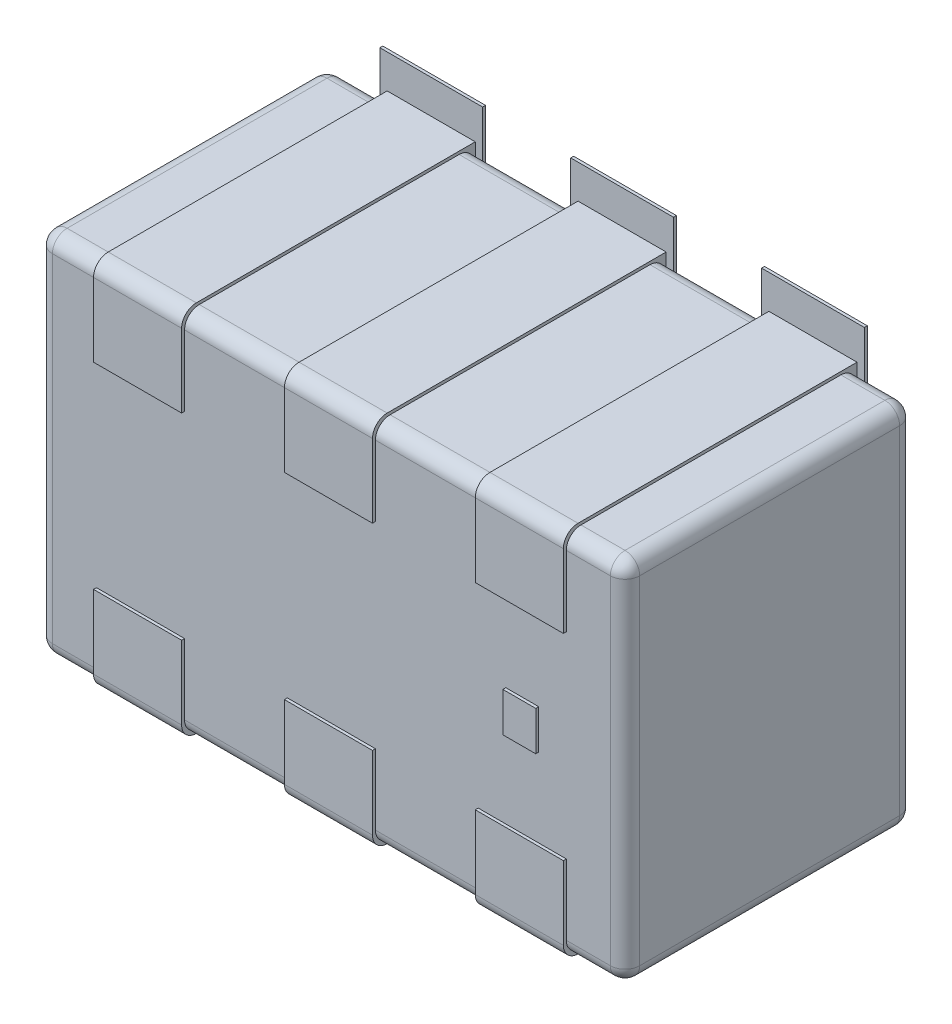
ISO-10303-21;
HEADER;
FILE_DESCRIPTION(('STEP AP214'),'2;1');
FILE_NAME('part.step','',(''),(''),'','','');
FILE_SCHEMA(('AUTOMOTIVE_DESIGN { 1 0 10303 214 1 1 1 1 }'));
ENDSEC;
DATA;
#1=APPLICATION_CONTEXT('core data for automotive mechanical design processes');
#2=APPLICATION_PROTOCOL_DEFINITION('international standard','automotive_design',2000,#1);
#3=PRODUCT_CONTEXT('',#1,'mechanical');
#4=PRODUCT('Part','Part','',(#3));
#5=PRODUCT_RELATED_PRODUCT_CATEGORY('part','',(#4));
#6=PRODUCT_DEFINITION_FORMATION('','',#4);
#7=PRODUCT_DEFINITION_CONTEXT('part definition',#1,'design');
#8=PRODUCT_DEFINITION('design','',#6,#7);
#9=PRODUCT_DEFINITION_SHAPE('','',#8);
#10=(LENGTH_UNIT() NAMED_UNIT(*) SI_UNIT(.MILLI.,.METRE.));
#11=(NAMED_UNIT(*) PLANE_ANGLE_UNIT() SI_UNIT($,.RADIAN.));
#12=(NAMED_UNIT(*) SI_UNIT($,.STERADIAN.) SOLID_ANGLE_UNIT());
#13=UNCERTAINTY_MEASURE_WITH_UNIT(LENGTH_MEASURE(1.E-05),#10,'distance_accuracy_value','');
#14=(GEOMETRIC_REPRESENTATION_CONTEXT(3) GLOBAL_UNCERTAINTY_ASSIGNED_CONTEXT((#13)) GLOBAL_UNIT_ASSIGNED_CONTEXT((#10,
#11,#12)) REPRESENTATION_CONTEXT('',''));
#15=CARTESIAN_POINT('',(0.,0.,0.));
#16=DIRECTION('',(0.,0.,1.));
#17=DIRECTION('',(1.,0.,0.));
#18=AXIS2_PLACEMENT_3D('',#15,#16,#17);
#19=CARTESIAN_POINT('',(0.95000000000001,0.574999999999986,2.40283139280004));
#20=DIRECTION('',(0.,0.,-1.));
#21=DIRECTION('',(-1.,0.,0.));
#22=AXIS2_PLACEMENT_3D('',#19,#20,#21);
#23=CYLINDRICAL_SURFACE('',#22,0.0500000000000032);
#24=CARTESIAN_POINT('',(0.95000000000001,0.574999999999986,1.02619799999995));
#25=DIRECTION('',(0.,0.,-1.));
#26=DIRECTION('',(-1.,0.,0.));
#27=AXIS2_PLACEMENT_3D('',#24,#25,#26);
#28=CIRCLE('',#27,0.0500000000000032);
#29=CARTESIAN_POINT('',(1.00000000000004,0.574999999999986,1.02619799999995));
#30=VERTEX_POINT('',#29);
#31=CARTESIAN_POINT('',(0.95000000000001,0.625000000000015,1.02619799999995));
#32=VERTEX_POINT('',#31);
#33=EDGE_CURVE('E107',#30,#32,#28,.F.);
#34=ORIENTED_EDGE('',*,*,#33,.F.);
#35=DIRECTION('',(0.,0.,-1.));
#36=VECTOR('',#35,1.);
#37=CARTESIAN_POINT('',(1.00000000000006,0.574999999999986,0.0762));
#38=LINE('',#37,#36);
#39=CARTESIAN_POINT('',(1.00000000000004,0.574999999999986,0.141199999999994));
#40=VERTEX_POINT('',#39);
#41=EDGE_CURVE('E104',#40,#30,#38,.F.);
#42=ORIENTED_EDGE('',*,*,#41,.F.);
#43=CARTESIAN_POINT('',(0.95000000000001,0.574999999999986,0.141199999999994));
#44=DIRECTION('',(0.,0.,-1.));
#45=DIRECTION('',(-1.,0.,0.));
#46=AXIS2_PLACEMENT_3D('',#43,#44,#45);
#47=CIRCLE('',#46,0.0500000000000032);
#48=CARTESIAN_POINT('',(0.95000000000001,0.625000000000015,0.141199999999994));
#49=VERTEX_POINT('',#48);
#50=EDGE_CURVE('E19',#49,#40,#47,.T.);
#51=ORIENTED_EDGE('',*,*,#50,.F.);
#52=DIRECTION('',(0.,0.,1.));
#53=VECTOR('',#52,1.);
#54=CARTESIAN_POINT('',(0.95000000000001,0.62500000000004,0.0762));
#55=LINE('',#54,#53);
#56=EDGE_CURVE('E375',#32,#49,#55,.F.);
#57=ORIENTED_EDGE('',*,*,#56,.F.);
#58=EDGE_LOOP('',(#34,#42,#51,#57));
#59=FACE_BOUND('',#58,.T.);
#60=ADVANCED_FACE('F16',(#59),#23,.T.);
#61=CARTESIAN_POINT('',(0.95000000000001,0.574999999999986,0.141199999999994));
#62=DIRECTION('',(0.,0.707106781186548,-0.707106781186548));
#63=DIRECTION('',(1.,0.,0.));
#64=AXIS2_PLACEMENT_3D('',#61,#62,#63);
#65=SPHERICAL_SURFACE('',#64,0.0500000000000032);
#66=ORIENTED_EDGE('',*,*,#50,.T.);
#67=CARTESIAN_POINT('',(0.95000000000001,0.574999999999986,0.141199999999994));
#68=DIRECTION('',(0.,1.,0.));
#69=DIRECTION('',(0.,0.,1.));
#70=AXIS2_PLACEMENT_3D('',#67,#68,#69);
#71=CIRCLE('',#70,0.0500000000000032);
#72=CARTESIAN_POINT('',(0.95000000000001,0.574999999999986,0.0911999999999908));
#73=VERTEX_POINT('',#72);
#74=EDGE_CURVE('E87',#73,#40,#71,.F.);
#75=ORIENTED_EDGE('',*,*,#74,.F.);
#76=CARTESIAN_POINT('',(0.95000000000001,0.574999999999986,0.141199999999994));
#77=DIRECTION('',(-1.,0.,0.));
#78=DIRECTION('',(0.,0.,1.));
#79=AXIS2_PLACEMENT_3D('',#76,#77,#78);
#80=CIRCLE('',#79,0.0500000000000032);
#81=CARTESIAN_POINT('',(0.95000000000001,0.610355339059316,0.105844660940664));
#82=VERTEX_POINT('',#81);
#83=EDGE_CURVE('E339',#82,#73,#80,.T.);
#84=ORIENTED_EDGE('',*,*,#83,.F.);
#85=CARTESIAN_POINT('',(0.95000000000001,0.574999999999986,0.141199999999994));
#86=DIRECTION('',(-1.,0.,0.));
#87=DIRECTION('',(0.,0.,1.));
#88=AXIS2_PLACEMENT_3D('',#85,#86,#87);
#89=CIRCLE('',#88,0.0500000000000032);
#90=EDGE_CURVE('E90',#49,#82,#89,.T.);
#91=ORIENTED_EDGE('',*,*,#90,.F.);
#92=EDGE_LOOP('',(#66,#75,#84,#91));
#93=FACE_BOUND('',#92,.T.);
#94=ADVANCED_FACE('F86',(#93),#65,.T.);
#95=CARTESIAN_POINT('',(0.95000000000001,-3.527971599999,0.141199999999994));
#96=DIRECTION('',(0.,1.,0.));
#97=DIRECTION('',(0.,0.,1.));
#98=AXIS2_PLACEMENT_3D('',#95,#96,#97);
#99=CYLINDRICAL_SURFACE('',#98,0.0500000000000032);
#100=ORIENTED_EDGE('',*,*,#74,.T.);
#101=DIRECTION('',(0.,1.,0.));
#102=VECTOR('',#101,1.);
#103=CARTESIAN_POINT('',(1.00000000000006,-0.62500000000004,0.141199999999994));
#104=LINE('',#103,#102);
#105=CARTESIAN_POINT('',(1.00000000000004,-0.574999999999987,0.141199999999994));
#106=VERTEX_POINT('',#105);
#107=EDGE_CURVE('E96',#106,#40,#104,.T.);
#108=ORIENTED_EDGE('',*,*,#107,.F.);
#109=CARTESIAN_POINT('',(0.95000000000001,-0.574999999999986,0.141199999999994));
#110=DIRECTION('',(0.,-1.,0.));
#111=DIRECTION('',(0.707106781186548,0.,-0.707106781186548));
#112=AXIS2_PLACEMENT_3D('',#109,#110,#111);
#113=CIRCLE('',#112,0.0500000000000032);
#114=CARTESIAN_POINT('',(0.985355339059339,-0.574999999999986,0.105844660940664));
#115=VERTEX_POINT('',#114);
#116=EDGE_CURVE('E363',#115,#106,#113,.T.);
#117=ORIENTED_EDGE('',*,*,#116,.F.);
#118=CARTESIAN_POINT('',(0.95000000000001,-0.574999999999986,0.141199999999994));
#119=DIRECTION('',(0.,1.,0.));
#120=DIRECTION('',(0.,0.,1.));
#121=AXIS2_PLACEMENT_3D('',#118,#119,#120);
#122=CIRCLE('',#121,0.0500000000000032);
#123=CARTESIAN_POINT('',(0.95000000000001,-0.574999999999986,0.0911999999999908));
#124=VERTEX_POINT('',#123);
#125=EDGE_CURVE('E101',#124,#115,#122,.F.);
#126=ORIENTED_EDGE('',*,*,#125,.F.);
#127=DIRECTION('',(0.,1.,0.));
#128=VECTOR('',#127,1.);
#129=CARTESIAN_POINT('',(0.95000000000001,0.,0.0911999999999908));
#130=LINE('',#129,#128);
#131=EDGE_CURVE('E99',#73,#124,#130,.F.);
#132=ORIENTED_EDGE('',*,*,#131,.F.);
#133=EDGE_LOOP('',(#100,#108,#117,#126,#132));
#134=FACE_BOUND('',#133,.T.);
#135=ADVANCED_FACE('F94',(#134),#99,.T.);
#136=CARTESIAN_POINT('',(0.95000000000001,-0.574999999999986,0.141199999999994));
#137=DIRECTION('',(0.707106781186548,0.,-0.707106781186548));
#138=DIRECTION('',(0.,-1.,0.));
#139=AXIS2_PLACEMENT_3D('',#136,#137,#138);
#140=SPHERICAL_SURFACE('',#139,0.0500000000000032);
#141=ORIENTED_EDGE('',*,*,#116,.T.);
#142=CARTESIAN_POINT('',(0.95000000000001,-0.574999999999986,0.141199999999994));
#143=DIRECTION('',(0.,0.,-1.));
#144=DIRECTION('',(-1.,0.,0.));
#145=AXIS2_PLACEMENT_3D('',#142,#143,#144);
#146=CIRCLE('',#145,0.0500000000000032);
#147=CARTESIAN_POINT('',(0.95000000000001,-0.625000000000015,0.141199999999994));
#148=VERTEX_POINT('',#147);
#149=EDGE_CURVE('E359',#148,#106,#146,.F.);
#150=ORIENTED_EDGE('',*,*,#149,.F.);
#151=CARTESIAN_POINT('',(0.95000000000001,-0.574999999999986,0.141199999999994));
#152=DIRECTION('',(1.,0.,0.));
#153=DIRECTION('',(0.,0.,-1.));
#154=AXIS2_PLACEMENT_3D('',#151,#152,#153);
#155=CIRCLE('',#154,0.0500000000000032);
#156=EDGE_CURVE('E334',#124,#148,#155,.F.);
#157=ORIENTED_EDGE('',*,*,#156,.F.);
#158=ORIENTED_EDGE('',*,*,#125,.T.);
#159=EDGE_LOOP('',(#141,#150,#157,#158));
#160=FACE_BOUND('',#159,.T.);
#161=ADVANCED_FACE('F559',(#160),#140,.T.);
#162=CARTESIAN_POINT('',(0.95000000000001,-0.574999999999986,2.40283139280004));
#163=DIRECTION('',(0.,0.,-1.));
#164=DIRECTION('',(-1.,0.,0.));
#165=AXIS2_PLACEMENT_3D('',#162,#163,#164);
#166=CYLINDRICAL_SURFACE('',#165,0.0500000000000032);
#167=CARTESIAN_POINT('',(0.95000000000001,-0.574999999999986,1.02619799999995));
#168=DIRECTION('',(0.,0.,-1.));
#169=DIRECTION('',(-1.,0.,0.));
#170=AXIS2_PLACEMENT_3D('',#167,#168,#169);
#171=CIRCLE('',#170,0.0500000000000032);
#172=CARTESIAN_POINT('',(0.95000000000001,-0.625000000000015,1.02619799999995));
#173=VERTEX_POINT('',#172);
#174=CARTESIAN_POINT('',(0.985355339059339,-0.610355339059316,1.02619799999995));
#175=VERTEX_POINT('',#174);
#176=EDGE_CURVE('E343',#173,#175,#171,.F.);
#177=ORIENTED_EDGE('',*,*,#176,.F.);
#178=DIRECTION('',(0.,0.,-1.));
#179=VECTOR('',#178,1.);
#180=CARTESIAN_POINT('',(0.95000000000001,-0.62500000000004,0.0762));
#181=LINE('',#180,#179);
#182=EDGE_CURVE('E337',#148,#173,#181,.F.);
#183=ORIENTED_EDGE('',*,*,#182,.F.);
#184=ORIENTED_EDGE('',*,*,#149,.T.);
#185=DIRECTION('',(0.,0.,-1.));
#186=VECTOR('',#185,1.);
#187=CARTESIAN_POINT('',(1.00000000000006,-0.574999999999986,0.0762));
#188=LINE('',#187,#186);
#189=CARTESIAN_POINT('',(1.00000000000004,-0.574999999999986,1.02619799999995));
#190=VERTEX_POINT('',#189);
#191=EDGE_CURVE('E115',#190,#106,#188,.T.);
#192=ORIENTED_EDGE('',*,*,#191,.F.);
#193=CARTESIAN_POINT('',(0.95000000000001,-0.574999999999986,1.02619799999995));
#194=DIRECTION('',(0.,0.,1.));
#195=DIRECTION('',(0.707106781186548,-0.707106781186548,0.));
#196=AXIS2_PLACEMENT_3D('',#193,#194,#195);
#197=CIRCLE('',#196,0.0500000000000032);
#198=EDGE_CURVE('E117',#175,#190,#197,.T.);
#199=ORIENTED_EDGE('',*,*,#198,.F.);
#200=EDGE_LOOP('',(#177,#183,#184,#192,#199));
#201=FACE_BOUND('',#200,.T.);
#202=ADVANCED_FACE('F555',(#201),#166,.T.);
#203=CARTESIAN_POINT('',(0.825000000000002,0.399999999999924,0.0762));
#204=DIRECTION('',(1.,0.,0.));
#205=DIRECTION('',(0.,0.,-1.));
#206=AXIS2_PLACEMENT_3D('',#203,#204,#205);
#207=PLANE('',#206);
#208=DIRECTION('',(0.,0.,-1.));
#209=VECTOR('',#208,1.);
#210=CARTESIAN_POINT('',(0.825000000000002,0.399999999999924,0.0762));
#211=LINE('',#210,#209);
#212=CARTESIAN_POINT('',(0.825000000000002,0.399999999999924,0.0762));
#213=VERTEX_POINT('',#212);
#214=CARTESIAN_POINT('',(0.825000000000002,0.399999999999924,0.0862000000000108));
#215=VERTEX_POINT('',#214);
#216=EDGE_CURVE('E379',#213,#215,#211,.F.);
#217=ORIENTED_EDGE('',*,*,#216,.F.);
#218=DIRECTION('',(0.,1.,0.));
#219=VECTOR('',#218,1.);
#220=CARTESIAN_POINT('',(0.825000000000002,0.,0.0762));
#221=LINE('',#220,#219);
#222=CARTESIAN_POINT('',(0.825000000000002,0.750000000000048,0.0762));
#223=VERTEX_POINT('',#222);
#224=EDGE_CURVE('E412',#213,#223,#221,.T.);
#225=ORIENTED_EDGE('',*,*,#224,.T.);
#226=DIRECTION('',(0.,0.,1.));
#227=VECTOR('',#226,1.);
#228=CARTESIAN_POINT('',(0.825000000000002,0.750000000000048,0.0762));
#229=LINE('',#228,#227);
#230=CARTESIAN_POINT('',(0.825000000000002,0.750000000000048,0.0862000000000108));
#231=VERTEX_POINT('',#230);
#232=EDGE_CURVE('E362',#231,#223,#229,.F.);
#233=ORIENTED_EDGE('',*,*,#232,.F.);
#234=DIRECTION('',(0.,1.,0.));
#235=VECTOR('',#234,1.);
#236=CARTESIAN_POINT('',(0.825000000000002,0.,0.0862000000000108));
#237=LINE('',#236,#235);
#238=EDGE_CURVE('E395',#215,#231,#237,.T.);
#239=ORIENTED_EDGE('',*,*,#238,.F.);
#240=EDGE_LOOP('',(#217,#225,#233,#239));
#241=FACE_BOUND('',#240,.T.);
#242=ADVANCED_FACE('F551',(#241),#207,.T.);
#243=CARTESIAN_POINT('',(0.825000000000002,0.750000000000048,0.0762));
#244=DIRECTION('',(0.,1.,0.));
#245=DIRECTION('',(0.,0.,1.));
#246=AXIS2_PLACEMENT_3D('',#243,#244,#245);
#247=PLANE('',#246);
#248=ORIENTED_EDGE('',*,*,#232,.T.);
#249=DIRECTION('',(1.,0.,0.));
#250=VECTOR('',#249,1.);
#251=CARTESIAN_POINT('',(0.,0.750000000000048,0.0762));
#252=LINE('',#251,#250);
#253=CARTESIAN_POINT('',(0.474999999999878,0.750000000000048,0.0762));
#254=VERTEX_POINT('',#253);
#255=EDGE_CURVE('E2316',#223,#254,#252,.F.);
#256=ORIENTED_EDGE('',*,*,#255,.T.);
#257=DIRECTION('',(0.,0.,1.));
#258=VECTOR('',#257,1.);
#259=CARTESIAN_POINT('',(0.474999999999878,0.750000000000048,0.0762));
#260=LINE('',#259,#258);
#261=CARTESIAN_POINT('',(0.474999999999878,0.750000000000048,0.0862000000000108));
#262=VERTEX_POINT('',#261);
#263=EDGE_CURVE('E2319',#262,#254,#260,.F.);
#264=ORIENTED_EDGE('',*,*,#263,.F.);
#265=DIRECTION('',(1.,0.,0.));
#266=VECTOR('',#265,1.);
#267=CARTESIAN_POINT('',(0.,0.750000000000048,0.0862000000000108));
#268=LINE('',#267,#266);
#269=EDGE_CURVE('E2338',#231,#262,#268,.F.);
#270=ORIENTED_EDGE('',*,*,#269,.F.);
#271=EDGE_LOOP('',(#248,#256,#264,#270));
#272=FACE_BOUND('',#271,.T.);
#273=ADVANCED_FACE('F547',(#272),#247,.T.);
#274=CARTESIAN_POINT('',(0.474999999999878,0.750000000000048,0.0762));
#275=DIRECTION('',(-1.,0.,0.));
#276=DIRECTION('',(0.,0.,1.));
#277=AXIS2_PLACEMENT_3D('',#274,#275,#276);
#278=PLANE('',#277);
#279=ORIENTED_EDGE('',*,*,#263,.T.);
#280=DIRECTION('',(0.,1.,0.));
#281=VECTOR('',#280,1.);
#282=CARTESIAN_POINT('',(0.474999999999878,0.,0.0762));
#283=LINE('',#282,#281);
#284=CARTESIAN_POINT('',(0.474999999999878,0.399999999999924,0.0762));
#285=VERTEX_POINT('',#284);
#286=EDGE_CURVE('E1486',#254,#285,#283,.F.);
#287=ORIENTED_EDGE('',*,*,#286,.T.);
#288=DIRECTION('',(0.,0.,-1.));
#289=VECTOR('',#288,1.);
#290=CARTESIAN_POINT('',(0.474999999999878,0.399999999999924,0.0762));
#291=LINE('',#290,#289);
#292=CARTESIAN_POINT('',(0.474999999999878,0.399999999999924,0.0862000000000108));
#293=VERTEX_POINT('',#292);
#294=EDGE_CURVE('E413',#293,#285,#291,.T.);
#295=ORIENTED_EDGE('',*,*,#294,.F.);
#296=DIRECTION('',(0.,1.,0.));
#297=VECTOR('',#296,1.);
#298=CARTESIAN_POINT('',(0.474999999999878,0.,0.0862000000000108));
#299=LINE('',#298,#297);
#300=EDGE_CURVE('E1504',#262,#293,#299,.F.);
#301=ORIENTED_EDGE('',*,*,#300,.F.);
#302=EDGE_LOOP('',(#279,#287,#295,#301));
#303=FACE_BOUND('',#302,.T.);
#304=ADVANCED_FACE('F543',(#303),#278,.T.);
#305=CARTESIAN_POINT('',(0.474999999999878,-0.399999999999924,0.0762));
#306=DIRECTION('',(-1.,0.,0.));
#307=DIRECTION('',(0.,0.,1.));
#308=AXIS2_PLACEMENT_3D('',#305,#306,#307);
#309=PLANE('',#308);
#310=DIRECTION('',(0.,0.,1.));
#311=VECTOR('',#310,1.);
#312=CARTESIAN_POINT('',(0.474999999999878,-0.399999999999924,0.0762));
#313=LINE('',#312,#311);
#314=CARTESIAN_POINT('',(0.474999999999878,-0.399999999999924,0.0762));
#315=VERTEX_POINT('',#314);
#316=CARTESIAN_POINT('',(0.474999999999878,-0.399999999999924,0.0862000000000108));
#317=VERTEX_POINT('',#316);
#318=EDGE_CURVE('E1444',#315,#317,#313,.T.);
#319=ORIENTED_EDGE('',*,*,#318,.F.);
#320=DIRECTION('',(0.,1.,0.));
#321=VECTOR('',#320,1.);
#322=CARTESIAN_POINT('',(0.474999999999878,0.,0.0762));
#323=LINE('',#322,#321);
#324=CARTESIAN_POINT('',(0.474999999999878,-0.750000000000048,0.0762));
#325=VERTEX_POINT('',#324);
#326=EDGE_CURVE('E1485',#315,#325,#323,.F.);
#327=ORIENTED_EDGE('',*,*,#326,.T.);
#328=DIRECTION('',(0.,0.,-1.));
#329=VECTOR('',#328,1.);
#330=CARTESIAN_POINT('',(0.474999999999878,-0.750000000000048,0.0762));
#331=LINE('',#330,#329);
#332=CARTESIAN_POINT('',(0.474999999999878,-0.750000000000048,0.0862000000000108));
#333=VERTEX_POINT('',#332);
#334=EDGE_CURVE('E1455',#333,#325,#331,.T.);
#335=ORIENTED_EDGE('',*,*,#334,.F.);
#336=DIRECTION('',(0.,1.,0.));
#337=VECTOR('',#336,1.);
#338=CARTESIAN_POINT('',(0.474999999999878,0.,0.0862000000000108));
#339=LINE('',#338,#337);
#340=EDGE_CURVE('E1453',#317,#333,#339,.F.);
#341=ORIENTED_EDGE('',*,*,#340,.F.);
#342=EDGE_LOOP('',(#319,#327,#335,#341));
#343=FACE_BOUND('',#342,.T.);
#344=ADVANCED_FACE('F539',(#343),#309,.T.);
#345=CARTESIAN_POINT('',(0.474999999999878,-0.750000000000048,0.0762));
#346=DIRECTION('',(0.,-1.,0.));
#347=DIRECTION('',(0.,0.,-1.));
#348=AXIS2_PLACEMENT_3D('',#345,#346,#347);
#349=PLANE('',#348);
#350=ORIENTED_EDGE('',*,*,#334,.T.);
#351=DIRECTION('',(1.,0.,0.));
#352=VECTOR('',#351,1.);
#353=CARTESIAN_POINT('',(0.,-0.750000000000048,0.0762));
#354=LINE('',#353,#352);
#355=CARTESIAN_POINT('',(0.825000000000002,-0.750000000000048,0.0762));
#356=VERTEX_POINT('',#355);
#357=EDGE_CURVE('E2299',#325,#356,#354,.T.);
#358=ORIENTED_EDGE('',*,*,#357,.T.);
#359=DIRECTION('',(0.,0.,-1.));
#360=VECTOR('',#359,1.);
#361=CARTESIAN_POINT('',(0.825000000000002,-0.750000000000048,0.0762));
#362=LINE('',#361,#360);
#363=CARTESIAN_POINT('',(0.825000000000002,-0.750000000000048,0.0862000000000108));
#364=VERTEX_POINT('',#363);
#365=EDGE_CURVE('E358',#364,#356,#362,.T.);
#366=ORIENTED_EDGE('',*,*,#365,.F.);
#367=DIRECTION('',(1.,0.,0.));
#368=VECTOR('',#367,1.);
#369=CARTESIAN_POINT('',(0.,-0.750000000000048,0.0862000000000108));
#370=LINE('',#369,#368);
#371=EDGE_CURVE('E1458',#333,#364,#370,.T.);
#372=ORIENTED_EDGE('',*,*,#371,.F.);
#373=EDGE_LOOP('',(#350,#358,#366,#372));
#374=FACE_BOUND('',#373,.T.);
#375=ADVANCED_FACE('F535',(#374),#349,.T.);
#376=CARTESIAN_POINT('',(0.825000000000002,-0.750000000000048,0.0762));
#377=DIRECTION('',(1.,0.,0.));
#378=DIRECTION('',(0.,0.,-1.));
#379=AXIS2_PLACEMENT_3D('',#376,#377,#378);
#380=PLANE('',#379);
#381=ORIENTED_EDGE('',*,*,#365,.T.);
#382=DIRECTION('',(0.,1.,0.));
#383=VECTOR('',#382,1.);
#384=CARTESIAN_POINT('',(0.825000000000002,0.,0.0762));
#385=LINE('',#384,#383);
#386=CARTESIAN_POINT('',(0.825000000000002,-0.399999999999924,0.0762));
#387=VERTEX_POINT('',#386);
#388=EDGE_CURVE('E420',#356,#387,#385,.T.);
#389=ORIENTED_EDGE('',*,*,#388,.T.);
#390=DIRECTION('',(0.,0.,1.));
#391=VECTOR('',#390,1.);
#392=CARTESIAN_POINT('',(0.825000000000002,-0.399999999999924,0.0762));
#393=LINE('',#392,#391);
#394=CARTESIAN_POINT('',(0.825000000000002,-0.399999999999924,0.0862000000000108));
#395=VERTEX_POINT('',#394);
#396=EDGE_CURVE('E342',#395,#387,#393,.F.);
#397=ORIENTED_EDGE('',*,*,#396,.F.);
#398=DIRECTION('',(0.,1.,0.));
#399=VECTOR('',#398,1.);
#400=CARTESIAN_POINT('',(0.825000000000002,0.,0.0862000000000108));
#401=LINE('',#400,#399);
#402=EDGE_CURVE('E436',#364,#395,#401,.T.);
#403=ORIENTED_EDGE('',*,*,#402,.F.);
#404=EDGE_LOOP('',(#381,#389,#397,#403));
#405=FACE_BOUND('',#404,.T.);
#406=ADVANCED_FACE('F532',(#405),#380,.T.);
#407=CARTESIAN_POINT('',(-0.95000000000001,0.574999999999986,0.141199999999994));
#408=DIRECTION('',(-0.707106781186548,0.,-0.707106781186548));
#409=DIRECTION('',(0.,1.,0.));
#410=AXIS2_PLACEMENT_3D('',#407,#408,#409);
#411=SPHERICAL_SURFACE('',#410,0.0500000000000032);
#412=CARTESIAN_POINT('',(-0.95000000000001,0.574999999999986,0.141199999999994));
#413=DIRECTION('',(0.,-1.,0.));
#414=DIRECTION('',(0.,0.,-1.));
#415=AXIS2_PLACEMENT_3D('',#412,#413,#414);
#416=CIRCLE('',#415,0.0500000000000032);
#417=CARTESIAN_POINT('',(-1.00000000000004,0.574999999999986,0.141199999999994));
#418=VERTEX_POINT('',#417);
#419=CARTESIAN_POINT('',(-0.985355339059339,0.574999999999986,0.105844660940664));
#420=VERTEX_POINT('',#419);
#421=EDGE_CURVE('E349',#418,#420,#416,.T.);
#422=ORIENTED_EDGE('',*,*,#421,.F.);
#423=CARTESIAN_POINT('',(-0.95000000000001,0.574999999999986,0.141199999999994));
#424=DIRECTION('',(0.,0.,-1.));
#425=DIRECTION('',(-1.,0.,0.));
#426=AXIS2_PLACEMENT_3D('',#423,#424,#425);
#427=CIRCLE('',#426,0.0500000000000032);
#428=CARTESIAN_POINT('',(-0.95000000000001,0.625000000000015,0.141199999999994));
#429=VERTEX_POINT('',#428);
#430=EDGE_CURVE('E355',#429,#418,#427,.F.);
#431=ORIENTED_EDGE('',*,*,#430,.F.);
#432=CARTESIAN_POINT('',(-0.95000000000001,0.574999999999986,0.141199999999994));
#433=DIRECTION('',(-1.,0.,0.));
#434=DIRECTION('',(0.,0.,1.));
#435=AXIS2_PLACEMENT_3D('',#432,#433,#434);
#436=CIRCLE('',#435,0.0500000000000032);
#437=CARTESIAN_POINT('',(-0.95000000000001,0.574999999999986,0.0911999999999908));
#438=VERTEX_POINT('',#437);
#439=EDGE_CURVE('E321',#438,#429,#436,.F.);
#440=ORIENTED_EDGE('',*,*,#439,.F.);
#441=CARTESIAN_POINT('',(-0.95000000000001,0.574999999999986,0.141199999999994));
#442=DIRECTION('',(0.,-1.,0.));
#443=DIRECTION('',(0.,0.,-1.));
#444=AXIS2_PLACEMENT_3D('',#441,#442,#443);
#445=CIRCLE('',#444,0.0500000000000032);
#446=EDGE_CURVE('E34',#420,#438,#445,.T.);
#447=ORIENTED_EDGE('',*,*,#446,.F.);
#448=EDGE_LOOP('',(#422,#431,#440,#447));
#449=FACE_BOUND('',#448,.T.);
#450=ADVANCED_FACE('F528',(#449),#411,.T.);
#451=CARTESIAN_POINT('',(-0.95000000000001,0.574999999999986,2.40283139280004));
#452=DIRECTION('',(0.,0.,-1.));
#453=DIRECTION('',(-1.,0.,0.));
#454=AXIS2_PLACEMENT_3D('',#451,#452,#453);
#455=CYLINDRICAL_SURFACE('',#454,0.0500000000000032);
#456=CARTESIAN_POINT('',(-0.95000000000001,0.574999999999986,1.02619799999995));
#457=DIRECTION('',(0.,0.,-1.));
#458=DIRECTION('',(-1.,0.,0.));
#459=AXIS2_PLACEMENT_3D('',#456,#457,#458);
#460=CIRCLE('',#459,0.0500000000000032);
#461=CARTESIAN_POINT('',(-0.95000000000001,0.625000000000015,1.02619799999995));
#462=VERTEX_POINT('',#461);
#463=CARTESIAN_POINT('',(-1.00000000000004,0.574999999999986,1.02619799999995));
#464=VERTEX_POINT('',#463);
#465=EDGE_CURVE('E329',#462,#464,#460,.F.);
#466=ORIENTED_EDGE('',*,*,#465,.F.);
#467=DIRECTION('',(0.,0.,1.));
#468=VECTOR('',#467,1.);
#469=CARTESIAN_POINT('',(-0.95000000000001,0.62500000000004,0.0762));
#470=LINE('',#469,#468);
#471=EDGE_CURVE('E324',#429,#462,#470,.T.);
#472=ORIENTED_EDGE('',*,*,#471,.F.);
#473=ORIENTED_EDGE('',*,*,#430,.T.);
#474=DIRECTION('',(0.,0.,1.));
#475=VECTOR('',#474,1.);
#476=CARTESIAN_POINT('',(-1.00000000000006,0.574999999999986,0.0762));
#477=LINE('',#476,#475);
#478=EDGE_CURVE('E332',#464,#418,#477,.F.);
#479=ORIENTED_EDGE('',*,*,#478,.F.);
#480=EDGE_LOOP('',(#466,#472,#473,#479));
#481=FACE_BOUND('',#480,.T.);
#482=ADVANCED_FACE('F531',(#481),#455,.T.);
#483=CARTESIAN_POINT('',(-0.95000000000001,-0.574999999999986,2.40283139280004));
#484=DIRECTION('',(0.,0.,-1.));
#485=DIRECTION('',(-1.,0.,0.));
#486=AXIS2_PLACEMENT_3D('',#483,#484,#485);
#487=CYLINDRICAL_SURFACE('',#486,0.0500000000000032);
#488=CARTESIAN_POINT('',(-0.95000000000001,-0.574999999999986,1.02619799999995));
#489=DIRECTION('',(0.,0.,-1.));
#490=DIRECTION('',(-1.,0.,0.));
#491=AXIS2_PLACEMENT_3D('',#488,#489,#490);
#492=CIRCLE('',#491,0.0500000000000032);
#493=CARTESIAN_POINT('',(-1.00000000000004,-0.574999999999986,1.02619799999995));
#494=VERTEX_POINT('',#493);
#495=CARTESIAN_POINT('',(-0.95000000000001,-0.625000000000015,1.02619799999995));
#496=VERTEX_POINT('',#495);
#497=EDGE_CURVE('E325',#494,#496,#492,.F.);
#498=ORIENTED_EDGE('',*,*,#497,.F.);
#499=DIRECTION('',(0.,0.,1.));
#500=VECTOR('',#499,1.);
#501=CARTESIAN_POINT('',(-1.00000000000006,-0.574999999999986,0.0762));
#502=LINE('',#501,#500);
#503=CARTESIAN_POINT('',(-1.00000000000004,-0.574999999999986,0.141199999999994));
#504=VERTEX_POINT('',#503);
#505=EDGE_CURVE('E328',#504,#494,#502,.T.);
#506=ORIENTED_EDGE('',*,*,#505,.F.);
#507=CARTESIAN_POINT('',(-0.95000000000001,-0.574999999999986,0.141199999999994));
#508=DIRECTION('',(0.,0.,-1.));
#509=DIRECTION('',(-1.,0.,0.));
#510=AXIS2_PLACEMENT_3D('',#507,#508,#509);
#511=CIRCLE('',#510,0.0500000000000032);
#512=CARTESIAN_POINT('',(-0.95000000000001,-0.625000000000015,0.141199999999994));
#513=VERTEX_POINT('',#512);
#514=EDGE_CURVE('E353',#513,#504,#511,.T.);
#515=ORIENTED_EDGE('',*,*,#514,.F.);
#516=DIRECTION('',(0.,0.,-1.));
#517=VECTOR('',#516,1.);
#518=CARTESIAN_POINT('',(-0.95000000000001,-0.62500000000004,0.0762));
#519=LINE('',#518,#517);
#520=EDGE_CURVE('E860',#496,#513,#519,.T.);
#521=ORIENTED_EDGE('',*,*,#520,.F.);
#522=EDGE_LOOP('',(#498,#506,#515,#521));
#523=FACE_BOUND('',#522,.T.);
#524=ADVANCED_FACE('F516',(#523),#487,.T.);
#525=CARTESIAN_POINT('',(-0.95000000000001,-0.574999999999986,0.141199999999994));
#526=DIRECTION('',(0.,-0.707106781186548,-0.707106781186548));
#527=DIRECTION('',(-1.,0.,0.));
#528=AXIS2_PLACEMENT_3D('',#525,#526,#527);
#529=SPHERICAL_SURFACE('',#528,0.0500000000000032);
#530=ORIENTED_EDGE('',*,*,#514,.T.);
#531=CARTESIAN_POINT('',(-0.95000000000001,-0.574999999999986,0.141199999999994));
#532=DIRECTION('',(0.,-1.,0.));
#533=DIRECTION('',(0.,0.,-1.));
#534=AXIS2_PLACEMENT_3D('',#531,#532,#533);
#535=CIRCLE('',#534,0.0500000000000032);
#536=CARTESIAN_POINT('',(-0.95000000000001,-0.574999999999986,0.0911999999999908));
#537=VERTEX_POINT('',#536);
#538=EDGE_CURVE('E350',#537,#504,#535,.F.);
#539=ORIENTED_EDGE('',*,*,#538,.F.);
#540=CARTESIAN_POINT('',(-0.95000000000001,-0.574999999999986,0.141199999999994));
#541=DIRECTION('',(1.,0.,0.));
#542=DIRECTION('',(0.,0.,-1.));
#543=AXIS2_PLACEMENT_3D('',#540,#541,#542);
#544=CIRCLE('',#543,0.0500000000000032);
#545=CARTESIAN_POINT('',(-0.95000000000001,-0.610355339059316,0.105844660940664));
#546=VERTEX_POINT('',#545);
#547=EDGE_CURVE('E316',#546,#537,#544,.T.);
#548=ORIENTED_EDGE('',*,*,#547,.F.);
#549=CARTESIAN_POINT('',(-0.95000000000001,-0.574999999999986,0.141199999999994));
#550=DIRECTION('',(1.,0.,0.));
#551=DIRECTION('',(0.,0.,-1.));
#552=AXIS2_PLACEMENT_3D('',#549,#550,#551);
#553=CIRCLE('',#552,0.0500000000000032);
#554=EDGE_CURVE('E320',#513,#546,#553,.T.);
#555=ORIENTED_EDGE('',*,*,#554,.F.);
#556=EDGE_LOOP('',(#530,#539,#548,#555));
#557=FACE_BOUND('',#556,.T.);
#558=ADVANCED_FACE('F511',(#557),#529,.T.);
#559=CARTESIAN_POINT('',(-0.95000000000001,4.15897160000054,0.141199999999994));
#560=DIRECTION('',(0.,-1.,0.));
#561=DIRECTION('',(0.,0.,-1.));
#562=AXIS2_PLACEMENT_3D('',#559,#560,#561);
#563=CYLINDRICAL_SURFACE('',#562,0.0500000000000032);
#564=ORIENTED_EDGE('',*,*,#446,.T.);
#565=DIRECTION('',(0.,1.,0.));
#566=VECTOR('',#565,1.);
#567=CARTESIAN_POINT('',(-0.95000000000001,0.,0.0911999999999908));
#568=LINE('',#567,#566);
#569=EDGE_CURVE('E319',#537,#438,#568,.T.);
#570=ORIENTED_EDGE('',*,*,#569,.F.);
#571=ORIENTED_EDGE('',*,*,#538,.T.);
#572=DIRECTION('',(0.,1.,0.));
#573=VECTOR('',#572,1.);
#574=CARTESIAN_POINT('',(-1.00000000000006,0.62500000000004,0.141199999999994));
#575=LINE('',#574,#573);
#576=EDGE_CURVE('E525',#418,#504,#575,.F.);
#577=ORIENTED_EDGE('',*,*,#576,.F.);
#578=ORIENTED_EDGE('',*,*,#421,.T.);
#579=EDGE_LOOP('',(#564,#570,#571,#577,#578));
#580=FACE_BOUND('',#579,.T.);
#581=ADVANCED_FACE('F507',(#580),#563,.T.);
#582=CARTESIAN_POINT('',(-0.825000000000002,-0.399999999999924,0.0762));
#583=DIRECTION('',(-1.,0.,0.));
#584=DIRECTION('',(0.,0.,1.));
#585=AXIS2_PLACEMENT_3D('',#582,#583,#584);
#586=PLANE('',#585);
#587=DIRECTION('',(0.,0.,1.));
#588=VECTOR('',#587,1.);
#589=CARTESIAN_POINT('',(-0.825000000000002,-0.399999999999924,0.0762));
#590=LINE('',#589,#588);
#591=CARTESIAN_POINT('',(-0.825000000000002,-0.399999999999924,0.0762));
#592=VERTEX_POINT('',#591);
#593=CARTESIAN_POINT('',(-0.825000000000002,-0.399999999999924,0.0862000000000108));
#594=VERTEX_POINT('',#593);
#595=EDGE_CURVE('E1876',#592,#594,#590,.T.);
#596=ORIENTED_EDGE('',*,*,#595,.F.);
#597=DIRECTION('',(0.,1.,0.));
#598=VECTOR('',#597,1.);
#599=CARTESIAN_POINT('',(-0.825000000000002,0.,0.0762));
#600=LINE('',#599,#598);
#601=CARTESIAN_POINT('',(-0.825000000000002,-0.750000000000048,0.0762));
#602=VERTEX_POINT('',#601);
#603=EDGE_CURVE('E1848',#592,#602,#600,.F.);
#604=ORIENTED_EDGE('',*,*,#603,.T.);
#605=DIRECTION('',(0.,0.,-1.));
#606=VECTOR('',#605,1.);
#607=CARTESIAN_POINT('',(-0.825000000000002,-0.750000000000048,0.0762));
#608=LINE('',#607,#606);
#609=CARTESIAN_POINT('',(-0.825000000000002,-0.750000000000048,0.0862000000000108));
#610=VERTEX_POINT('',#609);
#611=EDGE_CURVE('E348',#610,#602,#608,.T.);
#612=ORIENTED_EDGE('',*,*,#611,.F.);
#613=DIRECTION('',(0.,1.,0.));
#614=VECTOR('',#613,1.);
#615=CARTESIAN_POINT('',(-0.825000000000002,0.,0.0862000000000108));
#616=LINE('',#615,#614);
#617=EDGE_CURVE('E1832',#594,#610,#616,.F.);
#618=ORIENTED_EDGE('',*,*,#617,.F.);
#619=EDGE_LOOP('',(#596,#604,#612,#618));
#620=FACE_BOUND('',#619,.T.);
#621=ADVANCED_FACE('F503',(#620),#586,.T.);
#622=CARTESIAN_POINT('',(-0.825000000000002,-0.750000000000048,0.0762));
#623=DIRECTION('',(0.,-1.,0.));
#624=DIRECTION('',(0.,0.,-1.));
#625=AXIS2_PLACEMENT_3D('',#622,#623,#624);
#626=PLANE('',#625);
#627=ORIENTED_EDGE('',*,*,#611,.T.);
#628=DIRECTION('',(1.,0.,0.));
#629=VECTOR('',#628,1.);
#630=CARTESIAN_POINT('',(0.,-0.750000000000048,0.0762));
#631=LINE('',#630,#629);
#632=CARTESIAN_POINT('',(-0.474999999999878,-0.750000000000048,0.0762));
#633=VERTEX_POINT('',#632);
#634=EDGE_CURVE('E2115',#602,#633,#631,.T.);
#635=ORIENTED_EDGE('',*,*,#634,.T.);
#636=DIRECTION('',(0.,0.,-1.));
#637=VECTOR('',#636,1.);
#638=CARTESIAN_POINT('',(-0.474999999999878,-0.750000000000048,0.0762));
#639=LINE('',#638,#637);
#640=CARTESIAN_POINT('',(-0.474999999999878,-0.750000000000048,0.0862000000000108));
#641=VERTEX_POINT('',#640);
#642=EDGE_CURVE('E2095',#641,#633,#639,.T.);
#643=ORIENTED_EDGE('',*,*,#642,.F.);
#644=DIRECTION('',(1.,0.,0.));
#645=VECTOR('',#644,1.);
#646=CARTESIAN_POINT('',(0.,-0.750000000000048,0.0862000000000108));
#647=LINE('',#646,#645);
#648=EDGE_CURVE('E2142',#610,#641,#647,.T.);
#649=ORIENTED_EDGE('',*,*,#648,.F.);
#650=EDGE_LOOP('',(#627,#635,#643,#649));
#651=FACE_BOUND('',#650,.T.);
#652=ADVANCED_FACE('F499',(#651),#626,.T.);
#653=CARTESIAN_POINT('',(-0.474999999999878,-0.750000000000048,0.0762));
#654=DIRECTION('',(1.,0.,0.));
#655=DIRECTION('',(0.,0.,-1.));
#656=AXIS2_PLACEMENT_3D('',#653,#654,#655);
#657=PLANE('',#656);
#658=ORIENTED_EDGE('',*,*,#642,.T.);
#659=DIRECTION('',(0.,1.,0.));
#660=VECTOR('',#659,1.);
#661=CARTESIAN_POINT('',(-0.474999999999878,0.,0.0762));
#662=LINE('',#661,#660);
#663=CARTESIAN_POINT('',(-0.474999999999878,-0.399999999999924,0.0762));
#664=VERTEX_POINT('',#663);
#665=EDGE_CURVE('E1781',#633,#664,#662,.T.);
#666=ORIENTED_EDGE('',*,*,#665,.T.);
#667=DIRECTION('',(0.,0.,1.));
#668=VECTOR('',#667,1.);
#669=CARTESIAN_POINT('',(-0.474999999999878,-0.399999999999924,0.0762));
#670=LINE('',#669,#668);
#671=CARTESIAN_POINT('',(-0.474999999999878,-0.399999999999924,0.0862000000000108));
#672=VERTEX_POINT('',#671);
#673=EDGE_CURVE('E1792',#672,#664,#670,.F.);
#674=ORIENTED_EDGE('',*,*,#673,.F.);
#675=DIRECTION('',(0.,1.,0.));
#676=VECTOR('',#675,1.);
#677=CARTESIAN_POINT('',(-0.474999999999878,0.,0.0862000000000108));
#678=LINE('',#677,#676);
#679=EDGE_CURVE('E1793',#641,#672,#678,.T.);
#680=ORIENTED_EDGE('',*,*,#679,.F.);
#681=EDGE_LOOP('',(#658,#666,#674,#680));
#682=FACE_BOUND('',#681,.T.);
#683=ADVANCED_FACE('F495',(#682),#657,.T.);
#684=CARTESIAN_POINT('',(-0.474999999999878,0.399999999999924,0.0762));
#685=DIRECTION('',(1.,0.,0.));
#686=DIRECTION('',(0.,0.,-1.));
#687=AXIS2_PLACEMENT_3D('',#684,#685,#686);
#688=PLANE('',#687);
#689=DIRECTION('',(0.,0.,-1.));
#690=VECTOR('',#689,1.);
#691=CARTESIAN_POINT('',(-0.474999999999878,0.399999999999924,0.0762));
#692=LINE('',#691,#690);
#693=CARTESIAN_POINT('',(-0.474999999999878,0.399999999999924,0.0762));
#694=VERTEX_POINT('',#693);
#695=CARTESIAN_POINT('',(-0.474999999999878,0.399999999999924,0.0862000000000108));
#696=VERTEX_POINT('',#695);
#697=EDGE_CURVE('E1761',#694,#696,#692,.F.);
#698=ORIENTED_EDGE('',*,*,#697,.F.);
#699=DIRECTION('',(0.,1.,0.));
#700=VECTOR('',#699,1.);
#701=CARTESIAN_POINT('',(-0.474999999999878,0.,0.0762));
#702=LINE('',#701,#700);
#703=CARTESIAN_POINT('',(-0.474999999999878,0.750000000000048,0.0762));
#704=VERTEX_POINT('',#703);
#705=EDGE_CURVE('E2105',#694,#704,#702,.T.);
#706=ORIENTED_EDGE('',*,*,#705,.T.);
#707=DIRECTION('',(0.,0.,1.));
#708=VECTOR('',#707,1.);
#709=CARTESIAN_POINT('',(-0.474999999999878,0.750000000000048,0.0762));
#710=LINE('',#709,#708);
#711=CARTESIAN_POINT('',(-0.474999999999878,0.750000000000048,0.0862000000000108));
#712=VERTEX_POINT('',#711);
#713=EDGE_CURVE('E2086',#712,#704,#710,.F.);
#714=ORIENTED_EDGE('',*,*,#713,.F.);
#715=DIRECTION('',(0.,1.,0.));
#716=VECTOR('',#715,1.);
#717=CARTESIAN_POINT('',(-0.474999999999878,0.,0.0862000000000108));
#718=LINE('',#717,#716);
#719=EDGE_CURVE('E1760',#696,#712,#718,.T.);
#720=ORIENTED_EDGE('',*,*,#719,.F.);
#721=EDGE_LOOP('',(#698,#706,#714,#720));
#722=FACE_BOUND('',#721,.T.);
#723=ADVANCED_FACE('F491',(#722),#688,.T.);
#724=CARTESIAN_POINT('',(-0.474999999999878,0.750000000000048,0.0762));
#725=DIRECTION('',(0.,1.,0.));
#726=DIRECTION('',(0.,0.,1.));
#727=AXIS2_PLACEMENT_3D('',#724,#725,#726);
#728=PLANE('',#727);
#729=ORIENTED_EDGE('',*,*,#713,.T.);
#730=DIRECTION('',(1.,0.,0.));
#731=VECTOR('',#730,1.);
#732=CARTESIAN_POINT('',(0.,0.750000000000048,0.0762));
#733=LINE('',#732,#731);
#734=CARTESIAN_POINT('',(-0.825000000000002,0.750000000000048,0.0762));
#735=VERTEX_POINT('',#734);
#736=EDGE_CURVE('E2107',#704,#735,#733,.F.);
#737=ORIENTED_EDGE('',*,*,#736,.T.);
#738=DIRECTION('',(0.,0.,1.));
#739=VECTOR('',#738,1.);
#740=CARTESIAN_POINT('',(-0.825000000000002,0.750000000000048,0.0762));
#741=LINE('',#740,#739);
#742=CARTESIAN_POINT('',(-0.825000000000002,0.750000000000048,0.0862000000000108));
#743=VERTEX_POINT('',#742);
#744=EDGE_CURVE('E2051',#743,#735,#741,.F.);
#745=ORIENTED_EDGE('',*,*,#744,.F.);
#746=DIRECTION('',(1.,0.,0.));
#747=VECTOR('',#746,1.);
#748=CARTESIAN_POINT('',(0.,0.750000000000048,0.0862000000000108));
#749=LINE('',#748,#747);
#750=EDGE_CURVE('E2081',#712,#743,#749,.F.);
#751=ORIENTED_EDGE('',*,*,#750,.F.);
#752=EDGE_LOOP('',(#729,#737,#745,#751));
#753=FACE_BOUND('',#752,.T.);
#754=ADVANCED_FACE('F487',(#753),#728,.T.);
#755=CARTESIAN_POINT('',(-0.825000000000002,0.750000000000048,0.0762));
#756=DIRECTION('',(-1.,0.,0.));
#757=DIRECTION('',(0.,0.,1.));
#758=AXIS2_PLACEMENT_3D('',#755,#756,#757);
#759=PLANE('',#758);
#760=ORIENTED_EDGE('',*,*,#744,.T.);
#761=DIRECTION('',(0.,1.,0.));
#762=VECTOR('',#761,1.);
#763=CARTESIAN_POINT('',(-0.825000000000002,0.,0.0762));
#764=LINE('',#763,#762);
#765=CARTESIAN_POINT('',(-0.825000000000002,0.399999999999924,0.0762));
#766=VERTEX_POINT('',#765);
#767=EDGE_CURVE('E1853',#735,#766,#764,.F.);
#768=ORIENTED_EDGE('',*,*,#767,.T.);
#769=DIRECTION('',(0.,0.,-1.));
#770=VECTOR('',#769,1.);
#771=CARTESIAN_POINT('',(-0.825000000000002,0.399999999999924,0.0762));
#772=LINE('',#771,#770);
#773=CARTESIAN_POINT('',(-0.825000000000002,0.399999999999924,0.0862000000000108));
#774=VERTEX_POINT('',#773);
#775=EDGE_CURVE('E1872',#774,#766,#772,.T.);
#776=ORIENTED_EDGE('',*,*,#775,.F.);
#777=DIRECTION('',(0.,1.,0.));
#778=VECTOR('',#777,1.);
#779=CARTESIAN_POINT('',(-0.825000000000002,0.,0.0862000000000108));
#780=LINE('',#779,#778);
#781=EDGE_CURVE('E1866',#743,#774,#780,.F.);
#782=ORIENTED_EDGE('',*,*,#781,.F.);
#783=EDGE_LOOP('',(#760,#768,#776,#782));
#784=FACE_BOUND('',#783,.T.);
#785=ADVANCED_FACE('F483',(#784),#759,.T.);
#786=CARTESIAN_POINT('',(-0.175000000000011,-0.399999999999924,0.0762));
#787=DIRECTION('',(-1.,0.,0.));
#788=DIRECTION('',(0.,0.,1.));
#789=AXIS2_PLACEMENT_3D('',#786,#787,#788);
#790=PLANE('',#789);
#791=DIRECTION('',(0.,0.,1.));
#792=VECTOR('',#791,1.);
#793=CARTESIAN_POINT('',(-0.175000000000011,-0.399999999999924,0.0762));
#794=LINE('',#793,#792);
#795=CARTESIAN_POINT('',(-0.175000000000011,-0.399999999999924,0.0762));
#796=VERTEX_POINT('',#795);
#797=CARTESIAN_POINT('',(-0.175000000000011,-0.399999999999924,0.0862000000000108));
#798=VERTEX_POINT('',#797);
#799=EDGE_CURVE('E1688',#796,#798,#794,.T.);
#800=ORIENTED_EDGE('',*,*,#799,.F.);
#801=DIRECTION('',(0.,1.,0.));
#802=VECTOR('',#801,1.);
#803=CARTESIAN_POINT('',(-0.175000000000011,0.,0.0762));
#804=LINE('',#803,#802);
#805=CARTESIAN_POINT('',(-0.175000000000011,-0.750000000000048,0.0762));
#806=VERTEX_POINT('',#805);
#807=EDGE_CURVE('E1715',#796,#806,#804,.F.);
#808=ORIENTED_EDGE('',*,*,#807,.T.);
#809=DIRECTION('',(0.,0.,-1.));
#810=VECTOR('',#809,1.);
#811=CARTESIAN_POINT('',(-0.175000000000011,-0.750000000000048,0.0762));
#812=LINE('',#811,#810);
#813=CARTESIAN_POINT('',(-0.175000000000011,-0.750000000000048,0.0862000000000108));
#814=VERTEX_POINT('',#813);
#815=EDGE_CURVE('E2043',#814,#806,#812,.T.);
#816=ORIENTED_EDGE('',*,*,#815,.F.);
#817=DIRECTION('',(0.,1.,0.));
#818=VECTOR('',#817,1.);
#819=CARTESIAN_POINT('',(-0.175000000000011,0.,0.0862000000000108));
#820=LINE('',#819,#818);
#821=EDGE_CURVE('E1699',#798,#814,#820,.F.);
#822=ORIENTED_EDGE('',*,*,#821,.F.);
#823=EDGE_LOOP('',(#800,#808,#816,#822));
#824=FACE_BOUND('',#823,.T.);
#825=ADVANCED_FACE('F479',(#824),#790,.T.);
#826=CARTESIAN_POINT('',(-0.175000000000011,-0.750000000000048,0.0762));
#827=DIRECTION('',(0.,-1.,0.));
#828=DIRECTION('',(0.,0.,-1.));
#829=AXIS2_PLACEMENT_3D('',#826,#827,#828);
#830=PLANE('',#829);
#831=ORIENTED_EDGE('',*,*,#815,.T.);
#832=DIRECTION('',(1.,0.,0.));
#833=VECTOR('',#832,1.);
#834=CARTESIAN_POINT('',(0.,-0.750000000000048,0.0762));
#835=LINE('',#834,#833);
#836=CARTESIAN_POINT('',(0.175000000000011,-0.750000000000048,0.0762));
#837=VERTEX_POINT('',#836);
#838=EDGE_CURVE('E2038',#806,#837,#835,.T.);
#839=ORIENTED_EDGE('',*,*,#838,.T.);
#840=DIRECTION('',(0.,0.,-1.));
#841=VECTOR('',#840,1.);
#842=CARTESIAN_POINT('',(0.175000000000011,-0.750000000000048,0.0762));
#843=LINE('',#842,#841);
#844=CARTESIAN_POINT('',(0.175000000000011,-0.750000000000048,0.0862000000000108));
#845=VERTEX_POINT('',#844);
#846=EDGE_CURVE('E2020',#845,#837,#843,.T.);
#847=ORIENTED_EDGE('',*,*,#846,.F.);
#848=DIRECTION('',(1.,0.,0.));
#849=VECTOR('',#848,1.);
#850=CARTESIAN_POINT('',(0.,-0.750000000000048,0.0862000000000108));
#851=LINE('',#850,#849);
#852=EDGE_CURVE('E2066',#814,#845,#851,.T.);
#853=ORIENTED_EDGE('',*,*,#852,.F.);
#854=EDGE_LOOP('',(#831,#839,#847,#853));
#855=FACE_BOUND('',#854,.T.);
#856=ADVANCED_FACE('F475',(#855),#830,.T.);
#857=CARTESIAN_POINT('',(0.175000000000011,-0.750000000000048,0.0762));
#858=DIRECTION('',(1.,0.,0.));
#859=DIRECTION('',(0.,0.,-1.));
#860=AXIS2_PLACEMENT_3D('',#857,#858,#859);
#861=PLANE('',#860);
#862=ORIENTED_EDGE('',*,*,#846,.T.);
#863=DIRECTION('',(0.,1.,0.));
#864=VECTOR('',#863,1.);
#865=CARTESIAN_POINT('',(0.175000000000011,0.,0.0762));
#866=LINE('',#865,#864);
#867=CARTESIAN_POINT('',(0.175000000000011,-0.399999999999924,0.0762));
#868=VERTEX_POINT('',#867);
#869=EDGE_CURVE('E1639',#837,#868,#866,.T.);
#870=ORIENTED_EDGE('',*,*,#869,.T.);
#871=DIRECTION('',(0.,0.,1.));
#872=VECTOR('',#871,1.);
#873=CARTESIAN_POINT('',(0.175000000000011,-0.399999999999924,0.0762));
#874=LINE('',#873,#872);
#875=CARTESIAN_POINT('',(0.175000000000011,-0.399999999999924,0.0862000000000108));
#876=VERTEX_POINT('',#875);
#877=EDGE_CURVE('E1650',#876,#868,#874,.F.);
#878=ORIENTED_EDGE('',*,*,#877,.F.);
#879=DIRECTION('',(0.,1.,0.));
#880=VECTOR('',#879,1.);
#881=CARTESIAN_POINT('',(0.175000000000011,0.,0.0862000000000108));
#882=LINE('',#881,#880);
#883=EDGE_CURVE('E1651',#845,#876,#882,.T.);
#884=ORIENTED_EDGE('',*,*,#883,.F.);
#885=EDGE_LOOP('',(#862,#870,#878,#884));
#886=FACE_BOUND('',#885,.T.);
#887=ADVANCED_FACE('F471',(#886),#861,.T.);
#888=CARTESIAN_POINT('',(0.175000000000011,0.399999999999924,0.0762));
#889=DIRECTION('',(1.,0.,0.));
#890=DIRECTION('',(0.,0.,-1.));
#891=AXIS2_PLACEMENT_3D('',#888,#889,#890);
#892=PLANE('',#891);
#893=DIRECTION('',(0.,0.,-1.));
#894=VECTOR('',#893,1.);
#895=CARTESIAN_POINT('',(0.175000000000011,0.399999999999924,0.0762));
#896=LINE('',#895,#894);
#897=CARTESIAN_POINT('',(0.175000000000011,0.399999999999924,0.0762));
#898=VERTEX_POINT('',#897);
#899=CARTESIAN_POINT('',(0.175000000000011,0.399999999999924,0.0862000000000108));
#900=VERTEX_POINT('',#899);
#901=EDGE_CURVE('E1618',#898,#900,#896,.F.);
#902=ORIENTED_EDGE('',*,*,#901,.F.);
#903=DIRECTION('',(0.,1.,0.));
#904=VECTOR('',#903,1.);
#905=CARTESIAN_POINT('',(0.175000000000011,0.,0.0762));
#906=LINE('',#905,#904);
#907=CARTESIAN_POINT('',(0.175000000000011,0.750000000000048,0.0762));
#908=VERTEX_POINT('',#907);
#909=EDGE_CURVE('E2029',#898,#908,#906,.T.);
#910=ORIENTED_EDGE('',*,*,#909,.T.);
#911=DIRECTION('',(0.,0.,1.));
#912=VECTOR('',#911,1.);
#913=CARTESIAN_POINT('',(0.175000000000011,0.750000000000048,0.0762));
#914=LINE('',#913,#912);
#915=CARTESIAN_POINT('',(0.175000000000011,0.750000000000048,0.0862000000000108));
#916=VERTEX_POINT('',#915);
#917=EDGE_CURVE('E2013',#916,#908,#914,.F.);
#918=ORIENTED_EDGE('',*,*,#917,.F.);
#919=DIRECTION('',(0.,1.,0.));
#920=VECTOR('',#919,1.);
#921=CARTESIAN_POINT('',(0.175000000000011,0.,0.0862000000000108));
#922=LINE('',#921,#920);
#923=EDGE_CURVE('E1617',#900,#916,#922,.T.);
#924=ORIENTED_EDGE('',*,*,#923,.F.);
#925=EDGE_LOOP('',(#902,#910,#918,#924));
#926=FACE_BOUND('',#925,.T.);
#927=ADVANCED_FACE('F467',(#926),#892,.T.);
#928=CARTESIAN_POINT('',(0.175000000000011,0.750000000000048,0.0762));
#929=DIRECTION('',(0.,1.,0.));
#930=DIRECTION('',(0.,0.,1.));
#931=AXIS2_PLACEMENT_3D('',#928,#929,#930);
#932=PLANE('',#931);
#933=ORIENTED_EDGE('',*,*,#917,.T.);
#934=DIRECTION('',(1.,0.,0.));
#935=VECTOR('',#934,1.);
#936=CARTESIAN_POINT('',(0.,0.750000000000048,0.0762));
#937=LINE('',#936,#935);
#938=CARTESIAN_POINT('',(-0.175000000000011,0.750000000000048,0.0762));
#939=VERTEX_POINT('',#938);
#940=EDGE_CURVE('E1987',#908,#939,#937,.F.);
#941=ORIENTED_EDGE('',*,*,#940,.T.);
#942=DIRECTION('',(0.,0.,1.));
#943=VECTOR('',#942,1.);
#944=CARTESIAN_POINT('',(-0.175000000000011,0.750000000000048,0.0762));
#945=LINE('',#944,#943);
#946=CARTESIAN_POINT('',(-0.175000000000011,0.750000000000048,0.0862000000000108));
#947=VERTEX_POINT('',#946);
#948=EDGE_CURVE('E346',#947,#939,#945,.F.);
#949=ORIENTED_EDGE('',*,*,#948,.F.);
#950=DIRECTION('',(1.,0.,0.));
#951=VECTOR('',#950,1.);
#952=CARTESIAN_POINT('',(0.,0.750000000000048,0.0862000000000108));
#953=LINE('',#952,#951);
#954=EDGE_CURVE('E2004',#916,#947,#953,.F.);
#955=ORIENTED_EDGE('',*,*,#954,.F.);
#956=EDGE_LOOP('',(#933,#941,#949,#955));
#957=FACE_BOUND('',#956,.T.);
#958=ADVANCED_FACE('F463',(#957),#932,.T.);
#959=CARTESIAN_POINT('',(-0.175000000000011,0.750000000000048,0.0762));
#960=DIRECTION('',(-1.,0.,0.));
#961=DIRECTION('',(0.,0.,1.));
#962=AXIS2_PLACEMENT_3D('',#959,#960,#961);
#963=PLANE('',#962);
#964=ORIENTED_EDGE('',*,*,#948,.T.);
#965=DIRECTION('',(0.,1.,0.));
#966=VECTOR('',#965,1.);
#967=CARTESIAN_POINT('',(-0.175000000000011,0.,0.0762));
#968=LINE('',#967,#966);
#969=CARTESIAN_POINT('',(-0.175000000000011,0.399999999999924,0.0762));
#970=VERTEX_POINT('',#969);
#971=EDGE_CURVE('E1721',#939,#970,#968,.F.);
#972=ORIENTED_EDGE('',*,*,#971,.T.);
#973=DIRECTION('',(0.,0.,-1.));
#974=VECTOR('',#973,1.);
#975=CARTESIAN_POINT('',(-0.175000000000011,0.399999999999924,0.0762));
#976=LINE('',#975,#974);
#977=CARTESIAN_POINT('',(-0.175000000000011,0.399999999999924,0.0862000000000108));
#978=VERTEX_POINT('',#977);
#979=EDGE_CURVE('E1381',#978,#970,#976,.T.);
#980=ORIENTED_EDGE('',*,*,#979,.F.);
#981=DIRECTION('',(0.,1.,0.));
#982=VECTOR('',#981,1.);
#983=CARTESIAN_POINT('',(-0.175000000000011,0.,0.0862000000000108));
#984=LINE('',#983,#982);
#985=EDGE_CURVE('E1735',#947,#978,#984,.F.);
#986=ORIENTED_EDGE('',*,*,#985,.F.);
#987=EDGE_LOOP('',(#964,#972,#980,#986));
#988=FACE_BOUND('',#987,.T.);
#989=ADVANCED_FACE('F459',(#988),#963,.T.);
#990=CARTESIAN_POINT('',(0.95000000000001,-0.574999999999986,1.02619799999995));
#991=DIRECTION('',(0.707106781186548,-0.707106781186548,0.));
#992=DIRECTION('',(0.,0.,1.));
#993=AXIS2_PLACEMENT_3D('',#990,#991,#992);
#994=SPHERICAL_SURFACE('',#993,0.0500000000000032);
#995=CARTESIAN_POINT('',(0.95000000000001,-0.574999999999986,1.02619799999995));
#996=DIRECTION('',(0.,1.,0.));
#997=DIRECTION('',(0.,0.,1.));
#998=AXIS2_PLACEMENT_3D('',#995,#996,#997);
#999=CIRCLE('',#998,0.0500000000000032);
#1000=CARTESIAN_POINT('',(0.95000000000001,-0.574999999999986,1.07619799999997));
#1001=VERTEX_POINT('',#1000);
#1002=EDGE_CURVE('E305',#1001,#190,#999,.T.);
#1003=ORIENTED_EDGE('',*,*,#1002,.F.);
#1004=CARTESIAN_POINT('',(0.95000000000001,-0.574999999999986,1.02619799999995));
#1005=DIRECTION('',(1.,0.,0.));
#1006=DIRECTION('',(0.,0.,-1.));
#1007=AXIS2_PLACEMENT_3D('',#1004,#1005,#1006);
#1008=CIRCLE('',#1007,0.0500000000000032);
#1009=EDGE_CURVE('E312',#173,#1001,#1008,.F.);
#1010=ORIENTED_EDGE('',*,*,#1009,.F.);
#1011=ORIENTED_EDGE('',*,*,#176,.T.);
#1012=ORIENTED_EDGE('',*,*,#198,.T.);
#1013=EDGE_LOOP('',(#1003,#1010,#1011,#1012));
#1014=FACE_BOUND('',#1013,.T.);
#1015=ADVANCED_FACE('F456',(#1014),#994,.T.);
#1016=CARTESIAN_POINT('',(1.00000000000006,-0.62500000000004,0.0762));
#1017=DIRECTION('',(1.,0.,0.));
#1018=DIRECTION('',(0.,0.,-1.));
#1019=AXIS2_PLACEMENT_3D('',#1016,#1017,#1018);
#1020=PLANE('',#1019);
#1021=ORIENTED_EDGE('',*,*,#41,.T.);
#1022=DIRECTION('',(0.,1.,0.));
#1023=VECTOR('',#1022,1.);
#1024=CARTESIAN_POINT('',(1.00000000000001,-3.527971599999,1.02619799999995));
#1025=LINE('',#1024,#1023);
#1026=EDGE_CURVE('E308',#190,#30,#1025,.T.);
#1027=ORIENTED_EDGE('',*,*,#1026,.F.);
#1028=ORIENTED_EDGE('',*,*,#191,.T.);
#1029=ORIENTED_EDGE('',*,*,#107,.T.);
#1030=EDGE_LOOP('',(#1021,#1027,#1028,#1029));
#1031=FACE_BOUND('',#1030,.T.);
#1032=ADVANCED_FACE('F113',(#1031),#1020,.T.);
#1033=CARTESIAN_POINT('',(0.95000000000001,0.574999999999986,1.02619799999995));
#1034=DIRECTION('',(0.,0.707106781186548,0.707106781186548));
#1035=DIRECTION('',(1.,0.,0.));
#1036=AXIS2_PLACEMENT_3D('',#1033,#1034,#1035);
#1037=SPHERICAL_SURFACE('',#1036,0.0500000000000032);
#1038=CARTESIAN_POINT('',(0.95000000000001,0.574999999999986,1.02619799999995));
#1039=DIRECTION('',(0.,1.,0.));
#1040=DIRECTION('',(0.,0.,1.));
#1041=AXIS2_PLACEMENT_3D('',#1038,#1039,#1040);
#1042=CIRCLE('',#1041,0.0500000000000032);
#1043=CARTESIAN_POINT('',(0.95000000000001,0.574999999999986,1.07619799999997));
#1044=VERTEX_POINT('',#1043);
#1045=EDGE_CURVE('E309',#30,#1044,#1042,.F.);
#1046=ORIENTED_EDGE('',*,*,#1045,.F.);
#1047=ORIENTED_EDGE('',*,*,#33,.T.);
#1048=CARTESIAN_POINT('',(0.95000000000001,0.574999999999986,1.02619799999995));
#1049=DIRECTION('',(-1.,0.,0.));
#1050=DIRECTION('',(0.,0.,1.));
#1051=AXIS2_PLACEMENT_3D('',#1048,#1049,#1050);
#1052=CIRCLE('',#1051,0.0500000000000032);
#1053=CARTESIAN_POINT('',(0.95000000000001,0.610355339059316,1.06155333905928));
#1054=VERTEX_POINT('',#1053);
#1055=EDGE_CURVE('E301',#1054,#32,#1052,.T.);
#1056=ORIENTED_EDGE('',*,*,#1055,.F.);
#1057=CARTESIAN_POINT('',(0.95000000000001,0.574999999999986,1.02619799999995));
#1058=DIRECTION('',(-1.,0.,0.));
#1059=DIRECTION('',(0.,0.,1.));
#1060=AXIS2_PLACEMENT_3D('',#1057,#1058,#1059);
#1061=CIRCLE('',#1060,0.0500000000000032);
#1062=EDGE_CURVE('E304',#1044,#1054,#1061,.T.);
#1063=ORIENTED_EDGE('',*,*,#1062,.F.);
#1064=EDGE_LOOP('',(#1046,#1047,#1056,#1063));
#1065=FACE_BOUND('',#1064,.T.);
#1066=ADVANCED_FACE('F447',(#1065),#1037,.T.);
#1067=CARTESIAN_POINT('',(0.825000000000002,-0.399999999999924,0.0762));
#1068=DIRECTION('',(0.,1.,0.));
#1069=DIRECTION('',(0.,0.,1.));
#1070=AXIS2_PLACEMENT_3D('',#1067,#1068,#1069);
#1071=PLANE('',#1070);
#1072=DIRECTION('',(1.,0.,0.));
#1073=VECTOR('',#1072,1.);
#1074=CARTESIAN_POINT('',(0.,-0.399999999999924,0.0762));
#1075=LINE('',#1074,#1073);
#1076=CARTESIAN_POINT('',(0.800000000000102,-0.399999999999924,0.0762));
#1077=VERTEX_POINT('',#1076);
#1078=EDGE_CURVE('E416',#387,#1077,#1075,.F.);
#1079=ORIENTED_EDGE('',*,*,#1078,.T.);
#1080=DIRECTION('',(0.,0.,-1.));
#1081=VECTOR('',#1080,1.);
#1082=CARTESIAN_POINT('',(0.800000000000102,-0.399999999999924,0.0762));
#1083=LINE('',#1082,#1081);
#1084=CARTESIAN_POINT('',(0.800000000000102,-0.399999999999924,0.0862000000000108));
#1085=VERTEX_POINT('',#1084);
#1086=EDGE_CURVE('E406',#1085,#1077,#1083,.T.);
#1087=ORIENTED_EDGE('',*,*,#1086,.F.);
#1088=DIRECTION('',(1.,0.,0.));
#1089=VECTOR('',#1088,1.);
#1090=CARTESIAN_POINT('',(0.,-0.399999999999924,0.0862000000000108));
#1091=LINE('',#1090,#1089);
#1092=EDGE_CURVE('E432',#395,#1085,#1091,.F.);
#1093=ORIENTED_EDGE('',*,*,#1092,.F.);
#1094=ORIENTED_EDGE('',*,*,#396,.T.);
#1095=EDGE_LOOP('',(#1079,#1087,#1093,#1094));
#1096=FACE_BOUND('',#1095,.T.);
#1097=ADVANCED_FACE('F451',(#1096),#1071,.T.);
#1098=CARTESIAN_POINT('',(0.474999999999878,0.399999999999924,0.0762));
#1099=DIRECTION('',(0.,-1.,0.));
#1100=DIRECTION('',(0.,0.,-1.));
#1101=AXIS2_PLACEMENT_3D('',#1098,#1099,#1100);
#1102=PLANE('',#1101);
#1103=DIRECTION('',(1.,0.,0.));
#1104=VECTOR('',#1103,1.);
#1105=CARTESIAN_POINT('',(0.,0.399999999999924,0.0862000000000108));
#1106=LINE('',#1105,#1104);
#1107=CARTESIAN_POINT('',(0.800000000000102,0.399999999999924,0.0862000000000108));
#1108=VERTEX_POINT('',#1107);
#1109=EDGE_CURVE('E392',#1108,#215,#1106,.T.);
#1110=ORIENTED_EDGE('',*,*,#1109,.F.);
#1111=DIRECTION('',(0.,0.,-1.));
#1112=VECTOR('',#1111,1.);
#1113=CARTESIAN_POINT('',(0.800000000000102,0.399999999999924,0.0762));
#1114=LINE('',#1113,#1112);
#1115=CARTESIAN_POINT('',(0.800000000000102,0.399999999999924,0.0762));
#1116=VERTEX_POINT('',#1115);
#1117=EDGE_CURVE('E389',#1116,#1108,#1114,.F.);
#1118=ORIENTED_EDGE('',*,*,#1117,.F.);
#1119=DIRECTION('',(1.,0.,0.));
#1120=VECTOR('',#1119,1.);
#1121=CARTESIAN_POINT('',(0.,0.399999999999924,0.0762));
#1122=LINE('',#1121,#1120);
#1123=EDGE_CURVE('E409',#1116,#213,#1122,.T.);
#1124=ORIENTED_EDGE('',*,*,#1123,.T.);
#1125=ORIENTED_EDGE('',*,*,#216,.T.);
#1126=EDGE_LOOP('',(#1110,#1118,#1124,#1125));
#1127=FACE_BOUND('',#1126,.T.);
#1128=ADVANCED_FACE('F930',(#1127),#1102,.T.);
#1129=CARTESIAN_POINT('',(1.00000000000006,0.62500000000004,0.0762));
#1130=DIRECTION('',(0.,1.,0.));
#1131=DIRECTION('',(0.,0.,1.));
#1132=AXIS2_PLACEMENT_3D('',#1129,#1130,#1131);
#1133=PLANE('',#1132);
#1134=DIRECTION('',(0.,0.,-1.));
#1135=VECTOR('',#1134,1.);
#1136=CARTESIAN_POINT('',(0.800000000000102,0.62500000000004,0.0762));
#1137=LINE('',#1136,#1135);
#1138=CARTESIAN_POINT('',(0.800000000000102,0.625000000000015,1.02619799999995));
#1139=VERTEX_POINT('',#1138);
#1140=CARTESIAN_POINT('',(0.800000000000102,0.625000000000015,0.141199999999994));
#1141=VERTEX_POINT('',#1140);
#1142=EDGE_CURVE('E282',#1139,#1141,#1137,.T.);
#1143=ORIENTED_EDGE('',*,*,#1142,.F.);
#1144=DIRECTION('',(-1.,0.,0.));
#1145=VECTOR('',#1144,1.);
#1146=CARTESIAN_POINT('',(3.6072000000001,0.624999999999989,1.02619799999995));
#1147=LINE('',#1146,#1145);
#1148=EDGE_CURVE('E300',#32,#1139,#1147,.T.);
#1149=ORIENTED_EDGE('',*,*,#1148,.F.);
#1150=ORIENTED_EDGE('',*,*,#56,.T.);
#1151=DIRECTION('',(-1.,0.,0.));
#1152=VECTOR('',#1151,1.);
#1153=CARTESIAN_POINT('',(3.6072000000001,0.624999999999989,0.141199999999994));
#1154=LINE('',#1153,#1152);
#1155=EDGE_CURVE('E373',#1141,#49,#1154,.F.);
#1156=ORIENTED_EDGE('',*,*,#1155,.F.);
#1157=EDGE_LOOP('',(#1143,#1149,#1150,#1156));
#1158=FACE_BOUND('',#1157,.T.);
#1159=ADVANCED_FACE('F928',(#1158),#1133,.T.);
#1160=CARTESIAN_POINT('',(3.6072000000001,0.574999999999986,0.141199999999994));
#1161=DIRECTION('',(-1.,0.,0.));
#1162=DIRECTION('',(0.,0.,1.));
#1163=AXIS2_PLACEMENT_3D('',#1160,#1161,#1162);
#1164=CYLINDRICAL_SURFACE('',#1163,0.0500000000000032);
#1165=ORIENTED_EDGE('',*,*,#83,.T.);
#1166=DIRECTION('',(-1.,0.,0.));
#1167=VECTOR('',#1166,1.);
#1168=CARTESIAN_POINT('',(0.,0.574999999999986,0.0911999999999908));
#1169=LINE('',#1168,#1167);
#1170=CARTESIAN_POINT('',(0.800000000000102,0.574999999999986,0.0911999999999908));
#1171=VERTEX_POINT('',#1170);
#1172=EDGE_CURVE('E372',#1171,#73,#1169,.F.);
#1173=ORIENTED_EDGE('',*,*,#1172,.F.);
#1174=CARTESIAN_POINT('',(0.800000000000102,0.574999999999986,0.141199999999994));
#1175=DIRECTION('',(-1.,0.,0.));
#1176=DIRECTION('',(0.,0.,1.));
#1177=AXIS2_PLACEMENT_3D('',#1174,#1175,#1176);
#1178=CIRCLE('',#1177,0.0500000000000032);
#1179=EDGE_CURVE('E279',#1141,#1171,#1178,.T.);
#1180=ORIENTED_EDGE('',*,*,#1179,.F.);
#1181=ORIENTED_EDGE('',*,*,#1155,.T.);
#1182=ORIENTED_EDGE('',*,*,#90,.T.);
#1183=EDGE_LOOP('',(#1165,#1173,#1180,#1181,#1182));
#1184=FACE_BOUND('',#1183,.T.);
#1185=ADVANCED_FACE('F924',(#1184),#1164,.T.);
#1186=CARTESIAN_POINT('',(0.,0.,0.0911999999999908));
#1187=DIRECTION('',(0.,0.,-1.));
#1188=DIRECTION('',(-1.,0.,0.));
#1189=AXIS2_PLACEMENT_3D('',#1186,#1187,#1188);
#1190=PLANE('',#1189);
#1191=DIRECTION('',(0.,1.,0.));
#1192=VECTOR('',#1191,1.);
#1193=CARTESIAN_POINT('',(0.800000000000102,0.62500000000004,0.0911999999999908));
#1194=LINE('',#1193,#1192);
#1195=CARTESIAN_POINT('',(0.800000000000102,-0.574999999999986,0.0911999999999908));
#1196=VERTEX_POINT('',#1195);
#1197=EDGE_CURVE('E278',#1171,#1196,#1194,.F.);
#1198=ORIENTED_EDGE('',*,*,#1197,.F.);
#1199=ORIENTED_EDGE('',*,*,#1172,.T.);
#1200=ORIENTED_EDGE('',*,*,#131,.T.);
#1201=DIRECTION('',(1.,0.,0.));
#1202=VECTOR('',#1201,1.);
#1203=CARTESIAN_POINT('',(-3.6072000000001,-0.574999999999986,0.0911999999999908));
#1204=LINE('',#1203,#1202);
#1205=EDGE_CURVE('E338',#1196,#124,#1204,.T.);
#1206=ORIENTED_EDGE('',*,*,#1205,.F.);
#1207=EDGE_LOOP('',(#1198,#1199,#1200,#1206));
#1208=FACE_BOUND('',#1207,.T.);
#1209=ADVANCED_FACE('F920',(#1208),#1190,.T.);
#1210=CARTESIAN_POINT('',(-3.6072000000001,-0.574999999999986,0.141199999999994));
#1211=DIRECTION('',(1.,0.,0.));
#1212=DIRECTION('',(0.,0.,-1.));
#1213=AXIS2_PLACEMENT_3D('',#1210,#1211,#1212);
#1214=CYLINDRICAL_SURFACE('',#1213,0.0500000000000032);
#1215=ORIENTED_EDGE('',*,*,#156,.T.);
#1216=DIRECTION('',(1.,0.,0.));
#1217=VECTOR('',#1216,1.);
#1218=CARTESIAN_POINT('',(0.800000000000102,-0.62500000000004,0.141199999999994));
#1219=LINE('',#1218,#1217);
#1220=CARTESIAN_POINT('',(0.800000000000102,-0.62500000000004,0.141199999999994));
#1221=VERTEX_POINT('',#1220);
#1222=EDGE_CURVE('E1510',#1221,#148,#1219,.T.);
#1223=ORIENTED_EDGE('',*,*,#1222,.F.);
#1224=CARTESIAN_POINT('',(0.800000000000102,-0.574999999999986,0.141199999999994));
#1225=DIRECTION('',(1.,0.,0.));
#1226=DIRECTION('',(0.,0.,-1.));
#1227=AXIS2_PLACEMENT_3D('',#1224,#1225,#1226);
#1228=CIRCLE('',#1227,0.0500000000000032);
#1229=EDGE_CURVE('E274',#1196,#1221,#1228,.F.);
#1230=ORIENTED_EDGE('',*,*,#1229,.F.);
#1231=ORIENTED_EDGE('',*,*,#1205,.T.);
#1232=EDGE_LOOP('',(#1215,#1223,#1230,#1231));
#1233=FACE_BOUND('',#1232,.T.);
#1234=ADVANCED_FACE('F916',(#1233),#1214,.T.);
#1235=CARTESIAN_POINT('',(0.800000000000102,-0.62500000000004,0.0762));
#1236=DIRECTION('',(0.,-1.,0.));
#1237=DIRECTION('',(0.,0.,-1.));
#1238=AXIS2_PLACEMENT_3D('',#1235,#1236,#1237);
#1239=PLANE('',#1238);
#1240=DIRECTION('',(0.,0.,-1.));
#1241=VECTOR('',#1240,1.);
#1242=CARTESIAN_POINT('',(0.800000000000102,-0.62500000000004,0.0762));
#1243=LINE('',#1242,#1241);
#1244=CARTESIAN_POINT('',(0.800000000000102,-0.625000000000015,1.02619799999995));
#1245=VERTEX_POINT('',#1244);
#1246=EDGE_CURVE('E277',#1221,#1245,#1243,.F.);
#1247=ORIENTED_EDGE('',*,*,#1246,.F.);
#1248=ORIENTED_EDGE('',*,*,#1222,.T.);
#1249=ORIENTED_EDGE('',*,*,#182,.T.);
#1250=DIRECTION('',(1.,0.,0.));
#1251=VECTOR('',#1250,1.);
#1252=CARTESIAN_POINT('',(-3.6072000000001,-0.624999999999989,1.02619799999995));
#1253=LINE('',#1252,#1251);
#1254=EDGE_CURVE('E315',#1245,#173,#1253,.T.);
#1255=ORIENTED_EDGE('',*,*,#1254,.F.);
#1256=EDGE_LOOP('',(#1247,#1248,#1249,#1255));
#1257=FACE_BOUND('',#1256,.T.);
#1258=ADVANCED_FACE('F912',(#1257),#1239,.T.);
#1259=CARTESIAN_POINT('',(0.,0.,1.08619799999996));
#1260=DIRECTION('',(0.,0.,1.));
#1261=DIRECTION('',(1.,0.,0.));
#1262=AXIS2_PLACEMENT_3D('',#1259,#1260,#1261);
#1263=PLANE('',#1262);
#1264=DIRECTION('',(0.,1.,0.));
#1265=VECTOR('',#1264,1.);
#1266=CARTESIAN_POINT('',(0.800000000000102,0.62500000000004,1.08619799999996));
#1267=LINE('',#1266,#1265);
#1268=CARTESIAN_POINT('',(0.800000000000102,0.584999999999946,1.08619799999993));
#1269=VERTEX_POINT('',#1268);
#1270=CARTESIAN_POINT('',(0.800000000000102,0.33499999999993,1.08619799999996));
#1271=VERTEX_POINT('',#1270);
#1272=EDGE_CURVE('E286',#1269,#1271,#1267,.F.);
#1273=ORIENTED_EDGE('',*,*,#1272,.F.);
#1274=DIRECTION('',(-1.,0.,0.));
#1275=VECTOR('',#1274,1.);
#1276=CARTESIAN_POINT('',(3.6072000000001,0.584999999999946,1.08619799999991));
#1277=LINE('',#1276,#1275);
#1278=CARTESIAN_POINT('',(0.500000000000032,0.584999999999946,1.08619799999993));
#1279=VERTEX_POINT('',#1278);
#1280=EDGE_CURVE('E1508',#1279,#1269,#1277,.F.);
#1281=ORIENTED_EDGE('',*,*,#1280,.F.);
#1282=DIRECTION('',(0.,1.,0.));
#1283=VECTOR('',#1282,1.);
#1284=CARTESIAN_POINT('',(0.500000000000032,0.635,1.08619799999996));
#1285=LINE('',#1284,#1283);
#1286=CARTESIAN_POINT('',(0.500000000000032,0.33499999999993,1.08619799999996));
#1287=VERTEX_POINT('',#1286);
#1288=EDGE_CURVE('E273',#1287,#1279,#1285,.T.);
#1289=ORIENTED_EDGE('',*,*,#1288,.F.);
#1290=DIRECTION('',(1.,0.,0.));
#1291=VECTOR('',#1290,1.);
#1292=CARTESIAN_POINT('',(0.500000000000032,0.33499999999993,1.08619799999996));
#1293=LINE('',#1292,#1291);
#1294=EDGE_CURVE('E1511',#1271,#1287,#1293,.F.);
#1295=ORIENTED_EDGE('',*,*,#1294,.F.);
#1296=EDGE_LOOP('',(#1273,#1281,#1289,#1295));
#1297=FACE_BOUND('',#1296,.T.);
#1298=ADVANCED_FACE('F908',(#1297),#1263,.T.);
#1299=CARTESIAN_POINT('',(3.6072000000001,0.584999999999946,1.03619799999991));
#1300=DIRECTION('',(-1.,0.,0.));
#1301=DIRECTION('',(0.,0.,1.));
#1302=AXIS2_PLACEMENT_3D('',#1299,#1300,#1301);
#1303=CYLINDRICAL_SURFACE('',#1302,0.0500000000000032);
#1304=DIRECTION('',(1.,0.,0.));
#1305=VECTOR('',#1304,1.);
#1306=CARTESIAN_POINT('',(0.800000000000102,0.635,1.03619799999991));
#1307=LINE('',#1306,#1305);
#1308=CARTESIAN_POINT('',(0.500000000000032,0.635,1.03619799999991));
#1309=VERTEX_POINT('',#1308);
#1310=CARTESIAN_POINT('',(0.800000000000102,0.635,1.03619799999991));
#1311=VERTEX_POINT('',#1310);
#1312=EDGE_CURVE('E396',#1309,#1311,#1307,.T.);
#1313=ORIENTED_EDGE('',*,*,#1312,.F.);
#1314=CARTESIAN_POINT('',(0.500000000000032,0.584999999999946,1.03619799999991));
#1315=DIRECTION('',(-1.,0.,0.));
#1316=DIRECTION('',(0.,0.,1.));
#1317=AXIS2_PLACEMENT_3D('',#1314,#1315,#1316);
#1318=CIRCLE('',#1317,0.0500000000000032);
#1319=EDGE_CURVE('E269',#1279,#1309,#1318,.T.);
#1320=ORIENTED_EDGE('',*,*,#1319,.F.);
#1321=ORIENTED_EDGE('',*,*,#1280,.T.);
#1322=CARTESIAN_POINT('',(0.800000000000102,0.584999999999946,1.03619799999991));
#1323=DIRECTION('',(-1.,0.,0.));
#1324=DIRECTION('',(0.,0.,1.));
#1325=AXIS2_PLACEMENT_3D('',#1322,#1323,#1324);
#1326=CIRCLE('',#1325,0.0500000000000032);
#1327=EDGE_CURVE('E287',#1311,#1269,#1326,.F.);
#1328=ORIENTED_EDGE('',*,*,#1327,.F.);
#1329=EDGE_LOOP('',(#1313,#1320,#1321,#1328));
#1330=FACE_BOUND('',#1329,.T.);
#1331=ADVANCED_FACE('F904',(#1330),#1303,.T.);
#1332=CARTESIAN_POINT('',(0.800000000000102,0.635,0.0762));
#1333=DIRECTION('',(0.,1.,0.));
#1334=DIRECTION('',(0.,0.,1.));
#1335=AXIS2_PLACEMENT_3D('',#1332,#1333,#1334);
#1336=PLANE('',#1335);
#1337=DIRECTION('',(0.,0.,1.));
#1338=VECTOR('',#1337,1.);
#1339=CARTESIAN_POINT('',(0.500000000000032,0.635,0.0762));
#1340=LINE('',#1339,#1338);
#1341=CARTESIAN_POINT('',(0.500000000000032,0.635,0.0862000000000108));
#1342=VERTEX_POINT('',#1341);
#1343=EDGE_CURVE('E272',#1309,#1342,#1340,.F.);
#1344=ORIENTED_EDGE('',*,*,#1343,.F.);
#1345=ORIENTED_EDGE('',*,*,#1312,.T.);
#1346=DIRECTION('',(0.,0.,-1.));
#1347=VECTOR('',#1346,1.);
#1348=CARTESIAN_POINT('',(0.800000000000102,0.635,0.0762));
#1349=LINE('',#1348,#1347);
#1350=CARTESIAN_POINT('',(0.800000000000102,0.635,0.0862000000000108));
#1351=VERTEX_POINT('',#1350);
#1352=EDGE_CURVE('E290',#1351,#1311,#1349,.F.);
#1353=ORIENTED_EDGE('',*,*,#1352,.F.);
#1354=DIRECTION('',(1.,0.,0.));
#1355=VECTOR('',#1354,1.);
#1356=CARTESIAN_POINT('',(0.,0.635,0.0862000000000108));
#1357=LINE('',#1356,#1355);
#1358=EDGE_CURVE('E952',#1342,#1351,#1357,.T.);
#1359=ORIENTED_EDGE('',*,*,#1358,.F.);
#1360=EDGE_LOOP('',(#1344,#1345,#1353,#1359));
#1361=FACE_BOUND('',#1360,.T.);
#1362=ADVANCED_FACE('F900',(#1361),#1336,.T.);
#1363=CARTESIAN_POINT('',(0.,0.,0.0862000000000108));
#1364=DIRECTION('',(0.,0.,1.));
#1365=DIRECTION('',(1.,0.,0.));
#1366=AXIS2_PLACEMENT_3D('',#1363,#1364,#1365);
#1367=PLANE('',#1366);
#1368=ORIENTED_EDGE('',*,*,#1358,.T.);
#1369=DIRECTION('',(0.,1.,0.));
#1370=VECTOR('',#1369,1.);
#1371=CARTESIAN_POINT('',(0.800000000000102,0.62500000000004,0.0862000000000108));
#1372=LINE('',#1371,#1370);
#1373=EDGE_CURVE('E386',#1108,#1351,#1372,.T.);
#1374=ORIENTED_EDGE('',*,*,#1373,.F.);
#1375=ORIENTED_EDGE('',*,*,#1109,.T.);
#1376=ORIENTED_EDGE('',*,*,#238,.T.);
#1377=ORIENTED_EDGE('',*,*,#269,.T.);
#1378=ORIENTED_EDGE('',*,*,#300,.T.);
#1379=DIRECTION('',(1.,0.,0.));
#1380=VECTOR('',#1379,1.);
#1381=CARTESIAN_POINT('',(0.474999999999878,0.399999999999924,0.0862000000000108));
#1382=LINE('',#1381,#1380);
#1383=CARTESIAN_POINT('',(0.500000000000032,0.399999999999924,0.0862000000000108));
#1384=VERTEX_POINT('',#1383);
#1385=EDGE_CURVE('E1494',#1384,#293,#1382,.F.);
#1386=ORIENTED_EDGE('',*,*,#1385,.F.);
#1387=DIRECTION('',(0.,1.,0.));
#1388=VECTOR('',#1387,1.);
#1389=CARTESIAN_POINT('',(0.500000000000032,0.635,0.0862000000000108));
#1390=LINE('',#1389,#1388);
#1391=EDGE_CURVE('E1491',#1342,#1384,#1390,.F.);
#1392=ORIENTED_EDGE('',*,*,#1391,.F.);
#1393=EDGE_LOOP('',(#1368,#1374,#1375,#1376,#1377,#1378,#1386,#1392));
#1394=FACE_BOUND('',#1393,.T.);
#1395=ADVANCED_FACE('F896',(#1394),#1367,.T.);
#1396=CARTESIAN_POINT('',(0.474999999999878,0.399999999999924,0.0762));
#1397=DIRECTION('',(0.,-1.,0.));
#1398=DIRECTION('',(0.,0.,-1.));
#1399=AXIS2_PLACEMENT_3D('',#1396,#1397,#1398);
#1400=PLANE('',#1399);
#1401=DIRECTION('',(1.,0.,0.));
#1402=VECTOR('',#1401,1.);
#1403=CARTESIAN_POINT('',(0.,0.399999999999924,0.0762));
#1404=LINE('',#1403,#1402);
#1405=CARTESIAN_POINT('',(0.500000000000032,0.399999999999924,0.0762));
#1406=VERTEX_POINT('',#1405);
#1407=EDGE_CURVE('E1483',#285,#1406,#1404,.T.);
#1408=ORIENTED_EDGE('',*,*,#1407,.T.);
#1409=DIRECTION('',(0.,0.,1.));
#1410=VECTOR('',#1409,1.);
#1411=CARTESIAN_POINT('',(0.500000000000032,0.399999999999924,0.0762));
#1412=LINE('',#1411,#1410);
#1413=EDGE_CURVE('E1480',#1384,#1406,#1412,.F.);
#1414=ORIENTED_EDGE('',*,*,#1413,.F.);
#1415=ORIENTED_EDGE('',*,*,#1385,.T.);
#1416=ORIENTED_EDGE('',*,*,#294,.T.);
#1417=EDGE_LOOP('',(#1408,#1414,#1415,#1416));
#1418=FACE_BOUND('',#1417,.T.);
#1419=ADVANCED_FACE('F892',(#1418),#1400,.T.);
#1420=CARTESIAN_POINT('',(0.,0.,0.0762));
#1421=DIRECTION('',(0.,0.,1.));
#1422=DIRECTION('',(1.,0.,0.));
#1423=AXIS2_PLACEMENT_3D('',#1420,#1421,#1422);
#1424=PLANE('',#1423);
#1425=ORIENTED_EDGE('',*,*,#388,.F.);
#1426=ORIENTED_EDGE('',*,*,#357,.F.);
#1427=ORIENTED_EDGE('',*,*,#326,.F.);
#1428=DIRECTION('',(1.,0.,0.));
#1429=VECTOR('',#1428,1.);
#1430=CARTESIAN_POINT('',(0.825000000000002,-0.399999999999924,0.0762));
#1431=LINE('',#1430,#1429);
#1432=CARTESIAN_POINT('',(0.500000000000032,-0.399999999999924,0.0762));
#1433=VERTEX_POINT('',#1432);
#1434=EDGE_CURVE('E419',#1433,#315,#1431,.F.);
#1435=ORIENTED_EDGE('',*,*,#1434,.F.);
#1436=DIRECTION('',(0.,1.,0.));
#1437=VECTOR('',#1436,1.);
#1438=CARTESIAN_POINT('',(0.500000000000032,0.635,0.0762));
#1439=LINE('',#1438,#1437);
#1440=EDGE_CURVE('E1472',#1406,#1433,#1439,.F.);
#1441=ORIENTED_EDGE('',*,*,#1440,.F.);
#1442=ORIENTED_EDGE('',*,*,#1407,.F.);
#1443=ORIENTED_EDGE('',*,*,#286,.F.);
#1444=ORIENTED_EDGE('',*,*,#255,.F.);
#1445=ORIENTED_EDGE('',*,*,#224,.F.);
#1446=ORIENTED_EDGE('',*,*,#1123,.F.);
#1447=DIRECTION('',(0.,1.,0.));
#1448=VECTOR('',#1447,1.);
#1449=CARTESIAN_POINT('',(0.800000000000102,0.62500000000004,0.0762));
#1450=LINE('',#1449,#1448);
#1451=EDGE_CURVE('E401',#1077,#1116,#1450,.T.);
#1452=ORIENTED_EDGE('',*,*,#1451,.F.);
#1453=ORIENTED_EDGE('',*,*,#1078,.F.);
#1454=EDGE_LOOP('',(#1425,#1426,#1427,#1435,#1441,#1442,#1443,#1444,#1445,#1446,#1452,#1453));
#1455=FACE_BOUND('',#1454,.T.);
#1456=ADVANCED_FACE('F888',(#1455),#1424,.F.);
#1457=CARTESIAN_POINT('',(0.825000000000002,-0.399999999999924,0.0762));
#1458=DIRECTION('',(0.,1.,0.));
#1459=DIRECTION('',(0.,0.,1.));
#1460=AXIS2_PLACEMENT_3D('',#1457,#1458,#1459);
#1461=PLANE('',#1460);
#1462=DIRECTION('',(1.,0.,0.));
#1463=VECTOR('',#1462,1.);
#1464=CARTESIAN_POINT('',(0.,-0.399999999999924,0.0862000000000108));
#1465=LINE('',#1464,#1463);
#1466=CARTESIAN_POINT('',(0.500000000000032,-0.399999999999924,0.0862000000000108));
#1467=VERTEX_POINT('',#1466);
#1468=EDGE_CURVE('E1448',#1467,#317,#1465,.F.);
#1469=ORIENTED_EDGE('',*,*,#1468,.F.);
#1470=DIRECTION('',(0.,0.,1.));
#1471=VECTOR('',#1470,1.);
#1472=CARTESIAN_POINT('',(0.500000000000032,-0.399999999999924,0.0762));
#1473=LINE('',#1472,#1471);
#1474=EDGE_CURVE('E1470',#1433,#1467,#1473,.T.);
#1475=ORIENTED_EDGE('',*,*,#1474,.F.);
#1476=ORIENTED_EDGE('',*,*,#1434,.T.);
#1477=ORIENTED_EDGE('',*,*,#318,.T.);
#1478=EDGE_LOOP('',(#1469,#1475,#1476,#1477));
#1479=FACE_BOUND('',#1478,.T.);
#1480=ADVANCED_FACE('F884',(#1479),#1461,.T.);
#1481=CARTESIAN_POINT('',(0.,0.,0.0862000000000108));
#1482=DIRECTION('',(0.,0.,1.));
#1483=DIRECTION('',(1.,0.,0.));
#1484=AXIS2_PLACEMENT_3D('',#1481,#1482,#1483);
#1485=PLANE('',#1484);
#1486=ORIENTED_EDGE('',*,*,#1092,.T.);
#1487=DIRECTION('',(0.,1.,0.));
#1488=VECTOR('',#1487,1.);
#1489=CARTESIAN_POINT('',(0.800000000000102,0.62500000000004,0.0862000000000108));
#1490=LINE('',#1489,#1488);
#1491=CARTESIAN_POINT('',(0.800000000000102,-0.635,0.0862000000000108));
#1492=VERTEX_POINT('',#1491);
#1493=EDGE_CURVE('E425',#1492,#1085,#1490,.T.);
#1494=ORIENTED_EDGE('',*,*,#1493,.F.);
#1495=DIRECTION('',(1.,0.,0.));
#1496=VECTOR('',#1495,1.);
#1497=CARTESIAN_POINT('',(0.500000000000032,-0.635,0.0862000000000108));
#1498=LINE('',#1497,#1496);
#1499=CARTESIAN_POINT('',(0.500000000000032,-0.635,0.0862000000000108));
#1500=VERTEX_POINT('',#1499);
#1501=EDGE_CURVE('E435',#1500,#1492,#1498,.T.);
#1502=ORIENTED_EDGE('',*,*,#1501,.F.);
#1503=DIRECTION('',(0.,1.,0.));
#1504=VECTOR('',#1503,1.);
#1505=CARTESIAN_POINT('',(0.500000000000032,0.635,0.0862000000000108));
#1506=LINE('',#1505,#1504);
#1507=EDGE_CURVE('E1461',#1467,#1500,#1506,.F.);
#1508=ORIENTED_EDGE('',*,*,#1507,.F.);
#1509=ORIENTED_EDGE('',*,*,#1468,.T.);
#1510=ORIENTED_EDGE('',*,*,#340,.T.);
#1511=ORIENTED_EDGE('',*,*,#371,.T.);
#1512=ORIENTED_EDGE('',*,*,#402,.T.);
#1513=EDGE_LOOP('',(#1486,#1494,#1502,#1508,#1509,#1510,#1511,#1512));
#1514=FACE_BOUND('',#1513,.T.);
#1515=ADVANCED_FACE('F880',(#1514),#1485,.T.);
#1516=CARTESIAN_POINT('',(0.500000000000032,-0.635,0.0762));
#1517=DIRECTION('',(0.,-1.,0.));
#1518=DIRECTION('',(0.,0.,-1.));
#1519=AXIS2_PLACEMENT_3D('',#1516,#1517,#1518);
#1520=PLANE('',#1519);
#1521=DIRECTION('',(0.,0.,-1.));
#1522=VECTOR('',#1521,1.);
#1523=CARTESIAN_POINT('',(0.800000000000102,-0.635,0.0762));
#1524=LINE('',#1523,#1522);
#1525=CARTESIAN_POINT('',(0.800000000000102,-0.634999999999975,1.03619799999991));
#1526=VERTEX_POINT('',#1525);
#1527=EDGE_CURVE('E294',#1526,#1492,#1524,.T.);
#1528=ORIENTED_EDGE('',*,*,#1527,.F.);
#1529=DIRECTION('',(1.,0.,0.));
#1530=VECTOR('',#1529,1.);
#1531=CARTESIAN_POINT('',(-3.6072000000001,-0.634999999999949,1.03619799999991));
#1532=LINE('',#1531,#1530);
#1533=CARTESIAN_POINT('',(0.500000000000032,-0.634999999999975,1.03619799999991));
#1534=VERTEX_POINT('',#1533);
#1535=EDGE_CURVE('E1888',#1534,#1526,#1532,.T.);
#1536=ORIENTED_EDGE('',*,*,#1535,.F.);
#1537=DIRECTION('',(0.,0.,1.));
#1538=VECTOR('',#1537,1.);
#1539=CARTESIAN_POINT('',(0.500000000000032,-0.635,0.0762));
#1540=LINE('',#1539,#1538);
#1541=EDGE_CURVE('E268',#1500,#1534,#1540,.T.);
#1542=ORIENTED_EDGE('',*,*,#1541,.F.);
#1543=ORIENTED_EDGE('',*,*,#1501,.T.);
#1544=EDGE_LOOP('',(#1528,#1536,#1542,#1543));
#1545=FACE_BOUND('',#1544,.T.);
#1546=ADVANCED_FACE('F876',(#1545),#1520,.T.);
#1547=CARTESIAN_POINT('',(-3.6072000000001,-0.584999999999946,1.03619799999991));
#1548=DIRECTION('',(1.,0.,0.));
#1549=DIRECTION('',(0.,0.,-1.));
#1550=AXIS2_PLACEMENT_3D('',#1547,#1548,#1549);
#1551=CYLINDRICAL_SURFACE('',#1550,0.0500000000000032);
#1552=ORIENTED_EDGE('',*,*,#1535,.T.);
#1553=CARTESIAN_POINT('',(0.800000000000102,-0.584999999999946,1.03619799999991));
#1554=DIRECTION('',(1.,0.,0.));
#1555=DIRECTION('',(0.,0.,-1.));
#1556=AXIS2_PLACEMENT_3D('',#1553,#1554,#1555);
#1557=CIRCLE('',#1556,0.0500000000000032);
#1558=CARTESIAN_POINT('',(0.800000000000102,-0.584999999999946,1.08619799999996));
#1559=VERTEX_POINT('',#1558);
#1560=EDGE_CURVE('E291',#1559,#1526,#1557,.T.);
#1561=ORIENTED_EDGE('',*,*,#1560,.F.);
#1562=DIRECTION('',(1.,0.,0.));
#1563=VECTOR('',#1562,1.);
#1564=CARTESIAN_POINT('',(0.,-0.584999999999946,1.08619799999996));
#1565=LINE('',#1564,#1563);
#1566=CARTESIAN_POINT('',(0.500000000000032,-0.584999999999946,1.08619799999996));
#1567=VERTEX_POINT('',#1566);
#1568=EDGE_CURVE('E333',#1567,#1559,#1565,.T.);
#1569=ORIENTED_EDGE('',*,*,#1568,.F.);
#1570=CARTESIAN_POINT('',(0.500000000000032,-0.584999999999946,1.03619799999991));
#1571=DIRECTION('',(1.,0.,0.));
#1572=DIRECTION('',(0.,0.,-1.));
#1573=AXIS2_PLACEMENT_3D('',#1570,#1571,#1572);
#1574=CIRCLE('',#1573,0.0500000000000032);
#1575=EDGE_CURVE('E264',#1534,#1567,#1574,.F.);
#1576=ORIENTED_EDGE('',*,*,#1575,.F.);
#1577=EDGE_LOOP('',(#1552,#1561,#1569,#1576));
#1578=FACE_BOUND('',#1577,.T.);
#1579=ADVANCED_FACE('F872',(#1578),#1551,.T.);
#1580=CARTESIAN_POINT('',(0.,0.,1.08619799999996));
#1581=DIRECTION('',(0.,0.,1.));
#1582=DIRECTION('',(1.,0.,0.));
#1583=AXIS2_PLACEMENT_3D('',#1580,#1581,#1582);
#1584=PLANE('',#1583);
#1585=DIRECTION('',(0.,1.,0.));
#1586=VECTOR('',#1585,1.);
#1587=CARTESIAN_POINT('',(0.500000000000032,0.635,1.08619799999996));
#1588=LINE('',#1587,#1586);
#1589=CARTESIAN_POINT('',(0.500000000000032,-0.33499999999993,1.08619799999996));
#1590=VERTEX_POINT('',#1589);
#1591=EDGE_CURVE('E267',#1567,#1590,#1588,.T.);
#1592=ORIENTED_EDGE('',*,*,#1591,.F.);
#1593=ORIENTED_EDGE('',*,*,#1568,.T.);
#1594=DIRECTION('',(0.,1.,0.));
#1595=VECTOR('',#1594,1.);
#1596=CARTESIAN_POINT('',(0.800000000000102,0.62500000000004,1.08619799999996));
#1597=LINE('',#1596,#1595);
#1598=CARTESIAN_POINT('',(0.800000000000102,-0.33499999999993,1.08619799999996));
#1599=VERTEX_POINT('',#1598);
#1600=EDGE_CURVE('E295',#1599,#1559,#1597,.F.);
#1601=ORIENTED_EDGE('',*,*,#1600,.F.);
#1602=DIRECTION('',(1.,0.,0.));
#1603=VECTOR('',#1602,1.);
#1604=CARTESIAN_POINT('',(0.800000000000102,-0.33499999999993,1.08619799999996));
#1605=LINE('',#1604,#1603);
#1606=EDGE_CURVE('E440',#1590,#1599,#1605,.T.);
#1607=ORIENTED_EDGE('',*,*,#1606,.F.);
#1608=EDGE_LOOP('',(#1592,#1593,#1601,#1607));
#1609=FACE_BOUND('',#1608,.T.);
#1610=ADVANCED_FACE('F868',(#1609),#1584,.T.);
#1611=CARTESIAN_POINT('',(-0.95000000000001,0.574999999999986,1.02619799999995));
#1612=DIRECTION('',(-0.707106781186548,0.,0.707106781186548));
#1613=DIRECTION('',(0.,1.,0.));
#1614=AXIS2_PLACEMENT_3D('',#1611,#1612,#1613);
#1615=SPHERICAL_SURFACE('',#1614,0.0500000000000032);
#1616=CARTESIAN_POINT('',(-0.95000000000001,0.574999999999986,1.02619799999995));
#1617=DIRECTION('',(0.,-1.,0.));
#1618=DIRECTION('',(0.,0.,-1.));
#1619=AXIS2_PLACEMENT_3D('',#1616,#1617,#1618);
#1620=CIRCLE('',#1619,0.0500000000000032);
#1621=CARTESIAN_POINT('',(-0.95000000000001,0.574999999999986,1.07619799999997));
#1622=VERTEX_POINT('',#1621);
#1623=CARTESIAN_POINT('',(-0.985355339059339,0.574999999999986,1.06155333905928));
#1624=VERTEX_POINT('',#1623);
#1625=EDGE_CURVE('E243',#1622,#1624,#1620,.T.);
#1626=ORIENTED_EDGE('',*,*,#1625,.F.);
#1627=CARTESIAN_POINT('',(-0.95000000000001,0.574999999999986,1.02619799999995));
#1628=DIRECTION('',(-1.,0.,0.));
#1629=DIRECTION('',(0.,0.,1.));
#1630=AXIS2_PLACEMENT_3D('',#1627,#1628,#1629);
#1631=CIRCLE('',#1630,0.0500000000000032);
#1632=EDGE_CURVE('E247',#462,#1622,#1631,.F.);
#1633=ORIENTED_EDGE('',*,*,#1632,.F.);
#1634=ORIENTED_EDGE('',*,*,#465,.T.);
#1635=CARTESIAN_POINT('',(-0.95000000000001,0.574999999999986,1.02619799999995));
#1636=DIRECTION('',(0.,-1.,0.));
#1637=DIRECTION('',(0.,0.,-1.));
#1638=AXIS2_PLACEMENT_3D('',#1635,#1636,#1637);
#1639=CIRCLE('',#1638,0.0500000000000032);
#1640=EDGE_CURVE('E239',#1624,#464,#1639,.T.);
#1641=ORIENTED_EDGE('',*,*,#1640,.F.);
#1642=EDGE_LOOP('',(#1626,#1633,#1634,#1641));
#1643=FACE_BOUND('',#1642,.T.);
#1644=ADVANCED_FACE('F865',(#1643),#1615,.T.);
#1645=CARTESIAN_POINT('',(-1.00000000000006,0.62500000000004,0.0762));
#1646=DIRECTION('',(-1.,0.,0.));
#1647=DIRECTION('',(0.,0.,1.));
#1648=AXIS2_PLACEMENT_3D('',#1645,#1646,#1647);
#1649=PLANE('',#1648);
#1650=ORIENTED_EDGE('',*,*,#505,.T.);
#1651=DIRECTION('',(0.,-1.,0.));
#1652=VECTOR('',#1651,1.);
#1653=CARTESIAN_POINT('',(-1.00000000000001,4.15897160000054,1.02619799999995));
#1654=LINE('',#1653,#1652);
#1655=EDGE_CURVE('E242',#464,#494,#1654,.T.);
#1656=ORIENTED_EDGE('',*,*,#1655,.F.);
#1657=ORIENTED_EDGE('',*,*,#478,.T.);
#1658=ORIENTED_EDGE('',*,*,#576,.T.);
#1659=EDGE_LOOP('',(#1650,#1656,#1657,#1658));
#1660=FACE_BOUND('',#1659,.T.);
#1661=ADVANCED_FACE('F854',(#1660),#1649,.T.);
#1662=CARTESIAN_POINT('',(-0.95000000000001,-0.574999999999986,1.02619799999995));
#1663=DIRECTION('',(0.,-0.707106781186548,0.707106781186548));
#1664=DIRECTION('',(-1.,0.,0.));
#1665=AXIS2_PLACEMENT_3D('',#1662,#1663,#1664);
#1666=SPHERICAL_SURFACE('',#1665,0.0500000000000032);
#1667=CARTESIAN_POINT('',(-0.95000000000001,-0.574999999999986,1.02619799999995));
#1668=DIRECTION('',(0.,-1.,0.));
#1669=DIRECTION('',(0.,0.,-1.));
#1670=AXIS2_PLACEMENT_3D('',#1667,#1668,#1669);
#1671=CIRCLE('',#1670,0.0500000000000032);
#1672=CARTESIAN_POINT('',(-0.95000000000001,-0.574999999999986,1.07619799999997));
#1673=VERTEX_POINT('',#1672);
#1674=EDGE_CURVE('E244',#494,#1673,#1671,.F.);
#1675=ORIENTED_EDGE('',*,*,#1674,.F.);
#1676=ORIENTED_EDGE('',*,*,#497,.T.);
#1677=CARTESIAN_POINT('',(-0.95000000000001,-0.574999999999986,1.02619799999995));
#1678=DIRECTION('',(1.,0.,0.));
#1679=DIRECTION('',(0.,0.,-1.));
#1680=AXIS2_PLACEMENT_3D('',#1677,#1678,#1679);
#1681=CIRCLE('',#1680,0.0500000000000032);
#1682=CARTESIAN_POINT('',(-0.95000000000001,-0.610355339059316,1.06155333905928));
#1683=VERTEX_POINT('',#1682);
#1684=EDGE_CURVE('E235',#1683,#496,#1681,.T.);
#1685=ORIENTED_EDGE('',*,*,#1684,.F.);
#1686=CARTESIAN_POINT('',(-0.95000000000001,-0.574999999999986,1.02619799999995));
#1687=DIRECTION('',(1.,0.,0.));
#1688=DIRECTION('',(0.,0.,-1.));
#1689=AXIS2_PLACEMENT_3D('',#1686,#1687,#1688);
#1690=CIRCLE('',#1689,0.0500000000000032);
#1691=EDGE_CURVE('E238',#1673,#1683,#1690,.T.);
#1692=ORIENTED_EDGE('',*,*,#1691,.F.);
#1693=EDGE_LOOP('',(#1675,#1676,#1685,#1692));
#1694=FACE_BOUND('',#1693,.T.);
#1695=ADVANCED_FACE('F849',(#1694),#1666,.T.);
#1696=CARTESIAN_POINT('',(3.6072000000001,0.574999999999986,0.141199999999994));
#1697=DIRECTION('',(-1.,0.,0.));
#1698=DIRECTION('',(0.,0.,1.));
#1699=AXIS2_PLACEMENT_3D('',#1696,#1697,#1698);
#1700=CYLINDRICAL_SURFACE('',#1699,0.0500000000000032);
#1701=ORIENTED_EDGE('',*,*,#439,.T.);
#1702=DIRECTION('',(1.,0.,0.));
#1703=VECTOR('',#1702,1.);
#1704=CARTESIAN_POINT('',(-0.800000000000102,0.62500000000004,0.141199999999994));
#1705=LINE('',#1704,#1703);
#1706=CARTESIAN_POINT('',(-0.800000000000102,0.62500000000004,0.141199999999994));
#1707=VERTEX_POINT('',#1706);
#1708=EDGE_CURVE('E1870',#1707,#429,#1705,.F.);
#1709=ORIENTED_EDGE('',*,*,#1708,.F.);
#1710=CARTESIAN_POINT('',(-0.800000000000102,0.574999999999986,0.141199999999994));
#1711=DIRECTION('',(-1.,0.,0.));
#1712=DIRECTION('',(0.,0.,1.));
#1713=AXIS2_PLACEMENT_3D('',#1710,#1711,#1712);
#1714=CIRCLE('',#1713,0.0500000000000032);
#1715=CARTESIAN_POINT('',(-0.800000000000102,0.574999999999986,0.0911999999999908));
#1716=VERTEX_POINT('',#1715);
#1717=EDGE_CURVE('E231',#1716,#1707,#1714,.F.);
#1718=ORIENTED_EDGE('',*,*,#1717,.F.);
#1719=DIRECTION('',(-1.,0.,0.));
#1720=VECTOR('',#1719,1.);
#1721=CARTESIAN_POINT('',(0.,0.574999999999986,0.0911999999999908));
#1722=LINE('',#1721,#1720);
#1723=EDGE_CURVE('E1817',#438,#1716,#1722,.F.);
#1724=ORIENTED_EDGE('',*,*,#1723,.F.);
#1725=EDGE_LOOP('',(#1701,#1709,#1718,#1724));
#1726=FACE_BOUND('',#1725,.T.);
#1727=ADVANCED_FACE('F845',(#1726),#1700,.T.);
#1728=CARTESIAN_POINT('',(-0.800000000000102,0.62500000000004,0.0762));
#1729=DIRECTION('',(0.,1.,0.));
#1730=DIRECTION('',(0.,0.,1.));
#1731=AXIS2_PLACEMENT_3D('',#1728,#1729,#1730);
#1732=PLANE('',#1731);
#1733=DIRECTION('',(0.,0.,1.));
#1734=VECTOR('',#1733,1.);
#1735=CARTESIAN_POINT('',(-0.800000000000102,0.62500000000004,0.0762));
#1736=LINE('',#1735,#1734);
#1737=CARTESIAN_POINT('',(-0.800000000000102,0.625000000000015,1.02619799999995));
#1738=VERTEX_POINT('',#1737);
#1739=EDGE_CURVE('E230',#1707,#1738,#1736,.T.);
#1740=ORIENTED_EDGE('',*,*,#1739,.F.);
#1741=ORIENTED_EDGE('',*,*,#1708,.T.);
#1742=ORIENTED_EDGE('',*,*,#471,.T.);
#1743=DIRECTION('',(-1.,0.,0.));
#1744=VECTOR('',#1743,1.);
#1745=CARTESIAN_POINT('',(3.6072000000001,0.624999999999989,1.02619799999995));
#1746=LINE('',#1745,#1744);
#1747=EDGE_CURVE('E250',#1738,#462,#1746,.T.);
#1748=ORIENTED_EDGE('',*,*,#1747,.F.);
#1749=EDGE_LOOP('',(#1740,#1741,#1742,#1748));
#1750=FACE_BOUND('',#1749,.T.);
#1751=ADVANCED_FACE('F841',(#1750),#1732,.T.);
#1752=CARTESIAN_POINT('',(-0.825000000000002,0.399999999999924,0.0762));
#1753=DIRECTION('',(0.,-1.,0.));
#1754=DIRECTION('',(0.,0.,-1.));
#1755=AXIS2_PLACEMENT_3D('',#1752,#1753,#1754);
#1756=PLANE('',#1755);
#1757=DIRECTION('',(1.,0.,0.));
#1758=VECTOR('',#1757,1.);
#1759=CARTESIAN_POINT('',(0.,0.399999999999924,0.0762));
#1760=LINE('',#1759,#1758);
#1761=CARTESIAN_POINT('',(-0.800000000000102,0.399999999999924,0.0762));
#1762=VERTEX_POINT('',#1761);
#1763=EDGE_CURVE('E1849',#766,#1762,#1760,.T.);
#1764=ORIENTED_EDGE('',*,*,#1763,.T.);
#1765=DIRECTION('',(0.,0.,1.));
#1766=VECTOR('',#1765,1.);
#1767=CARTESIAN_POINT('',(-0.800000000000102,0.399999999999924,0.0762));
#1768=LINE('',#1767,#1766);
#1769=CARTESIAN_POINT('',(-0.800000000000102,0.399999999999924,0.0862000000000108));
#1770=VERTEX_POINT('',#1769);
#1771=EDGE_CURVE('E1842',#1770,#1762,#1768,.F.);
#1772=ORIENTED_EDGE('',*,*,#1771,.F.);
#1773=DIRECTION('',(1.,0.,0.));
#1774=VECTOR('',#1773,1.);
#1775=CARTESIAN_POINT('',(0.,0.399999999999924,0.0862000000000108));
#1776=LINE('',#1775,#1774);
#1777=EDGE_CURVE('E1748',#774,#1770,#1776,.T.);
#1778=ORIENTED_EDGE('',*,*,#1777,.F.);
#1779=ORIENTED_EDGE('',*,*,#775,.T.);
#1780=EDGE_LOOP('',(#1764,#1772,#1778,#1779));
#1781=FACE_BOUND('',#1780,.T.);
#1782=ADVANCED_FACE('F837',(#1781),#1756,.T.);
#1783=CARTESIAN_POINT('',(-0.474999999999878,-0.399999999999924,0.0762));
#1784=DIRECTION('',(0.,1.,0.));
#1785=DIRECTION('',(0.,0.,1.));
#1786=AXIS2_PLACEMENT_3D('',#1783,#1784,#1785);
#1787=PLANE('',#1786);
#1788=DIRECTION('',(1.,0.,0.));
#1789=VECTOR('',#1788,1.);
#1790=CARTESIAN_POINT('',(0.,-0.399999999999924,0.0862000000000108));
#1791=LINE('',#1790,#1789);
#1792=CARTESIAN_POINT('',(-0.800000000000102,-0.399999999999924,0.0862000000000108));
#1793=VERTEX_POINT('',#1792);
#1794=EDGE_CURVE('E1802',#1793,#594,#1791,.F.);
#1795=ORIENTED_EDGE('',*,*,#1794,.F.);
#1796=DIRECTION('',(0.,0.,1.));
#1797=VECTOR('',#1796,1.);
#1798=CARTESIAN_POINT('',(-0.800000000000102,-0.399999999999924,0.0762));
#1799=LINE('',#1798,#1797);
#1800=CARTESIAN_POINT('',(-0.800000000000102,-0.399999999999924,0.0762));
#1801=VERTEX_POINT('',#1800);
#1802=EDGE_CURVE('E1827',#1801,#1793,#1799,.T.);
#1803=ORIENTED_EDGE('',*,*,#1802,.F.);
#1804=DIRECTION('',(1.,0.,0.));
#1805=VECTOR('',#1804,1.);
#1806=CARTESIAN_POINT('',(0.,-0.399999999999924,0.0762));
#1807=LINE('',#1806,#1805);
#1808=EDGE_CURVE('E1845',#1801,#592,#1807,.F.);
#1809=ORIENTED_EDGE('',*,*,#1808,.T.);
#1810=ORIENTED_EDGE('',*,*,#595,.T.);
#1811=EDGE_LOOP('',(#1795,#1803,#1809,#1810));
#1812=FACE_BOUND('',#1811,.T.);
#1813=ADVANCED_FACE('F833',(#1812),#1787,.T.);
#1814=CARTESIAN_POINT('',(-1.00000000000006,-0.62500000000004,0.0762));
#1815=DIRECTION('',(0.,-1.,0.));
#1816=DIRECTION('',(0.,0.,-1.));
#1817=AXIS2_PLACEMENT_3D('',#1814,#1815,#1816);
#1818=PLANE('',#1817);
#1819=DIRECTION('',(0.,0.,1.));
#1820=VECTOR('',#1819,1.);
#1821=CARTESIAN_POINT('',(-0.800000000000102,-0.62500000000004,0.0762));
#1822=LINE('',#1821,#1820);
#1823=CARTESIAN_POINT('',(-0.800000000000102,-0.625000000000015,1.02619799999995));
#1824=VERTEX_POINT('',#1823);
#1825=CARTESIAN_POINT('',(-0.800000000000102,-0.625000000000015,0.141199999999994));
#1826=VERTEX_POINT('',#1825);
#1827=EDGE_CURVE('E212',#1824,#1826,#1822,.F.);
#1828=ORIENTED_EDGE('',*,*,#1827,.F.);
#1829=DIRECTION('',(1.,0.,0.));
#1830=VECTOR('',#1829,1.);
#1831=CARTESIAN_POINT('',(-3.6072000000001,-0.624999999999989,1.02619799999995));
#1832=LINE('',#1831,#1830);
#1833=EDGE_CURVE('E234',#496,#1824,#1832,.T.);
#1834=ORIENTED_EDGE('',*,*,#1833,.F.);
#1835=ORIENTED_EDGE('',*,*,#520,.T.);
#1836=DIRECTION('',(1.,0.,0.));
#1837=VECTOR('',#1836,1.);
#1838=CARTESIAN_POINT('',(-3.6072000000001,-0.624999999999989,0.141199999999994));
#1839=LINE('',#1838,#1837);
#1840=EDGE_CURVE('E1820',#1826,#513,#1839,.F.);
#1841=ORIENTED_EDGE('',*,*,#1840,.F.);
#1842=EDGE_LOOP('',(#1828,#1834,#1835,#1841));
#1843=FACE_BOUND('',#1842,.T.);
#1844=ADVANCED_FACE('F829',(#1843),#1818,.T.);
#1845=CARTESIAN_POINT('',(-3.6072000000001,-0.574999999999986,0.141199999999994));
#1846=DIRECTION('',(1.,0.,0.));
#1847=DIRECTION('',(0.,0.,-1.));
#1848=AXIS2_PLACEMENT_3D('',#1845,#1846,#1847);
#1849=CYLINDRICAL_SURFACE('',#1848,0.0500000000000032);
#1850=ORIENTED_EDGE('',*,*,#547,.T.);
#1851=DIRECTION('',(-1.,0.,0.));
#1852=VECTOR('',#1851,1.);
#1853=CARTESIAN_POINT('',(0.,-0.574999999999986,0.0911999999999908));
#1854=LINE('',#1853,#1852);
#1855=CARTESIAN_POINT('',(-0.800000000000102,-0.574999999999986,0.0911999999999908));
#1856=VERTEX_POINT('',#1855);
#1857=EDGE_CURVE('E1809',#1856,#537,#1854,.T.);
#1858=ORIENTED_EDGE('',*,*,#1857,.F.);
#1859=CARTESIAN_POINT('',(-0.800000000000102,-0.574999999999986,0.141199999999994));
#1860=DIRECTION('',(1.,0.,0.));
#1861=DIRECTION('',(0.,0.,-1.));
#1862=AXIS2_PLACEMENT_3D('',#1859,#1860,#1861);
#1863=CIRCLE('',#1862,0.0500000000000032);
#1864=EDGE_CURVE('E208',#1826,#1856,#1863,.T.);
#1865=ORIENTED_EDGE('',*,*,#1864,.F.);
#1866=ORIENTED_EDGE('',*,*,#1840,.T.);
#1867=ORIENTED_EDGE('',*,*,#554,.T.);
#1868=EDGE_LOOP('',(#1850,#1858,#1865,#1866,#1867));
#1869=FACE_BOUND('',#1868,.T.);
#1870=ADVANCED_FACE('F825',(#1869),#1849,.T.);
#1871=CARTESIAN_POINT('',(0.,0.,0.0911999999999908));
#1872=DIRECTION('',(0.,0.,-1.));
#1873=DIRECTION('',(-1.,0.,0.));
#1874=AXIS2_PLACEMENT_3D('',#1871,#1872,#1873);
#1875=PLANE('',#1874);
#1876=DIRECTION('',(0.,1.,0.));
#1877=VECTOR('',#1876,1.);
#1878=CARTESIAN_POINT('',(-0.800000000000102,0.635,0.0911999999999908));
#1879=LINE('',#1878,#1877);
#1880=EDGE_CURVE('E211',#1856,#1716,#1879,.T.);
#1881=ORIENTED_EDGE('',*,*,#1880,.F.);
#1882=ORIENTED_EDGE('',*,*,#1857,.T.);
#1883=ORIENTED_EDGE('',*,*,#569,.T.);
#1884=ORIENTED_EDGE('',*,*,#1723,.T.);
#1885=EDGE_LOOP('',(#1881,#1882,#1883,#1884));
#1886=FACE_BOUND('',#1885,.T.);
#1887=ADVANCED_FACE('F821',(#1886),#1875,.T.);
#1888=CARTESIAN_POINT('',(0.,0.,1.08619799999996));
#1889=DIRECTION('',(0.,0.,1.));
#1890=DIRECTION('',(1.,0.,0.));
#1891=AXIS2_PLACEMENT_3D('',#1888,#1889,#1890);
#1892=PLANE('',#1891);
#1893=DIRECTION('',(0.,1.,0.));
#1894=VECTOR('',#1893,1.);
#1895=CARTESIAN_POINT('',(-0.800000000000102,0.635,1.08619799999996));
#1896=LINE('',#1895,#1894);
#1897=CARTESIAN_POINT('',(-0.800000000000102,-0.584999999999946,1.08619799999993));
#1898=VERTEX_POINT('',#1897);
#1899=CARTESIAN_POINT('',(-0.800000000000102,-0.33499999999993,1.08619799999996));
#1900=VERTEX_POINT('',#1899);
#1901=EDGE_CURVE('E216',#1898,#1900,#1896,.T.);
#1902=ORIENTED_EDGE('',*,*,#1901,.F.);
#1903=DIRECTION('',(1.,0.,0.));
#1904=VECTOR('',#1903,1.);
#1905=CARTESIAN_POINT('',(-3.6072000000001,-0.584999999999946,1.08619799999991));
#1906=LINE('',#1905,#1904);
#1907=CARTESIAN_POINT('',(-0.500000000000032,-0.584999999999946,1.08619799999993));
#1908=VERTEX_POINT('',#1907);
#1909=EDGE_CURVE('E1807',#1908,#1898,#1906,.F.);
#1910=ORIENTED_EDGE('',*,*,#1909,.F.);
#1911=DIRECTION('',(0.,1.,0.));
#1912=VECTOR('',#1911,1.);
#1913=CARTESIAN_POINT('',(-0.500000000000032,0.62500000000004,1.08619799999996));
#1914=LINE('',#1913,#1912);
#1915=CARTESIAN_POINT('',(-0.500000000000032,-0.33499999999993,1.08619799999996));
#1916=VERTEX_POINT('',#1915);
#1917=EDGE_CURVE('E198',#1916,#1908,#1914,.F.);
#1918=ORIENTED_EDGE('',*,*,#1917,.F.);
#1919=DIRECTION('',(1.,0.,0.));
#1920=VECTOR('',#1919,1.);
#1921=CARTESIAN_POINT('',(-0.500000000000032,-0.33499999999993,1.08619799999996));
#1922=LINE('',#1921,#1920);
#1923=EDGE_CURVE('E207',#1900,#1916,#1922,.T.);
#1924=ORIENTED_EDGE('',*,*,#1923,.F.);
#1925=EDGE_LOOP('',(#1902,#1910,#1918,#1924));
#1926=FACE_BOUND('',#1925,.T.);
#1927=ADVANCED_FACE('F817',(#1926),#1892,.T.);
#1928=CARTESIAN_POINT('',(-3.6072000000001,-0.584999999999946,1.03619799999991));
#1929=DIRECTION('',(1.,0.,0.));
#1930=DIRECTION('',(0.,0.,-1.));
#1931=AXIS2_PLACEMENT_3D('',#1928,#1929,#1930);
#1932=CYLINDRICAL_SURFACE('',#1931,0.0500000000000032);
#1933=DIRECTION('',(1.,0.,0.));
#1934=VECTOR('',#1933,1.);
#1935=CARTESIAN_POINT('',(-0.800000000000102,-0.635,1.03619799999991));
#1936=LINE('',#1935,#1934);
#1937=CARTESIAN_POINT('',(-0.500000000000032,-0.635,1.03619799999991));
#1938=VERTEX_POINT('',#1937);
#1939=CARTESIAN_POINT('',(-0.800000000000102,-0.635,1.03619799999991));
#1940=VERTEX_POINT('',#1939);
#1941=EDGE_CURVE('E1803',#1938,#1940,#1936,.F.);
#1942=ORIENTED_EDGE('',*,*,#1941,.F.);
#1943=CARTESIAN_POINT('',(-0.500000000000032,-0.584999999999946,1.03619799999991));
#1944=DIRECTION('',(1.,0.,0.));
#1945=DIRECTION('',(0.,0.,-1.));
#1946=AXIS2_PLACEMENT_3D('',#1943,#1944,#1945);
#1947=CIRCLE('',#1946,0.0500000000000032);
#1948=EDGE_CURVE('E194',#1908,#1938,#1947,.T.);
#1949=ORIENTED_EDGE('',*,*,#1948,.F.);
#1950=ORIENTED_EDGE('',*,*,#1909,.T.);
#1951=CARTESIAN_POINT('',(-0.800000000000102,-0.584999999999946,1.03619799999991));
#1952=DIRECTION('',(1.,0.,0.));
#1953=DIRECTION('',(0.,0.,-1.));
#1954=AXIS2_PLACEMENT_3D('',#1951,#1952,#1953);
#1955=CIRCLE('',#1954,0.0500000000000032);
#1956=EDGE_CURVE('E217',#1940,#1898,#1955,.F.);
#1957=ORIENTED_EDGE('',*,*,#1956,.F.);
#1958=EDGE_LOOP('',(#1942,#1949,#1950,#1957));
#1959=FACE_BOUND('',#1958,.T.);
#1960=ADVANCED_FACE('F813',(#1959),#1932,.T.);
#1961=CARTESIAN_POINT('',(-0.800000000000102,-0.635,0.0762));
#1962=DIRECTION('',(0.,-1.,0.));
#1963=DIRECTION('',(0.,0.,-1.));
#1964=AXIS2_PLACEMENT_3D('',#1961,#1962,#1963);
#1965=PLANE('',#1964);
#1966=DIRECTION('',(0.,0.,-1.));
#1967=VECTOR('',#1966,1.);
#1968=CARTESIAN_POINT('',(-0.500000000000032,-0.635,0.0762));
#1969=LINE('',#1968,#1967);
#1970=CARTESIAN_POINT('',(-0.500000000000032,-0.635,0.0862000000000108));
#1971=VERTEX_POINT('',#1970);
#1972=EDGE_CURVE('E197',#1938,#1971,#1969,.T.);
#1973=ORIENTED_EDGE('',*,*,#1972,.F.);
#1974=ORIENTED_EDGE('',*,*,#1941,.T.);
#1975=DIRECTION('',(0.,0.,1.));
#1976=VECTOR('',#1975,1.);
#1977=CARTESIAN_POINT('',(-0.800000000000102,-0.635,0.0762));
#1978=LINE('',#1977,#1976);
#1979=CARTESIAN_POINT('',(-0.800000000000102,-0.635,0.0862000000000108));
#1980=VERTEX_POINT('',#1979);
#1981=EDGE_CURVE('E220',#1980,#1940,#1978,.T.);
#1982=ORIENTED_EDGE('',*,*,#1981,.F.);
#1983=DIRECTION('',(1.,0.,0.));
#1984=VECTOR('',#1983,1.);
#1985=CARTESIAN_POINT('',(0.,-0.635,0.0862000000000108));
#1986=LINE('',#1985,#1984);
#1987=EDGE_CURVE('E1800',#1971,#1980,#1986,.F.);
#1988=ORIENTED_EDGE('',*,*,#1987,.F.);
#1989=EDGE_LOOP('',(#1973,#1974,#1982,#1988));
#1990=FACE_BOUND('',#1989,.T.);
#1991=ADVANCED_FACE('F809',(#1990),#1965,.T.);
#1992=CARTESIAN_POINT('',(0.,0.,0.0862000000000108));
#1993=DIRECTION('',(0.,0.,1.));
#1994=DIRECTION('',(1.,0.,0.));
#1995=AXIS2_PLACEMENT_3D('',#1992,#1993,#1994);
#1996=PLANE('',#1995);
#1997=DIRECTION('',(1.,0.,0.));
#1998=VECTOR('',#1997,1.);
#1999=CARTESIAN_POINT('',(-0.474999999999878,-0.399999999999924,0.0862000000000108));
#2000=LINE('',#1999,#1998);
#2001=CARTESIAN_POINT('',(-0.500000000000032,-0.399999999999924,0.0862000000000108));
#2002=VERTEX_POINT('',#2001);
#2003=EDGE_CURVE('E1789',#2002,#672,#2000,.T.);
#2004=ORIENTED_EDGE('',*,*,#2003,.F.);
#2005=DIRECTION('',(0.,1.,0.));
#2006=VECTOR('',#2005,1.);
#2007=CARTESIAN_POINT('',(-0.500000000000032,0.62500000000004,0.0862000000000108));
#2008=LINE('',#2007,#2006);
#2009=EDGE_CURVE('E1786',#1971,#2002,#2008,.T.);
#2010=ORIENTED_EDGE('',*,*,#2009,.F.);
#2011=ORIENTED_EDGE('',*,*,#1987,.T.);
#2012=DIRECTION('',(0.,1.,0.));
#2013=VECTOR('',#2012,1.);
#2014=CARTESIAN_POINT('',(-0.800000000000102,0.635,0.0862000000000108));
#2015=LINE('',#2014,#2013);
#2016=EDGE_CURVE('E1824',#1793,#1980,#2015,.F.);
#2017=ORIENTED_EDGE('',*,*,#2016,.F.);
#2018=ORIENTED_EDGE('',*,*,#1794,.T.);
#2019=ORIENTED_EDGE('',*,*,#617,.T.);
#2020=ORIENTED_EDGE('',*,*,#648,.T.);
#2021=ORIENTED_EDGE('',*,*,#679,.T.);
#2022=EDGE_LOOP('',(#2004,#2010,#2011,#2017,#2018,#2019,#2020,#2021));
#2023=FACE_BOUND('',#2022,.T.);
#2024=ADVANCED_FACE('F805',(#2023),#1996,.T.);
#2025=CARTESIAN_POINT('',(-0.474999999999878,-0.399999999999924,0.0762));
#2026=DIRECTION('',(0.,1.,0.));
#2027=DIRECTION('',(0.,0.,1.));
#2028=AXIS2_PLACEMENT_3D('',#2025,#2026,#2027);
#2029=PLANE('',#2028);
#2030=DIRECTION('',(1.,0.,0.));
#2031=VECTOR('',#2030,1.);
#2032=CARTESIAN_POINT('',(0.,-0.399999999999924,0.0762));
#2033=LINE('',#2032,#2031);
#2034=CARTESIAN_POINT('',(-0.500000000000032,-0.399999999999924,0.0762));
#2035=VERTEX_POINT('',#2034);
#2036=EDGE_CURVE('E1772',#664,#2035,#2033,.F.);
#2037=ORIENTED_EDGE('',*,*,#2036,.T.);
#2038=DIRECTION('',(0.,0.,-1.));
#2039=VECTOR('',#2038,1.);
#2040=CARTESIAN_POINT('',(-0.500000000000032,-0.399999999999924,0.0762));
#2041=LINE('',#2040,#2039);
#2042=EDGE_CURVE('E1777',#2002,#2035,#2041,.T.);
#2043=ORIENTED_EDGE('',*,*,#2042,.F.);
#2044=ORIENTED_EDGE('',*,*,#2003,.T.);
#2045=ORIENTED_EDGE('',*,*,#673,.T.);
#2046=EDGE_LOOP('',(#2037,#2043,#2044,#2045));
#2047=FACE_BOUND('',#2046,.T.);
#2048=ADVANCED_FACE('F801',(#2047),#2029,.T.);
#2049=CARTESIAN_POINT('',(0.,0.,0.0762));
#2050=DIRECTION('',(0.,0.,1.));
#2051=DIRECTION('',(1.,0.,0.));
#2052=AXIS2_PLACEMENT_3D('',#2049,#2050,#2051);
#2053=PLANE('',#2052);
#2054=ORIENTED_EDGE('',*,*,#665,.F.);
#2055=ORIENTED_EDGE('',*,*,#634,.F.);
#2056=ORIENTED_EDGE('',*,*,#603,.F.);
#2057=ORIENTED_EDGE('',*,*,#1808,.F.);
#2058=DIRECTION('',(0.,1.,0.));
#2059=VECTOR('',#2058,1.);
#2060=CARTESIAN_POINT('',(-0.800000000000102,0.635,0.0762));
#2061=LINE('',#2060,#2059);
#2062=EDGE_CURVE('E1837',#1762,#1801,#2061,.F.);
#2063=ORIENTED_EDGE('',*,*,#2062,.F.);
#2064=ORIENTED_EDGE('',*,*,#1763,.F.);
#2065=ORIENTED_EDGE('',*,*,#767,.F.);
#2066=ORIENTED_EDGE('',*,*,#736,.F.);
#2067=ORIENTED_EDGE('',*,*,#705,.F.);
#2068=DIRECTION('',(1.,0.,0.));
#2069=VECTOR('',#2068,1.);
#2070=CARTESIAN_POINT('',(-0.825000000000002,0.399999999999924,0.0762));
#2071=LINE('',#2070,#2069);
#2072=CARTESIAN_POINT('',(-0.500000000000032,0.399999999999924,0.0762));
#2073=VERTEX_POINT('',#2072);
#2074=EDGE_CURVE('E1769',#2073,#694,#2071,.T.);
#2075=ORIENTED_EDGE('',*,*,#2074,.F.);
#2076=DIRECTION('',(0.,1.,0.));
#2077=VECTOR('',#2076,1.);
#2078=CARTESIAN_POINT('',(-0.500000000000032,0.62500000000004,0.0762));
#2079=LINE('',#2078,#2077);
#2080=EDGE_CURVE('E1766',#2035,#2073,#2079,.T.);
#2081=ORIENTED_EDGE('',*,*,#2080,.F.);
#2082=ORIENTED_EDGE('',*,*,#2036,.F.);
#2083=EDGE_LOOP('',(#2054,#2055,#2056,#2057,#2063,#2064,#2065,#2066,#2067,#2075,#2081,#2082));
#2084=FACE_BOUND('',#2083,.T.);
#2085=ADVANCED_FACE('F797',(#2084),#2053,.F.);
#2086=CARTESIAN_POINT('',(-0.825000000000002,0.399999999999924,0.0762));
#2087=DIRECTION('',(0.,-1.,0.));
#2088=DIRECTION('',(0.,0.,-1.));
#2089=AXIS2_PLACEMENT_3D('',#2086,#2087,#2088);
#2090=PLANE('',#2089);
#2091=DIRECTION('',(1.,0.,0.));
#2092=VECTOR('',#2091,1.);
#2093=CARTESIAN_POINT('',(0.,0.399999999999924,0.0862000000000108));
#2094=LINE('',#2093,#2092);
#2095=CARTESIAN_POINT('',(-0.500000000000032,0.399999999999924,0.0862000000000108));
#2096=VERTEX_POINT('',#2095);
#2097=EDGE_CURVE('E1757',#2096,#696,#2094,.T.);
#2098=ORIENTED_EDGE('',*,*,#2097,.F.);
#2099=DIRECTION('',(0.,0.,-1.));
#2100=VECTOR('',#2099,1.);
#2101=CARTESIAN_POINT('',(-0.500000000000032,0.399999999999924,0.0762));
#2102=LINE('',#2101,#2100);
#2103=EDGE_CURVE('E1754',#2073,#2096,#2102,.F.);
#2104=ORIENTED_EDGE('',*,*,#2103,.F.);
#2105=ORIENTED_EDGE('',*,*,#2074,.T.);
#2106=ORIENTED_EDGE('',*,*,#697,.T.);
#2107=EDGE_LOOP('',(#2098,#2104,#2105,#2106));
#2108=FACE_BOUND('',#2107,.T.);
#2109=ADVANCED_FACE('F793',(#2108),#2090,.T.);
#2110=CARTESIAN_POINT('',(0.,0.,0.0862000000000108));
#2111=DIRECTION('',(0.,0.,1.));
#2112=DIRECTION('',(1.,0.,0.));
#2113=AXIS2_PLACEMENT_3D('',#2110,#2111,#2112);
#2114=PLANE('',#2113);
#2115=DIRECTION('',(1.,0.,0.));
#2116=VECTOR('',#2115,1.);
#2117=CARTESIAN_POINT('',(-0.500000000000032,0.635,0.0862000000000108));
#2118=LINE('',#2117,#2116);
#2119=CARTESIAN_POINT('',(-0.500000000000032,0.635,0.0862000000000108));
#2120=VERTEX_POINT('',#2119);
#2121=CARTESIAN_POINT('',(-0.800000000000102,0.635,0.0862000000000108));
#2122=VERTEX_POINT('',#2121);
#2123=EDGE_CURVE('E1746',#2120,#2122,#2118,.F.);
#2124=ORIENTED_EDGE('',*,*,#2123,.F.);
#2125=DIRECTION('',(0.,1.,0.));
#2126=VECTOR('',#2125,1.);
#2127=CARTESIAN_POINT('',(-0.500000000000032,0.62500000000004,0.0862000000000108));
#2128=LINE('',#2127,#2126);
#2129=EDGE_CURVE('E1751',#2096,#2120,#2128,.T.);
#2130=ORIENTED_EDGE('',*,*,#2129,.F.);
#2131=ORIENTED_EDGE('',*,*,#2097,.T.);
#2132=ORIENTED_EDGE('',*,*,#719,.T.);
#2133=ORIENTED_EDGE('',*,*,#750,.T.);
#2134=ORIENTED_EDGE('',*,*,#781,.T.);
#2135=ORIENTED_EDGE('',*,*,#1777,.T.);
#2136=DIRECTION('',(0.,1.,0.));
#2137=VECTOR('',#2136,1.);
#2138=CARTESIAN_POINT('',(-0.800000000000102,0.635,0.0862000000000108));
#2139=LINE('',#2138,#2137);
#2140=EDGE_CURVE('E1858',#2122,#1770,#2139,.F.);
#2141=ORIENTED_EDGE('',*,*,#2140,.F.);
#2142=EDGE_LOOP('',(#2124,#2130,#2131,#2132,#2133,#2134,#2135,#2141));
#2143=FACE_BOUND('',#2142,.T.);
#2144=ADVANCED_FACE('F789',(#2143),#2114,.T.);
#2145=CARTESIAN_POINT('',(-0.500000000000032,0.635,0.0762));
#2146=DIRECTION('',(0.,1.,0.));
#2147=DIRECTION('',(0.,0.,1.));
#2148=AXIS2_PLACEMENT_3D('',#2145,#2146,#2147);
#2149=PLANE('',#2148);
#2150=DIRECTION('',(0.,0.,1.));
#2151=VECTOR('',#2150,1.);
#2152=CARTESIAN_POINT('',(-0.800000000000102,0.635,0.0762));
#2153=LINE('',#2152,#2151);
#2154=CARTESIAN_POINT('',(-0.800000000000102,0.634999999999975,1.03619799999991));
#2155=VERTEX_POINT('',#2154);
#2156=EDGE_CURVE('E224',#2155,#2122,#2153,.F.);
#2157=ORIENTED_EDGE('',*,*,#2156,.F.);
#2158=DIRECTION('',(-1.,0.,0.));
#2159=VECTOR('',#2158,1.);
#2160=CARTESIAN_POINT('',(3.6072000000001,0.634999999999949,1.03619799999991));
#2161=LINE('',#2160,#2159);
#2162=CARTESIAN_POINT('',(-0.500000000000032,0.634999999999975,1.03619799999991));
#2163=VERTEX_POINT('',#2162);
#2164=EDGE_CURVE('E1744',#2163,#2155,#2161,.T.);
#2165=ORIENTED_EDGE('',*,*,#2164,.F.);
#2166=DIRECTION('',(0.,0.,-1.));
#2167=VECTOR('',#2166,1.);
#2168=CARTESIAN_POINT('',(-0.500000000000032,0.635,0.0762));
#2169=LINE('',#2168,#2167);
#2170=EDGE_CURVE('E193',#2120,#2163,#2169,.F.);
#2171=ORIENTED_EDGE('',*,*,#2170,.F.);
#2172=ORIENTED_EDGE('',*,*,#2123,.T.);
#2173=EDGE_LOOP('',(#2157,#2165,#2171,#2172));
#2174=FACE_BOUND('',#2173,.T.);
#2175=ADVANCED_FACE('F785',(#2174),#2149,.T.);
#2176=CARTESIAN_POINT('',(3.6072000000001,0.584999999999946,1.03619799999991));
#2177=DIRECTION('',(-1.,0.,0.));
#2178=DIRECTION('',(0.,0.,1.));
#2179=AXIS2_PLACEMENT_3D('',#2176,#2177,#2178);
#2180=CYLINDRICAL_SURFACE('',#2179,0.0500000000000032);
#2181=ORIENTED_EDGE('',*,*,#2164,.T.);
#2182=CARTESIAN_POINT('',(-0.800000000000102,0.584999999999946,1.03619799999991));
#2183=DIRECTION('',(-1.,0.,0.));
#2184=DIRECTION('',(0.,0.,1.));
#2185=AXIS2_PLACEMENT_3D('',#2182,#2183,#2184);
#2186=CIRCLE('',#2185,0.0500000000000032);
#2187=CARTESIAN_POINT('',(-0.800000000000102,0.584999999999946,1.08619799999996));
#2188=VERTEX_POINT('',#2187);
#2189=EDGE_CURVE('E221',#2188,#2155,#2186,.T.);
#2190=ORIENTED_EDGE('',*,*,#2189,.F.);
#2191=DIRECTION('',(1.,0.,0.));
#2192=VECTOR('',#2191,1.);
#2193=CARTESIAN_POINT('',(0.,0.584999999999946,1.08619799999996));
#2194=LINE('',#2193,#2192);
#2195=CARTESIAN_POINT('',(-0.500000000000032,0.584999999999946,1.08619799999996));
#2196=VERTEX_POINT('',#2195);
#2197=EDGE_CURVE('E1742',#2196,#2188,#2194,.F.);
#2198=ORIENTED_EDGE('',*,*,#2197,.F.);
#2199=CARTESIAN_POINT('',(-0.500000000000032,0.584999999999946,1.03619799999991));
#2200=DIRECTION('',(-1.,0.,0.));
#2201=DIRECTION('',(0.,0.,1.));
#2202=AXIS2_PLACEMENT_3D('',#2199,#2200,#2201);
#2203=CIRCLE('',#2202,0.0500000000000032);
#2204=EDGE_CURVE('E189',#2163,#2196,#2203,.F.);
#2205=ORIENTED_EDGE('',*,*,#2204,.F.);
#2206=EDGE_LOOP('',(#2181,#2190,#2198,#2205));
#2207=FACE_BOUND('',#2206,.T.);
#2208=ADVANCED_FACE('F781',(#2207),#2180,.T.);
#2209=CARTESIAN_POINT('',(0.,0.,1.08619799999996));
#2210=DIRECTION('',(0.,0.,1.));
#2211=DIRECTION('',(1.,0.,0.));
#2212=AXIS2_PLACEMENT_3D('',#2209,#2210,#2211);
#2213=PLANE('',#2212);
#2214=DIRECTION('',(0.,1.,0.));
#2215=VECTOR('',#2214,1.);
#2216=CARTESIAN_POINT('',(-0.500000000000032,0.62500000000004,1.08619799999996));
#2217=LINE('',#2216,#2215);
#2218=CARTESIAN_POINT('',(-0.500000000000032,0.33499999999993,1.08619799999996));
#2219=VERTEX_POINT('',#2218);
#2220=EDGE_CURVE('E192',#2196,#2219,#2217,.F.);
#2221=ORIENTED_EDGE('',*,*,#2220,.F.);
#2222=ORIENTED_EDGE('',*,*,#2197,.T.);
#2223=DIRECTION('',(0.,1.,0.));
#2224=VECTOR('',#2223,1.);
#2225=CARTESIAN_POINT('',(-0.800000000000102,0.635,1.08619799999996));
#2226=LINE('',#2225,#2224);
#2227=CARTESIAN_POINT('',(-0.800000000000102,0.33499999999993,1.08619799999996));
#2228=VERTEX_POINT('',#2227);
#2229=EDGE_CURVE('E225',#2228,#2188,#2226,.T.);
#2230=ORIENTED_EDGE('',*,*,#2229,.F.);
#2231=DIRECTION('',(1.,0.,0.));
#2232=VECTOR('',#2231,1.);
#2233=CARTESIAN_POINT('',(-0.800000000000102,0.33499999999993,1.08619799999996));
#2234=LINE('',#2233,#2232);
#2235=EDGE_CURVE('E1679',#2219,#2228,#2234,.F.);
#2236=ORIENTED_EDGE('',*,*,#2235,.F.);
#2237=EDGE_LOOP('',(#2221,#2222,#2230,#2236));
#2238=FACE_BOUND('',#2237,.T.);
#2239=ADVANCED_FACE('F777',(#2238),#2213,.T.);
#2240=CARTESIAN_POINT('',(-0.175000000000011,0.399999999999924,0.0762));
#2241=DIRECTION('',(0.,-1.,0.));
#2242=DIRECTION('',(0.,0.,-1.));
#2243=AXIS2_PLACEMENT_3D('',#2240,#2241,#2242);
#2244=PLANE('',#2243);
#2245=DIRECTION('',(1.,0.,0.));
#2246=VECTOR('',#2245,1.);
#2247=CARTESIAN_POINT('',(0.,0.399999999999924,0.0762));
#2248=LINE('',#2247,#2246);
#2249=CARTESIAN_POINT('',(-0.15000000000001,0.399999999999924,0.0762));
#2250=VERTEX_POINT('',#2249);
#2251=EDGE_CURVE('E1716',#970,#2250,#2248,.T.);
#2252=ORIENTED_EDGE('',*,*,#2251,.T.);
#2253=DIRECTION('',(0.,0.,1.));
#2254=VECTOR('',#2253,1.);
#2255=CARTESIAN_POINT('',(-0.15000000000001,0.399999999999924,0.0762));
#2256=LINE('',#2255,#2254);
#2257=CARTESIAN_POINT('',(-0.15000000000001,0.399999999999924,0.0862000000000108));
#2258=VERTEX_POINT('',#2257);
#2259=EDGE_CURVE('E1709',#2258,#2250,#2256,.F.);
#2260=ORIENTED_EDGE('',*,*,#2259,.F.);
#2261=DIRECTION('',(1.,0.,0.));
#2262=VECTOR('',#2261,1.);
#2263=CARTESIAN_POINT('',(0.,0.399999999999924,0.0862000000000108));
#2264=LINE('',#2263,#2262);
#2265=EDGE_CURVE('E1605',#978,#2258,#2264,.T.);
#2266=ORIENTED_EDGE('',*,*,#2265,.F.);
#2267=ORIENTED_EDGE('',*,*,#979,.T.);
#2268=EDGE_LOOP('',(#2252,#2260,#2266,#2267));
#2269=FACE_BOUND('',#2268,.T.);
#2270=ADVANCED_FACE('F773',(#2269),#2244,.T.);
#2271=CARTESIAN_POINT('',(0.175000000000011,-0.399999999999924,0.0762));
#2272=DIRECTION('',(0.,1.,0.));
#2273=DIRECTION('',(0.,0.,1.));
#2274=AXIS2_PLACEMENT_3D('',#2271,#2272,#2273);
#2275=PLANE('',#2274);
#2276=DIRECTION('',(1.,0.,0.));
#2277=VECTOR('',#2276,1.);
#2278=CARTESIAN_POINT('',(0.,-0.399999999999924,0.0862000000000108));
#2279=LINE('',#2278,#2277);
#2280=CARTESIAN_POINT('',(-0.15000000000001,-0.399999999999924,0.0862000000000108));
#2281=VERTEX_POINT('',#2280);
#2282=EDGE_CURVE('E1661',#2281,#798,#2279,.F.);
#2283=ORIENTED_EDGE('',*,*,#2282,.F.);
#2284=DIRECTION('',(0.,0.,1.));
#2285=VECTOR('',#2284,1.);
#2286=CARTESIAN_POINT('',(-0.15000000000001,-0.399999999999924,0.0762));
#2287=LINE('',#2286,#2285);
#2288=CARTESIAN_POINT('',(-0.15000000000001,-0.399999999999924,0.0762));
#2289=VERTEX_POINT('',#2288);
#2290=EDGE_CURVE('E1694',#2289,#2281,#2287,.T.);
#2291=ORIENTED_EDGE('',*,*,#2290,.F.);
#2292=DIRECTION('',(1.,0.,0.));
#2293=VECTOR('',#2292,1.);
#2294=CARTESIAN_POINT('',(0.,-0.399999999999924,0.0762));
#2295=LINE('',#2294,#2293);
#2296=EDGE_CURVE('E1712',#2289,#796,#2295,.F.);
#2297=ORIENTED_EDGE('',*,*,#2296,.T.);
#2298=ORIENTED_EDGE('',*,*,#799,.T.);
#2299=EDGE_LOOP('',(#2283,#2291,#2297,#2298));
#2300=FACE_BOUND('',#2299,.T.);
#2301=ADVANCED_FACE('F769',(#2300),#2275,.T.);
#2302=CARTESIAN_POINT('',(-0.500000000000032,-0.62500000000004,0.0762));
#2303=DIRECTION('',(0.,-1.,0.));
#2304=DIRECTION('',(0.,0.,-1.));
#2305=AXIS2_PLACEMENT_3D('',#2302,#2303,#2304);
#2306=PLANE('',#2305);
#2307=DIRECTION('',(0.,0.,-1.));
#2308=VECTOR('',#2307,1.);
#2309=CARTESIAN_POINT('',(-0.500000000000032,-0.62500000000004,0.0762));
#2310=LINE('',#2309,#2308);
#2311=CARTESIAN_POINT('',(-0.500000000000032,-0.625000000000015,0.141199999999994));
#2312=VERTEX_POINT('',#2311);
#2313=CARTESIAN_POINT('',(-0.500000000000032,-0.625000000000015,1.02619799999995));
#2314=VERTEX_POINT('',#2313);
#2315=EDGE_CURVE('E202',#2312,#2314,#2310,.F.);
#2316=ORIENTED_EDGE('',*,*,#2315,.F.);
#2317=DIRECTION('',(1.,0.,0.));
#2318=VECTOR('',#2317,1.);
#2319=CARTESIAN_POINT('',(-3.6072000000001,-0.624999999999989,0.141199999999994));
#2320=LINE('',#2319,#2318);
#2321=CARTESIAN_POINT('',(-0.15000000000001,-0.625000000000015,0.141199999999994));
#2322=VERTEX_POINT('',#2321);
#2323=EDGE_CURVE('E1686',#2322,#2312,#2320,.F.);
#2324=ORIENTED_EDGE('',*,*,#2323,.F.);
#2325=DIRECTION('',(0.,0.,1.));
#2326=VECTOR('',#2325,1.);
#2327=CARTESIAN_POINT('',(-0.15000000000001,-0.62500000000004,0.0762));
#2328=LINE('',#2327,#2326);
#2329=CARTESIAN_POINT('',(-0.15000000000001,-0.625000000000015,1.02619799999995));
#2330=VERTEX_POINT('',#2329);
#2331=EDGE_CURVE('E166',#2330,#2322,#2328,.F.);
#2332=ORIENTED_EDGE('',*,*,#2331,.F.);
#2333=DIRECTION('',(1.,0.,0.));
#2334=VECTOR('',#2333,1.);
#2335=CARTESIAN_POINT('',(-3.6072000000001,-0.624999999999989,1.02619799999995));
#2336=LINE('',#2335,#2334);
#2337=EDGE_CURVE('E183',#2314,#2330,#2336,.T.);
#2338=ORIENTED_EDGE('',*,*,#2337,.F.);
#2339=EDGE_LOOP('',(#2316,#2324,#2332,#2338));
#2340=FACE_BOUND('',#2339,.T.);
#2341=ADVANCED_FACE('F765',(#2340),#2306,.T.);
#2342=CARTESIAN_POINT('',(-3.6072000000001,-0.574999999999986,0.141199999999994));
#2343=DIRECTION('',(1.,0.,0.));
#2344=DIRECTION('',(0.,0.,-1.));
#2345=AXIS2_PLACEMENT_3D('',#2342,#2343,#2344);
#2346=CYLINDRICAL_SURFACE('',#2345,0.0500000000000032);
#2347=CARTESIAN_POINT('',(-0.500000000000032,-0.574999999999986,0.141199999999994));
#2348=DIRECTION('',(1.,0.,0.));
#2349=DIRECTION('',(0.,0.,-1.));
#2350=AXIS2_PLACEMENT_3D('',#2347,#2348,#2349);
#2351=CIRCLE('',#2350,0.0500000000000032);
#2352=CARTESIAN_POINT('',(-0.500000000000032,-0.574999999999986,0.0911999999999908));
#2353=VERTEX_POINT('',#2352);
#2354=EDGE_CURVE('E199',#2353,#2312,#2351,.F.);
#2355=ORIENTED_EDGE('',*,*,#2354,.F.);
#2356=DIRECTION('',(-1.,0.,0.));
#2357=VECTOR('',#2356,1.);
#2358=CARTESIAN_POINT('',(0.,-0.574999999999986,0.0911999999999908));
#2359=LINE('',#2358,#2357);
#2360=CARTESIAN_POINT('',(-0.15000000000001,-0.574999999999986,0.0911999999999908));
#2361=VERTEX_POINT('',#2360);
#2362=EDGE_CURVE('E1684',#2361,#2353,#2359,.T.);
#2363=ORIENTED_EDGE('',*,*,#2362,.F.);
#2364=CARTESIAN_POINT('',(-0.15000000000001,-0.574999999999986,0.141199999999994));
#2365=DIRECTION('',(1.,0.,0.));
#2366=DIRECTION('',(0.,0.,-1.));
#2367=AXIS2_PLACEMENT_3D('',#2364,#2365,#2366);
#2368=CIRCLE('',#2367,0.0500000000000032);
#2369=EDGE_CURVE('E163',#2322,#2361,#2368,.T.);
#2370=ORIENTED_EDGE('',*,*,#2369,.F.);
#2371=ORIENTED_EDGE('',*,*,#2323,.T.);
#2372=EDGE_LOOP('',(#2355,#2363,#2370,#2371));
#2373=FACE_BOUND('',#2372,.T.);
#2374=ADVANCED_FACE('F761',(#2373),#2346,.T.);
#2375=CARTESIAN_POINT('',(0.,0.,0.0911999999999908));
#2376=DIRECTION('',(0.,0.,-1.));
#2377=DIRECTION('',(-1.,0.,0.));
#2378=AXIS2_PLACEMENT_3D('',#2375,#2376,#2377);
#2379=PLANE('',#2378);
#2380=DIRECTION('',(0.,1.,0.));
#2381=VECTOR('',#2380,1.);
#2382=CARTESIAN_POINT('',(-0.15000000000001,0.635,0.0911999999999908));
#2383=LINE('',#2382,#2381);
#2384=CARTESIAN_POINT('',(-0.15000000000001,0.574999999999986,0.0911999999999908));
#2385=VERTEX_POINT('',#2384);
#2386=EDGE_CURVE('E162',#2361,#2385,#2383,.T.);
#2387=ORIENTED_EDGE('',*,*,#2386,.F.);
#2388=ORIENTED_EDGE('',*,*,#2362,.T.);
#2389=DIRECTION('',(0.,1.,0.));
#2390=VECTOR('',#2389,1.);
#2391=CARTESIAN_POINT('',(-0.500000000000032,0.62500000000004,0.0911999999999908));
#2392=LINE('',#2391,#2390);
#2393=CARTESIAN_POINT('',(-0.500000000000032,0.574999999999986,0.0911999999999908));
#2394=VERTEX_POINT('',#2393);
#2395=EDGE_CURVE('E203',#2394,#2353,#2392,.F.);
#2396=ORIENTED_EDGE('',*,*,#2395,.F.);
#2397=DIRECTION('',(-1.,0.,0.));
#2398=VECTOR('',#2397,1.);
#2399=CARTESIAN_POINT('',(3.6072000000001,0.574999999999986,0.0911999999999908));
#2400=LINE('',#2399,#2398);
#2401=EDGE_CURVE('E1682',#2385,#2394,#2400,.T.);
#2402=ORIENTED_EDGE('',*,*,#2401,.F.);
#2403=EDGE_LOOP('',(#2387,#2388,#2396,#2402));
#2404=FACE_BOUND('',#2403,.T.);
#2405=ADVANCED_FACE('F757',(#2404),#2379,.T.);
#2406=CARTESIAN_POINT('',(3.6072000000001,0.574999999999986,0.141199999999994));
#2407=DIRECTION('',(-1.,0.,0.));
#2408=DIRECTION('',(0.,0.,1.));
#2409=AXIS2_PLACEMENT_3D('',#2406,#2407,#2408);
#2410=CYLINDRICAL_SURFACE('',#2409,0.0500000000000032);
#2411=CARTESIAN_POINT('',(-0.15000000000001,0.574999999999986,0.141199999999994));
#2412=DIRECTION('',(-1.,0.,0.));
#2413=DIRECTION('',(0.,0.,1.));
#2414=AXIS2_PLACEMENT_3D('',#2411,#2412,#2413);
#2415=CIRCLE('',#2414,0.0500000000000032);
#2416=CARTESIAN_POINT('',(-0.15000000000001,0.62500000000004,0.141199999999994));
#2417=VERTEX_POINT('',#2416);
#2418=EDGE_CURVE('E159',#2385,#2417,#2415,.F.);
#2419=ORIENTED_EDGE('',*,*,#2418,.F.);
#2420=ORIENTED_EDGE('',*,*,#2401,.T.);
#2421=CARTESIAN_POINT('',(-0.500000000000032,0.574999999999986,0.141199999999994));
#2422=DIRECTION('',(-1.,0.,0.));
#2423=DIRECTION('',(0.,0.,1.));
#2424=AXIS2_PLACEMENT_3D('',#2421,#2422,#2423);
#2425=CIRCLE('',#2424,0.0500000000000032);
#2426=CARTESIAN_POINT('',(-0.500000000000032,0.62500000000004,0.141199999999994));
#2427=VERTEX_POINT('',#2426);
#2428=EDGE_CURVE('E204',#2427,#2394,#2425,.T.);
#2429=ORIENTED_EDGE('',*,*,#2428,.F.);
#2430=DIRECTION('',(1.,0.,0.));
#2431=VECTOR('',#2430,1.);
#2432=CARTESIAN_POINT('',(-0.15000000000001,0.62500000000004,0.141199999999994));
#2433=LINE('',#2432,#2431);
#2434=EDGE_CURVE('E1677',#2417,#2427,#2433,.F.);
#2435=ORIENTED_EDGE('',*,*,#2434,.F.);
#2436=EDGE_LOOP('',(#2419,#2420,#2429,#2435));
#2437=FACE_BOUND('',#2436,.T.);
#2438=ADVANCED_FACE('F753',(#2437),#2410,.T.);
#2439=CARTESIAN_POINT('',(-0.15000000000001,0.62500000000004,0.0762));
#2440=DIRECTION('',(0.,1.,0.));
#2441=DIRECTION('',(0.,0.,1.));
#2442=AXIS2_PLACEMENT_3D('',#2439,#2440,#2441);
#2443=PLANE('',#2442);
#2444=DIRECTION('',(0.,0.,1.));
#2445=VECTOR('',#2444,1.);
#2446=CARTESIAN_POINT('',(-0.15000000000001,0.62500000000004,0.0762));
#2447=LINE('',#2446,#2445);
#2448=CARTESIAN_POINT('',(-0.15000000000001,0.625000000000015,1.02619799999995));
#2449=VERTEX_POINT('',#2448);
#2450=EDGE_CURVE('E158',#2417,#2449,#2447,.T.);
#2451=ORIENTED_EDGE('',*,*,#2450,.F.);
#2452=ORIENTED_EDGE('',*,*,#2434,.T.);
#2453=DIRECTION('',(0.,0.,-1.));
#2454=VECTOR('',#2453,1.);
#2455=CARTESIAN_POINT('',(-0.500000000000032,0.62500000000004,0.0762));
#2456=LINE('',#2455,#2454);
#2457=CARTESIAN_POINT('',(-0.500000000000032,0.625000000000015,1.02619799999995));
#2458=VERTEX_POINT('',#2457);
#2459=EDGE_CURVE('E184',#2458,#2427,#2456,.T.);
#2460=ORIENTED_EDGE('',*,*,#2459,.F.);
#2461=DIRECTION('',(-1.,0.,0.));
#2462=VECTOR('',#2461,1.);
#2463=CARTESIAN_POINT('',(3.6072000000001,0.624999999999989,1.02619799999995));
#2464=LINE('',#2463,#2462);
#2465=EDGE_CURVE('E1596',#2449,#2458,#2464,.T.);
#2466=ORIENTED_EDGE('',*,*,#2465,.F.);
#2467=EDGE_LOOP('',(#2451,#2452,#2460,#2466));
#2468=FACE_BOUND('',#2467,.T.);
#2469=ADVANCED_FACE('F749',(#2468),#2443,.T.);
#2470=CARTESIAN_POINT('',(3.6072000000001,0.574999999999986,0.141199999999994));
#2471=DIRECTION('',(-1.,0.,0.));
#2472=DIRECTION('',(0.,0.,1.));
#2473=AXIS2_PLACEMENT_3D('',#2470,#2471,#2472);
#2474=CYLINDRICAL_SURFACE('',#2473,0.0500000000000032);
#2475=CARTESIAN_POINT('',(0.500000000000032,0.574999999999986,0.141199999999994));
#2476=DIRECTION('',(-1.,0.,0.));
#2477=DIRECTION('',(0.,0.,1.));
#2478=AXIS2_PLACEMENT_3D('',#2475,#2476,#2477);
#2479=CIRCLE('',#2478,0.0500000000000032);
#2480=CARTESIAN_POINT('',(0.500000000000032,0.574999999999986,0.0911999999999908));
#2481=VERTEX_POINT('',#2480);
#2482=CARTESIAN_POINT('',(0.500000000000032,0.62500000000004,0.141199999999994));
#2483=VERTEX_POINT('',#2482);
#2484=EDGE_CURVE('E256',#2481,#2483,#2479,.F.);
#2485=ORIENTED_EDGE('',*,*,#2484,.F.);
#2486=DIRECTION('',(-1.,0.,0.));
#2487=VECTOR('',#2486,1.);
#2488=CARTESIAN_POINT('',(0.,0.574999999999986,0.0911999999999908));
#2489=LINE('',#2488,#2487);
#2490=CARTESIAN_POINT('',(0.15000000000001,0.574999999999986,0.0911999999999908));
#2491=VERTEX_POINT('',#2490);
#2492=EDGE_CURVE('E1675',#2491,#2481,#2489,.F.);
#2493=ORIENTED_EDGE('',*,*,#2492,.F.);
#2494=CARTESIAN_POINT('',(0.15000000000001,0.574999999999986,0.141199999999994));
#2495=DIRECTION('',(-1.,0.,0.));
#2496=DIRECTION('',(0.,0.,1.));
#2497=AXIS2_PLACEMENT_3D('',#2494,#2495,#2496);
#2498=CIRCLE('',#2497,0.0500000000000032);
#2499=CARTESIAN_POINT('',(0.15000000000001,0.62500000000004,0.141199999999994));
#2500=VERTEX_POINT('',#2499);
#2501=EDGE_CURVE('E150',#2500,#2491,#2498,.T.);
#2502=ORIENTED_EDGE('',*,*,#2501,.F.);
#2503=DIRECTION('',(1.,0.,0.));
#2504=VECTOR('',#2503,1.);
#2505=CARTESIAN_POINT('',(0.500000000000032,0.62500000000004,0.141199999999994));
#2506=LINE('',#2505,#2504);
#2507=EDGE_CURVE('E1587',#2483,#2500,#2506,.F.);
#2508=ORIENTED_EDGE('',*,*,#2507,.F.);
#2509=EDGE_LOOP('',(#2485,#2493,#2502,#2508));
#2510=FACE_BOUND('',#2509,.T.);
#2511=ADVANCED_FACE('F745',(#2510),#2474,.T.);
#2512=CARTESIAN_POINT('',(0.,0.,0.0911999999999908));
#2513=DIRECTION('',(0.,0.,-1.));
#2514=DIRECTION('',(-1.,0.,0.));
#2515=AXIS2_PLACEMENT_3D('',#2512,#2513,#2514);
#2516=PLANE('',#2515);
#2517=DIRECTION('',(0.,1.,0.));
#2518=VECTOR('',#2517,1.);
#2519=CARTESIAN_POINT('',(0.500000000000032,0.635,0.0911999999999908));
#2520=LINE('',#2519,#2518);
#2521=CARTESIAN_POINT('',(0.500000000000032,-0.574999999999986,0.0911999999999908));
#2522=VERTEX_POINT('',#2521);
#2523=EDGE_CURVE('E259',#2522,#2481,#2520,.T.);
#2524=ORIENTED_EDGE('',*,*,#2523,.F.);
#2525=DIRECTION('',(1.,0.,0.));
#2526=VECTOR('',#2525,1.);
#2527=CARTESIAN_POINT('',(-3.6072000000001,-0.574999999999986,0.0911999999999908));
#2528=LINE('',#2527,#2526);
#2529=CARTESIAN_POINT('',(0.15000000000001,-0.574999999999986,0.0911999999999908));
#2530=VERTEX_POINT('',#2529);
#2531=EDGE_CURVE('E1668',#2530,#2522,#2528,.T.);
#2532=ORIENTED_EDGE('',*,*,#2531,.F.);
#2533=DIRECTION('',(0.,1.,0.));
#2534=VECTOR('',#2533,1.);
#2535=CARTESIAN_POINT('',(0.15000000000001,0.62500000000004,0.0911999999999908));
#2536=LINE('',#2535,#2534);
#2537=EDGE_CURVE('E149',#2491,#2530,#2536,.F.);
#2538=ORIENTED_EDGE('',*,*,#2537,.F.);
#2539=ORIENTED_EDGE('',*,*,#2492,.T.);
#2540=EDGE_LOOP('',(#2524,#2532,#2538,#2539));
#2541=FACE_BOUND('',#2540,.T.);
#2542=ADVANCED_FACE('F741',(#2541),#2516,.T.);
#2543=CARTESIAN_POINT('',(-3.6072000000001,-0.574999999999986,0.141199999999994));
#2544=DIRECTION('',(1.,0.,0.));
#2545=DIRECTION('',(0.,0.,-1.));
#2546=AXIS2_PLACEMENT_3D('',#2543,#2544,#2545);
#2547=CYLINDRICAL_SURFACE('',#2546,0.0500000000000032);
#2548=CARTESIAN_POINT('',(0.15000000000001,-0.574999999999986,0.141199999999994));
#2549=DIRECTION('',(1.,0.,0.));
#2550=DIRECTION('',(0.,0.,-1.));
#2551=AXIS2_PLACEMENT_3D('',#2548,#2549,#2550);
#2552=CIRCLE('',#2551,0.0500000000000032);
#2553=CARTESIAN_POINT('',(0.15000000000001,-0.62500000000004,0.141199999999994));
#2554=VERTEX_POINT('',#2553);
#2555=EDGE_CURVE('E145',#2530,#2554,#2552,.F.);
#2556=ORIENTED_EDGE('',*,*,#2555,.F.);
#2557=ORIENTED_EDGE('',*,*,#2531,.T.);
#2558=CARTESIAN_POINT('',(0.500000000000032,-0.574999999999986,0.141199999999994));
#2559=DIRECTION('',(1.,0.,0.));
#2560=DIRECTION('',(0.,0.,-1.));
#2561=AXIS2_PLACEMENT_3D('',#2558,#2559,#2560);
#2562=CIRCLE('',#2561,0.0500000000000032);
#2563=CARTESIAN_POINT('',(0.500000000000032,-0.62500000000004,0.141199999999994));
#2564=VERTEX_POINT('',#2563);
#2565=EDGE_CURVE('E260',#2564,#2522,#2562,.T.);
#2566=ORIENTED_EDGE('',*,*,#2565,.F.);
#2567=DIRECTION('',(1.,0.,0.));
#2568=VECTOR('',#2567,1.);
#2569=CARTESIAN_POINT('',(0.15000000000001,-0.62500000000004,0.141199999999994));
#2570=LINE('',#2569,#2568);
#2571=EDGE_CURVE('E1590',#2554,#2564,#2570,.T.);
#2572=ORIENTED_EDGE('',*,*,#2571,.F.);
#2573=EDGE_LOOP('',(#2556,#2557,#2566,#2572));
#2574=FACE_BOUND('',#2573,.T.);
#2575=ADVANCED_FACE('F737',(#2574),#2547,.T.);
#2576=CARTESIAN_POINT('',(0.,0.,1.08619799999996));
#2577=DIRECTION('',(0.,0.,1.));
#2578=DIRECTION('',(1.,0.,0.));
#2579=AXIS2_PLACEMENT_3D('',#2576,#2577,#2578);
#2580=PLANE('',#2579);
#2581=DIRECTION('',(0.,1.,0.));
#2582=VECTOR('',#2581,1.);
#2583=CARTESIAN_POINT('',(-0.15000000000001,0.635,1.08619799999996));
#2584=LINE('',#2583,#2582);
#2585=CARTESIAN_POINT('',(-0.15000000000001,-0.584999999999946,1.08619799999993));
#2586=VERTEX_POINT('',#2585);
#2587=CARTESIAN_POINT('',(-0.15000000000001,-0.33499999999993,1.08619799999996));
#2588=VERTEX_POINT('',#2587);
#2589=EDGE_CURVE('E170',#2586,#2588,#2584,.T.);
#2590=ORIENTED_EDGE('',*,*,#2589,.F.);
#2591=DIRECTION('',(1.,0.,0.));
#2592=VECTOR('',#2591,1.);
#2593=CARTESIAN_POINT('',(-3.6072000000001,-0.584999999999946,1.08619799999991));
#2594=LINE('',#2593,#2592);
#2595=CARTESIAN_POINT('',(0.15000000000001,-0.584999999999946,1.08619799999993));
#2596=VERTEX_POINT('',#2595);
#2597=EDGE_CURVE('E1666',#2596,#2586,#2594,.F.);
#2598=ORIENTED_EDGE('',*,*,#2597,.F.);
#2599=DIRECTION('',(0.,1.,0.));
#2600=VECTOR('',#2599,1.);
#2601=CARTESIAN_POINT('',(0.15000000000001,0.62500000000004,1.08619799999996));
#2602=LINE('',#2601,#2600);
#2603=CARTESIAN_POINT('',(0.15000000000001,-0.33499999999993,1.08619799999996));
#2604=VERTEX_POINT('',#2603);
#2605=EDGE_CURVE('E144',#2604,#2596,#2602,.F.);
#2606=ORIENTED_EDGE('',*,*,#2605,.F.);
#2607=DIRECTION('',(1.,0.,0.));
#2608=VECTOR('',#2607,1.);
#2609=CARTESIAN_POINT('',(0.15000000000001,-0.33499999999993,1.08619799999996));
#2610=LINE('',#2609,#2608);
#2611=EDGE_CURVE('E153',#2588,#2604,#2610,.T.);
#2612=ORIENTED_EDGE('',*,*,#2611,.F.);
#2613=EDGE_LOOP('',(#2590,#2598,#2606,#2612));
#2614=FACE_BOUND('',#2613,.T.);
#2615=ADVANCED_FACE('F733',(#2614),#2580,.T.);
#2616=CARTESIAN_POINT('',(-3.6072000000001,-0.584999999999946,1.03619799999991));
#2617=DIRECTION('',(1.,0.,0.));
#2618=DIRECTION('',(0.,0.,-1.));
#2619=AXIS2_PLACEMENT_3D('',#2616,#2617,#2618);
#2620=CYLINDRICAL_SURFACE('',#2619,0.0500000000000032);
#2621=DIRECTION('',(1.,0.,0.));
#2622=VECTOR('',#2621,1.);
#2623=CARTESIAN_POINT('',(-0.15000000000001,-0.635,1.03619799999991));
#2624=LINE('',#2623,#2622);
#2625=CARTESIAN_POINT('',(0.15000000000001,-0.635,1.03619799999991));
#2626=VERTEX_POINT('',#2625);
#2627=CARTESIAN_POINT('',(-0.15000000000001,-0.635,1.03619799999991));
#2628=VERTEX_POINT('',#2627);
#2629=EDGE_CURVE('E1662',#2626,#2628,#2624,.F.);
#2630=ORIENTED_EDGE('',*,*,#2629,.F.);
#2631=CARTESIAN_POINT('',(0.15000000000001,-0.584999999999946,1.03619799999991));
#2632=DIRECTION('',(1.,0.,0.));
#2633=DIRECTION('',(0.,0.,-1.));
#2634=AXIS2_PLACEMENT_3D('',#2631,#2632,#2633);
#2635=CIRCLE('',#2634,0.0500000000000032);
#2636=EDGE_CURVE('E140',#2596,#2626,#2635,.T.);
#2637=ORIENTED_EDGE('',*,*,#2636,.F.);
#2638=ORIENTED_EDGE('',*,*,#2597,.T.);
#2639=CARTESIAN_POINT('',(-0.15000000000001,-0.584999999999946,1.03619799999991));
#2640=DIRECTION('',(1.,0.,0.));
#2641=DIRECTION('',(0.,0.,-1.));
#2642=AXIS2_PLACEMENT_3D('',#2639,#2640,#2641);
#2643=CIRCLE('',#2642,0.0500000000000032);
#2644=EDGE_CURVE('E171',#2628,#2586,#2643,.F.);
#2645=ORIENTED_EDGE('',*,*,#2644,.F.);
#2646=EDGE_LOOP('',(#2630,#2637,#2638,#2645));
#2647=FACE_BOUND('',#2646,.T.);
#2648=ADVANCED_FACE('F729',(#2647),#2620,.T.);
#2649=CARTESIAN_POINT('',(-0.15000000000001,-0.635,0.0762));
#2650=DIRECTION('',(0.,-1.,0.));
#2651=DIRECTION('',(0.,0.,-1.));
#2652=AXIS2_PLACEMENT_3D('',#2649,#2650,#2651);
#2653=PLANE('',#2652);
#2654=DIRECTION('',(0.,0.,-1.));
#2655=VECTOR('',#2654,1.);
#2656=CARTESIAN_POINT('',(0.15000000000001,-0.635,0.0762));
#2657=LINE('',#2656,#2655);
#2658=CARTESIAN_POINT('',(0.15000000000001,-0.635,0.0862000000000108));
#2659=VERTEX_POINT('',#2658);
#2660=EDGE_CURVE('E143',#2626,#2659,#2657,.T.);
#2661=ORIENTED_EDGE('',*,*,#2660,.F.);
#2662=ORIENTED_EDGE('',*,*,#2629,.T.);
#2663=DIRECTION('',(0.,0.,1.));
#2664=VECTOR('',#2663,1.);
#2665=CARTESIAN_POINT('',(-0.15000000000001,-0.635,0.0762));
#2666=LINE('',#2665,#2664);
#2667=CARTESIAN_POINT('',(-0.15000000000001,-0.635,0.0862000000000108));
#2668=VERTEX_POINT('',#2667);
#2669=EDGE_CURVE('E174',#2668,#2628,#2666,.T.);
#2670=ORIENTED_EDGE('',*,*,#2669,.F.);
#2671=DIRECTION('',(1.,0.,0.));
#2672=VECTOR('',#2671,1.);
#2673=CARTESIAN_POINT('',(0.,-0.635,0.0862000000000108));
#2674=LINE('',#2673,#2672);
#2675=EDGE_CURVE('E1658',#2659,#2668,#2674,.F.);
#2676=ORIENTED_EDGE('',*,*,#2675,.F.);
#2677=EDGE_LOOP('',(#2661,#2662,#2670,#2676));
#2678=FACE_BOUND('',#2677,.T.);
#2679=ADVANCED_FACE('F725',(#2678),#2653,.T.);
#2680=CARTESIAN_POINT('',(0.,0.,0.0862000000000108));
#2681=DIRECTION('',(0.,0.,1.));
#2682=DIRECTION('',(1.,0.,0.));
#2683=AXIS2_PLACEMENT_3D('',#2680,#2681,#2682);
#2684=PLANE('',#2683);
#2685=DIRECTION('',(1.,0.,0.));
#2686=VECTOR('',#2685,1.);
#2687=CARTESIAN_POINT('',(0.175000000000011,-0.399999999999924,0.0862000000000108));
#2688=LINE('',#2687,#2686);
#2689=CARTESIAN_POINT('',(0.15000000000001,-0.399999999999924,0.0862000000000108));
#2690=VERTEX_POINT('',#2689);
#2691=EDGE_CURVE('E1647',#2690,#876,#2688,.T.);
#2692=ORIENTED_EDGE('',*,*,#2691,.F.);
#2693=DIRECTION('',(0.,1.,0.));
#2694=VECTOR('',#2693,1.);
#2695=CARTESIAN_POINT('',(0.15000000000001,0.62500000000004,0.0862000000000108));
#2696=LINE('',#2695,#2694);
#2697=EDGE_CURVE('E1644',#2659,#2690,#2696,.T.);
#2698=ORIENTED_EDGE('',*,*,#2697,.F.);
#2699=ORIENTED_EDGE('',*,*,#2675,.T.);
#2700=DIRECTION('',(0.,1.,0.));
#2701=VECTOR('',#2700,1.);
#2702=CARTESIAN_POINT('',(-0.15000000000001,0.635,0.0862000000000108));
#2703=LINE('',#2702,#2701);
#2704=EDGE_CURVE('E1691',#2281,#2668,#2703,.F.);
#2705=ORIENTED_EDGE('',*,*,#2704,.F.);
#2706=ORIENTED_EDGE('',*,*,#2282,.T.);
#2707=ORIENTED_EDGE('',*,*,#821,.T.);
#2708=ORIENTED_EDGE('',*,*,#852,.T.);
#2709=ORIENTED_EDGE('',*,*,#883,.T.);
#2710=EDGE_LOOP('',(#2692,#2698,#2699,#2705,#2706,#2707,#2708,#2709));
#2711=FACE_BOUND('',#2710,.T.);
#2712=ADVANCED_FACE('F721',(#2711),#2684,.T.);
#2713=CARTESIAN_POINT('',(0.175000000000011,-0.399999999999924,0.0762));
#2714=DIRECTION('',(0.,1.,0.));
#2715=DIRECTION('',(0.,0.,1.));
#2716=AXIS2_PLACEMENT_3D('',#2713,#2714,#2715);
#2717=PLANE('',#2716);
#2718=DIRECTION('',(1.,0.,0.));
#2719=VECTOR('',#2718,1.);
#2720=CARTESIAN_POINT('',(0.,-0.399999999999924,0.0762));
#2721=LINE('',#2720,#2719);
#2722=CARTESIAN_POINT('',(0.15000000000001,-0.399999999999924,0.0762));
#2723=VERTEX_POINT('',#2722);
#2724=EDGE_CURVE('E1629',#868,#2723,#2721,.F.);
#2725=ORIENTED_EDGE('',*,*,#2724,.T.);
#2726=DIRECTION('',(0.,0.,-1.));
#2727=VECTOR('',#2726,1.);
#2728=CARTESIAN_POINT('',(0.15000000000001,-0.399999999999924,0.0762));
#2729=LINE('',#2728,#2727);
#2730=EDGE_CURVE('E1634',#2690,#2723,#2729,.T.);
#2731=ORIENTED_EDGE('',*,*,#2730,.F.);
#2732=ORIENTED_EDGE('',*,*,#2691,.T.);
#2733=ORIENTED_EDGE('',*,*,#877,.T.);
#2734=EDGE_LOOP('',(#2725,#2731,#2732,#2733));
#2735=FACE_BOUND('',#2734,.T.);
#2736=ADVANCED_FACE('F717',(#2735),#2717,.T.);
#2737=CARTESIAN_POINT('',(0.,0.,0.0762));
#2738=DIRECTION('',(0.,0.,1.));
#2739=DIRECTION('',(1.,0.,0.));
#2740=AXIS2_PLACEMENT_3D('',#2737,#2738,#2739);
#2741=PLANE('',#2740);
#2742=ORIENTED_EDGE('',*,*,#869,.F.);
#2743=ORIENTED_EDGE('',*,*,#838,.F.);
#2744=ORIENTED_EDGE('',*,*,#807,.F.);
#2745=ORIENTED_EDGE('',*,*,#2296,.F.);
#2746=DIRECTION('',(0.,1.,0.));
#2747=VECTOR('',#2746,1.);
#2748=CARTESIAN_POINT('',(-0.15000000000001,0.635,0.0762));
#2749=LINE('',#2748,#2747);
#2750=EDGE_CURVE('E1704',#2250,#2289,#2749,.F.);
#2751=ORIENTED_EDGE('',*,*,#2750,.F.);
#2752=ORIENTED_EDGE('',*,*,#2251,.F.);
#2753=ORIENTED_EDGE('',*,*,#971,.F.);
#2754=ORIENTED_EDGE('',*,*,#940,.F.);
#2755=ORIENTED_EDGE('',*,*,#909,.F.);
#2756=DIRECTION('',(1.,0.,0.));
#2757=VECTOR('',#2756,1.);
#2758=CARTESIAN_POINT('',(-0.175000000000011,0.399999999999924,0.0762));
#2759=LINE('',#2758,#2757);
#2760=CARTESIAN_POINT('',(0.15000000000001,0.399999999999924,0.0762));
#2761=VERTEX_POINT('',#2760);
#2762=EDGE_CURVE('E1626',#2761,#898,#2759,.T.);
#2763=ORIENTED_EDGE('',*,*,#2762,.F.);
#2764=DIRECTION('',(0.,1.,0.));
#2765=VECTOR('',#2764,1.);
#2766=CARTESIAN_POINT('',(0.15000000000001,0.62500000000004,0.0762));
#2767=LINE('',#2766,#2765);
#2768=EDGE_CURVE('E1623',#2723,#2761,#2767,.T.);
#2769=ORIENTED_EDGE('',*,*,#2768,.F.);
#2770=ORIENTED_EDGE('',*,*,#2724,.F.);
#2771=EDGE_LOOP('',(#2742,#2743,#2744,#2745,#2751,#2752,#2753,#2754,#2755,#2763,#2769,#2770));
#2772=FACE_BOUND('',#2771,.T.);
#2773=ADVANCED_FACE('F713',(#2772),#2741,.F.);
#2774=CARTESIAN_POINT('',(-0.175000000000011,0.399999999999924,0.0762));
#2775=DIRECTION('',(0.,-1.,0.));
#2776=DIRECTION('',(0.,0.,-1.));
#2777=AXIS2_PLACEMENT_3D('',#2774,#2775,#2776);
#2778=PLANE('',#2777);
#2779=DIRECTION('',(1.,0.,0.));
#2780=VECTOR('',#2779,1.);
#2781=CARTESIAN_POINT('',(0.,0.399999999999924,0.0862000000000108));
#2782=LINE('',#2781,#2780);
#2783=CARTESIAN_POINT('',(0.15000000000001,0.399999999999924,0.0862000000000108));
#2784=VERTEX_POINT('',#2783);
#2785=EDGE_CURVE('E1614',#2784,#900,#2782,.T.);
#2786=ORIENTED_EDGE('',*,*,#2785,.F.);
#2787=DIRECTION('',(0.,0.,-1.));
#2788=VECTOR('',#2787,1.);
#2789=CARTESIAN_POINT('',(0.15000000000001,0.399999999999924,0.0762));
#2790=LINE('',#2789,#2788);
#2791=EDGE_CURVE('E1611',#2761,#2784,#2790,.F.);
#2792=ORIENTED_EDGE('',*,*,#2791,.F.);
#2793=ORIENTED_EDGE('',*,*,#2762,.T.);
#2794=ORIENTED_EDGE('',*,*,#901,.T.);
#2795=EDGE_LOOP('',(#2786,#2792,#2793,#2794));
#2796=FACE_BOUND('',#2795,.T.);
#2797=ADVANCED_FACE('F709',(#2796),#2778,.T.);
#2798=CARTESIAN_POINT('',(0.,0.,0.0862000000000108));
#2799=DIRECTION('',(0.,0.,1.));
#2800=DIRECTION('',(1.,0.,0.));
#2801=AXIS2_PLACEMENT_3D('',#2798,#2799,#2800);
#2802=PLANE('',#2801);
#2803=DIRECTION('',(1.,0.,0.));
#2804=VECTOR('',#2803,1.);
#2805=CARTESIAN_POINT('',(0.15000000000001,0.635,0.0862000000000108));
#2806=LINE('',#2805,#2804);
#2807=CARTESIAN_POINT('',(0.15000000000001,0.635,0.0862000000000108));
#2808=VERTEX_POINT('',#2807);
#2809=CARTESIAN_POINT('',(-0.15000000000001,0.635,0.0862000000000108));
#2810=VERTEX_POINT('',#2809);
#2811=EDGE_CURVE('E1602',#2808,#2810,#2806,.F.);
#2812=ORIENTED_EDGE('',*,*,#2811,.F.);
#2813=DIRECTION('',(0.,1.,0.));
#2814=VECTOR('',#2813,1.);
#2815=CARTESIAN_POINT('',(0.15000000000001,0.62500000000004,0.0862000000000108));
#2816=LINE('',#2815,#2814);
#2817=EDGE_CURVE('E1608',#2784,#2808,#2816,.T.);
#2818=ORIENTED_EDGE('',*,*,#2817,.F.);
#2819=ORIENTED_EDGE('',*,*,#2785,.T.);
#2820=ORIENTED_EDGE('',*,*,#923,.T.);
#2821=ORIENTED_EDGE('',*,*,#954,.T.);
#2822=ORIENTED_EDGE('',*,*,#985,.T.);
#2823=ORIENTED_EDGE('',*,*,#2265,.T.);
#2824=DIRECTION('',(0.,1.,0.));
#2825=VECTOR('',#2824,1.);
#2826=CARTESIAN_POINT('',(-0.15000000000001,0.635,0.0862000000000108));
#2827=LINE('',#2826,#2825);
#2828=EDGE_CURVE('E1726',#2810,#2258,#2827,.F.);
#2829=ORIENTED_EDGE('',*,*,#2828,.F.);
#2830=EDGE_LOOP('',(#2812,#2818,#2819,#2820,#2821,#2822,#2823,#2829));
#2831=FACE_BOUND('',#2830,.T.);
#2832=ADVANCED_FACE('F705',(#2831),#2802,.T.);
#2833=CARTESIAN_POINT('',(0.15000000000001,0.635,0.0762));
#2834=DIRECTION('',(0.,1.,0.));
#2835=DIRECTION('',(0.,0.,1.));
#2836=AXIS2_PLACEMENT_3D('',#2833,#2834,#2835);
#2837=PLANE('',#2836);
#2838=DIRECTION('',(0.,0.,1.));
#2839=VECTOR('',#2838,1.);
#2840=CARTESIAN_POINT('',(-0.15000000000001,0.635,0.0762));
#2841=LINE('',#2840,#2839);
#2842=CARTESIAN_POINT('',(-0.15000000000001,0.634999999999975,1.03619799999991));
#2843=VERTEX_POINT('',#2842);
#2844=EDGE_CURVE('E178',#2843,#2810,#2841,.F.);
#2845=ORIENTED_EDGE('',*,*,#2844,.F.);
#2846=DIRECTION('',(-1.,0.,0.));
#2847=VECTOR('',#2846,1.);
#2848=CARTESIAN_POINT('',(3.6072000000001,0.634999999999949,1.03619799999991));
#2849=LINE('',#2848,#2847);
#2850=CARTESIAN_POINT('',(0.15000000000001,0.634999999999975,1.03619799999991));
#2851=VERTEX_POINT('',#2850);
#2852=EDGE_CURVE('E1600',#2851,#2843,#2849,.T.);
#2853=ORIENTED_EDGE('',*,*,#2852,.F.);
#2854=DIRECTION('',(0.,0.,-1.));
#2855=VECTOR('',#2854,1.);
#2856=CARTESIAN_POINT('',(0.15000000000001,0.635,0.0762));
#2857=LINE('',#2856,#2855);
#2858=EDGE_CURVE('E139',#2808,#2851,#2857,.F.);
#2859=ORIENTED_EDGE('',*,*,#2858,.F.);
#2860=ORIENTED_EDGE('',*,*,#2811,.T.);
#2861=EDGE_LOOP('',(#2845,#2853,#2859,#2860));
#2862=FACE_BOUND('',#2861,.T.);
#2863=ADVANCED_FACE('F701',(#2862),#2837,.T.);
#2864=CARTESIAN_POINT('',(3.6072000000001,0.584999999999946,1.03619799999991));
#2865=DIRECTION('',(-1.,0.,0.));
#2866=DIRECTION('',(0.,0.,1.));
#2867=AXIS2_PLACEMENT_3D('',#2864,#2865,#2866);
#2868=CYLINDRICAL_SURFACE('',#2867,0.0500000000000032);
#2869=ORIENTED_EDGE('',*,*,#2852,.T.);
#2870=CARTESIAN_POINT('',(-0.15000000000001,0.584999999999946,1.03619799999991));
#2871=DIRECTION('',(-1.,0.,0.));
#2872=DIRECTION('',(0.,0.,1.));
#2873=AXIS2_PLACEMENT_3D('',#2870,#2871,#2872);
#2874=CIRCLE('',#2873,0.0500000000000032);
#2875=CARTESIAN_POINT('',(-0.15000000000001,0.584999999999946,1.08619799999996));
#2876=VERTEX_POINT('',#2875);
#2877=EDGE_CURVE('E175',#2876,#2843,#2874,.T.);
#2878=ORIENTED_EDGE('',*,*,#2877,.F.);
#2879=DIRECTION('',(1.,0.,0.));
#2880=VECTOR('',#2879,1.);
#2881=CARTESIAN_POINT('',(0.,0.584999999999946,1.08619799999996));
#2882=LINE('',#2881,#2880);
#2883=CARTESIAN_POINT('',(0.15000000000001,0.584999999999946,1.08619799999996));
#2884=VERTEX_POINT('',#2883);
#2885=EDGE_CURVE('E1591',#2884,#2876,#2882,.F.);
#2886=ORIENTED_EDGE('',*,*,#2885,.F.);
#2887=CARTESIAN_POINT('',(0.15000000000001,0.584999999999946,1.03619799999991));
#2888=DIRECTION('',(-1.,0.,0.));
#2889=DIRECTION('',(0.,0.,1.));
#2890=AXIS2_PLACEMENT_3D('',#2887,#2888,#2889);
#2891=CIRCLE('',#2890,0.0500000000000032);
#2892=EDGE_CURVE('E135',#2851,#2884,#2891,.F.);
#2893=ORIENTED_EDGE('',*,*,#2892,.F.);
#2894=EDGE_LOOP('',(#2869,#2878,#2886,#2893));
#2895=FACE_BOUND('',#2894,.T.);
#2896=ADVANCED_FACE('F697',(#2895),#2868,.T.);
#2897=CARTESIAN_POINT('',(0.,0.,1.08619799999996));
#2898=DIRECTION('',(0.,0.,1.));
#2899=DIRECTION('',(1.,0.,0.));
#2900=AXIS2_PLACEMENT_3D('',#2897,#2898,#2899);
#2901=PLANE('',#2900);
#2902=DIRECTION('',(0.,1.,0.));
#2903=VECTOR('',#2902,1.);
#2904=CARTESIAN_POINT('',(0.15000000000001,0.62500000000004,1.08619799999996));
#2905=LINE('',#2904,#2903);
#2906=CARTESIAN_POINT('',(0.15000000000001,0.33499999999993,1.08619799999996));
#2907=VERTEX_POINT('',#2906);
#2908=EDGE_CURVE('E138',#2884,#2907,#2905,.F.);
#2909=ORIENTED_EDGE('',*,*,#2908,.F.);
#2910=ORIENTED_EDGE('',*,*,#2885,.T.);
#2911=DIRECTION('',(0.,1.,0.));
#2912=VECTOR('',#2911,1.);
#2913=CARTESIAN_POINT('',(-0.15000000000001,0.635,1.08619799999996));
#2914=LINE('',#2913,#2912);
#2915=CARTESIAN_POINT('',(-0.15000000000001,0.33499999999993,1.08619799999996));
#2916=VERTEX_POINT('',#2915);
#2917=EDGE_CURVE('E179',#2916,#2876,#2914,.T.);
#2918=ORIENTED_EDGE('',*,*,#2917,.F.);
#2919=DIRECTION('',(1.,0.,0.));
#2920=VECTOR('',#2919,1.);
#2921=CARTESIAN_POINT('',(-0.15000000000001,0.33499999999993,1.08619799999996));
#2922=LINE('',#2921,#2920);
#2923=EDGE_CURVE('E1593',#2907,#2916,#2922,.F.);
#2924=ORIENTED_EDGE('',*,*,#2923,.F.);
#2925=EDGE_LOOP('',(#2909,#2910,#2918,#2924));
#2926=FACE_BOUND('',#2925,.T.);
#2927=ADVANCED_FACE('F693',(#2926),#2901,.T.);
#2928=CARTESIAN_POINT('',(0.500000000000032,0.62500000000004,0.0762));
#2929=DIRECTION('',(0.,1.,0.));
#2930=DIRECTION('',(0.,0.,1.));
#2931=AXIS2_PLACEMENT_3D('',#2928,#2929,#2930);
#2932=PLANE('',#2931);
#2933=DIRECTION('',(0.,0.,1.));
#2934=VECTOR('',#2933,1.);
#2935=CARTESIAN_POINT('',(0.500000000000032,0.62500000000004,0.0762));
#2936=LINE('',#2935,#2934);
#2937=CARTESIAN_POINT('',(0.500000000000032,0.625000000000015,1.02619799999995));
#2938=VERTEX_POINT('',#2937);
#2939=EDGE_CURVE('E255',#2483,#2938,#2936,.T.);
#2940=ORIENTED_EDGE('',*,*,#2939,.F.);
#2941=ORIENTED_EDGE('',*,*,#2507,.T.);
#2942=DIRECTION('',(0.,0.,-1.));
#2943=VECTOR('',#2942,1.);
#2944=CARTESIAN_POINT('',(0.15000000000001,0.62500000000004,0.0762));
#2945=LINE('',#2944,#2943);
#2946=CARTESIAN_POINT('',(0.15000000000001,0.625000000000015,1.02619799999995));
#2947=VERTEX_POINT('',#2946);
#2948=EDGE_CURVE('E130',#2947,#2500,#2945,.T.);
#2949=ORIENTED_EDGE('',*,*,#2948,.F.);
#2950=DIRECTION('',(-1.,0.,0.));
#2951=VECTOR('',#2950,1.);
#2952=CARTESIAN_POINT('',(3.6072000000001,0.624999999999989,1.02619799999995));
#2953=LINE('',#2952,#2951);
#2954=EDGE_CURVE('E254',#2938,#2947,#2953,.T.);
#2955=ORIENTED_EDGE('',*,*,#2954,.F.);
#2956=EDGE_LOOP('',(#2940,#2941,#2949,#2955));
#2957=FACE_BOUND('',#2956,.T.);
#2958=ADVANCED_FACE('F689',(#2957),#2932,.T.);
#2959=CARTESIAN_POINT('',(0.15000000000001,-0.62500000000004,0.0762));
#2960=DIRECTION('',(0.,-1.,0.));
#2961=DIRECTION('',(0.,0.,-1.));
#2962=AXIS2_PLACEMENT_3D('',#2959,#2960,#2961);
#2963=PLANE('',#2962);
#2964=DIRECTION('',(0.,0.,-1.));
#2965=VECTOR('',#2964,1.);
#2966=CARTESIAN_POINT('',(0.15000000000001,-0.62500000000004,0.0762));
#2967=LINE('',#2966,#2965);
#2968=CARTESIAN_POINT('',(0.15000000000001,-0.625000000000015,1.02619799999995));
#2969=VERTEX_POINT('',#2968);
#2970=EDGE_CURVE('E148',#2554,#2969,#2967,.F.);
#2971=ORIENTED_EDGE('',*,*,#2970,.F.);
#2972=ORIENTED_EDGE('',*,*,#2571,.T.);
#2973=DIRECTION('',(0.,0.,1.));
#2974=VECTOR('',#2973,1.);
#2975=CARTESIAN_POINT('',(0.500000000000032,-0.62500000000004,0.0762));
#2976=LINE('',#2975,#2974);
#2977=CARTESIAN_POINT('',(0.500000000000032,-0.625000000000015,1.02619799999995));
#2978=VERTEX_POINT('',#2977);
#2979=EDGE_CURVE('E263',#2978,#2564,#2976,.F.);
#2980=ORIENTED_EDGE('',*,*,#2979,.F.);
#2981=DIRECTION('',(1.,0.,0.));
#2982=VECTOR('',#2981,1.);
#2983=CARTESIAN_POINT('',(-3.6072000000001,-0.624999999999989,1.02619799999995));
#2984=LINE('',#2983,#2982);
#2985=EDGE_CURVE('E126',#2969,#2978,#2984,.T.);
#2986=ORIENTED_EDGE('',*,*,#2985,.F.);
#2987=EDGE_LOOP('',(#2971,#2972,#2980,#2986));
#2988=FACE_BOUND('',#2987,.T.);
#2989=ADVANCED_FACE('F685',(#2988),#2963,.T.);
#2990=CARTESIAN_POINT('',(0.,0.,1.08619799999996));
#2991=DIRECTION('',(0.,0.,1.));
#2992=DIRECTION('',(1.,0.,0.));
#2993=AXIS2_PLACEMENT_3D('',#2990,#2991,#2992);
#2994=PLANE('',#2993);
#2995=DIRECTION('',(0.,1.,0.));
#2996=VECTOR('',#2995,1.);
#2997=CARTESIAN_POINT('',(0.59399999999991,0.0670000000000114,1.08619799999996));
#2998=LINE('',#2997,#2996);
#2999=CARTESIAN_POINT('',(0.59399999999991,-0.0670000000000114,1.08619799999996));
#3000=VERTEX_POINT('',#2999);
#3001=CARTESIAN_POINT('',(0.59399999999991,0.0670000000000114,1.08619799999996));
#3002=VERTEX_POINT('',#3001);
#3003=EDGE_CURVE('E1586',#3000,#3002,#2998,.T.);
#3004=ORIENTED_EDGE('',*,*,#3003,.F.);
#3005=DIRECTION('',(1.,0.,0.));
#3006=VECTOR('',#3005,1.);
#3007=CARTESIAN_POINT('',(0.59399999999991,-0.0670000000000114,1.08619799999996));
#3008=LINE('',#3007,#3006);
#3009=CARTESIAN_POINT('',(0.70599999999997,-0.0670000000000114,1.08619799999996));
#3010=VERTEX_POINT('',#3009);
#3011=EDGE_CURVE('E2426',#3010,#3000,#3008,.F.);
#3012=ORIENTED_EDGE('',*,*,#3011,.F.);
#3013=DIRECTION('',(0.,1.,0.));
#3014=VECTOR('',#3013,1.);
#3015=CARTESIAN_POINT('',(0.70599999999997,-0.0670000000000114,1.08619799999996));
#3016=LINE('',#3015,#3014);
#3017=CARTESIAN_POINT('',(0.70599999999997,0.0670000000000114,1.08619799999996));
#3018=VERTEX_POINT('',#3017);
#3019=EDGE_CURVE('E2423',#3018,#3010,#3016,.F.);
#3020=ORIENTED_EDGE('',*,*,#3019,.F.);
#3021=DIRECTION('',(1.,0.,0.));
#3022=VECTOR('',#3021,1.);
#3023=CARTESIAN_POINT('',(0.70599999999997,0.0670000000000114,1.08619799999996));
#3024=LINE('',#3023,#3022);
#3025=EDGE_CURVE('E2443',#3002,#3018,#3024,.T.);
#3026=ORIENTED_EDGE('',*,*,#3025,.F.);
#3027=EDGE_LOOP('',(#3004,#3012,#3020,#3026));
#3028=FACE_BOUND('',#3027,.T.);
#3029=ADVANCED_FACE('F681',(#3028),#2994,.T.);
#3030=CARTESIAN_POINT('',(0.800000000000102,-0.33499999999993,1.076198));
#3031=DIRECTION('',(0.,1.,0.));
#3032=DIRECTION('',(0.,0.,1.));
#3033=AXIS2_PLACEMENT_3D('',#3030,#3031,#3032);
#3034=PLANE('',#3033);
#3035=DIRECTION('',(0.,0.,-1.));
#3036=VECTOR('',#3035,1.);
#3037=CARTESIAN_POINT('',(0.800000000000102,-0.33499999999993,0.0762));
#3038=LINE('',#3037,#3036);
#3039=CARTESIAN_POINT('',(0.800000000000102,-0.33499999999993,1.076198));
#3040=VERTEX_POINT('',#3039);
#3041=EDGE_CURVE('E299',#3040,#1599,#3038,.F.);
#3042=ORIENTED_EDGE('',*,*,#3041,.F.);
#3043=DIRECTION('',(1.,0.,0.));
#3044=VECTOR('',#3043,1.);
#3045=CARTESIAN_POINT('',(0.,-0.33499999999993,1.076198));
#3046=LINE('',#3045,#3044);
#3047=CARTESIAN_POINT('',(0.500000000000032,-0.33499999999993,1.076198));
#3048=VERTEX_POINT('',#3047);
#3049=EDGE_CURVE('E1562',#3048,#3040,#3046,.T.);
#3050=ORIENTED_EDGE('',*,*,#3049,.F.);
#3051=DIRECTION('',(0.,0.,1.));
#3052=VECTOR('',#3051,1.);
#3053=CARTESIAN_POINT('',(0.500000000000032,-0.33499999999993,0.0762));
#3054=LINE('',#3053,#3052);
#3055=EDGE_CURVE('E1579',#1590,#3048,#3054,.F.);
#3056=ORIENTED_EDGE('',*,*,#3055,.F.);
#3057=ORIENTED_EDGE('',*,*,#1606,.T.);
#3058=EDGE_LOOP('',(#3042,#3050,#3056,#3057));
#3059=FACE_BOUND('',#3058,.T.);
#3060=ADVANCED_FACE('F677',(#3059),#3034,.T.);
#3061=CARTESIAN_POINT('',(-3.6072000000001,-0.574999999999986,1.02619799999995));
#3062=DIRECTION('',(1.,0.,0.));
#3063=DIRECTION('',(0.,0.,-1.));
#3064=AXIS2_PLACEMENT_3D('',#3061,#3062,#3063);
#3065=CYLINDRICAL_SURFACE('',#3064,0.0500000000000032);
#3066=ORIENTED_EDGE('',*,*,#1009,.T.);
#3067=DIRECTION('',(1.,0.,0.));
#3068=VECTOR('',#3067,1.);
#3069=CARTESIAN_POINT('',(0.,-0.574999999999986,1.076198));
#3070=LINE('',#3069,#3068);
#3071=CARTESIAN_POINT('',(0.800000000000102,-0.574999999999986,1.076198));
#3072=VERTEX_POINT('',#3071);
#3073=EDGE_CURVE('E1556',#3072,#1001,#3070,.T.);
#3074=ORIENTED_EDGE('',*,*,#3073,.F.);
#3075=CARTESIAN_POINT('',(0.800000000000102,-0.574999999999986,1.02619799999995));
#3076=DIRECTION('',(1.,0.,0.));
#3077=DIRECTION('',(0.,0.,-1.));
#3078=AXIS2_PLACEMENT_3D('',#3075,#3076,#3077);
#3079=CIRCLE('',#3078,0.0500000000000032);
#3080=EDGE_CURVE('E296',#1245,#3072,#3079,.F.);
#3081=ORIENTED_EDGE('',*,*,#3080,.F.);
#3082=ORIENTED_EDGE('',*,*,#1254,.T.);
#3083=EDGE_LOOP('',(#3066,#3074,#3081,#3082));
#3084=FACE_BOUND('',#3083,.T.);
#3085=ADVANCED_FACE('F673',(#3084),#3065,.T.);
#3086=CARTESIAN_POINT('',(0.95000000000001,-3.527971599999,1.02619799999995));
#3087=DIRECTION('',(0.,1.,0.));
#3088=DIRECTION('',(0.,0.,1.));
#3089=AXIS2_PLACEMENT_3D('',#3086,#3087,#3088);
#3090=CYLINDRICAL_SURFACE('',#3089,0.0500000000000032);
#3091=ORIENTED_EDGE('',*,*,#1002,.T.);
#3092=ORIENTED_EDGE('',*,*,#1026,.T.);
#3093=ORIENTED_EDGE('',*,*,#1045,.T.);
#3094=DIRECTION('',(0.,1.,0.));
#3095=VECTOR('',#3094,1.);
#3096=CARTESIAN_POINT('',(0.95000000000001,0.,1.076198));
#3097=LINE('',#3096,#3095);
#3098=EDGE_CURVE('E1551',#1001,#1044,#3097,.T.);
#3099=ORIENTED_EDGE('',*,*,#3098,.F.);
#3100=EDGE_LOOP('',(#3091,#3092,#3093,#3099));
#3101=FACE_BOUND('',#3100,.T.);
#3102=ADVANCED_FACE('F669',(#3101),#3090,.T.);
#3103=CARTESIAN_POINT('',(3.6072000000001,0.574999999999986,1.02619799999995));
#3104=DIRECTION('',(-1.,0.,0.));
#3105=DIRECTION('',(0.,0.,1.));
#3106=AXIS2_PLACEMENT_3D('',#3103,#3104,#3105);
#3107=CYLINDRICAL_SURFACE('',#3106,0.0500000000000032);
#3108=ORIENTED_EDGE('',*,*,#1055,.T.);
#3109=ORIENTED_EDGE('',*,*,#1148,.T.);
#3110=CARTESIAN_POINT('',(0.800000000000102,0.574999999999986,1.02619799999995));
#3111=DIRECTION('',(-1.,0.,0.));
#3112=DIRECTION('',(0.,0.,1.));
#3113=AXIS2_PLACEMENT_3D('',#3110,#3111,#3112);
#3114=CIRCLE('',#3113,0.0500000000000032);
#3115=CARTESIAN_POINT('',(0.800000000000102,0.574999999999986,1.076198));
#3116=VERTEX_POINT('',#3115);
#3117=EDGE_CURVE('E283',#3116,#1139,#3114,.T.);
#3118=ORIENTED_EDGE('',*,*,#3117,.F.);
#3119=DIRECTION('',(1.,0.,0.));
#3120=VECTOR('',#3119,1.);
#3121=CARTESIAN_POINT('',(0.,0.574999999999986,1.076198));
#3122=LINE('',#3121,#3120);
#3123=EDGE_CURVE('E1547',#1044,#3116,#3122,.F.);
#3124=ORIENTED_EDGE('',*,*,#3123,.F.);
#3125=ORIENTED_EDGE('',*,*,#1062,.T.);
#3126=EDGE_LOOP('',(#3108,#3109,#3118,#3124,#3125));
#3127=FACE_BOUND('',#3126,.T.);
#3128=ADVANCED_FACE('F665',(#3127),#3107,.T.);
#3129=CARTESIAN_POINT('',(0.800000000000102,0.62500000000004,0.0762));
#3130=DIRECTION('',(1.,0.,0.));
#3131=DIRECTION('',(0.,0.,-1.));
#3132=AXIS2_PLACEMENT_3D('',#3129,#3130,#3131);
#3133=PLANE('',#3132);
#3134=ORIENTED_EDGE('',*,*,#1229,.T.);
#3135=ORIENTED_EDGE('',*,*,#1246,.T.);
#3136=ORIENTED_EDGE('',*,*,#3080,.T.);
#3137=DIRECTION('',(0.,1.,0.));
#3138=VECTOR('',#3137,1.);
#3139=CARTESIAN_POINT('',(0.800000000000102,0.,1.076198));
#3140=LINE('',#3139,#3138);
#3141=EDGE_CURVE('E1559',#3040,#3072,#3140,.F.);
#3142=ORIENTED_EDGE('',*,*,#3141,.F.);
#3143=ORIENTED_EDGE('',*,*,#3041,.T.);
#3144=ORIENTED_EDGE('',*,*,#1600,.T.);
#3145=ORIENTED_EDGE('',*,*,#1560,.T.);
#3146=ORIENTED_EDGE('',*,*,#1527,.T.);
#3147=ORIENTED_EDGE('',*,*,#1493,.T.);
#3148=ORIENTED_EDGE('',*,*,#1086,.T.);
#3149=ORIENTED_EDGE('',*,*,#1451,.T.);
#3150=ORIENTED_EDGE('',*,*,#1117,.T.);
#3151=ORIENTED_EDGE('',*,*,#1373,.T.);
#3152=ORIENTED_EDGE('',*,*,#1352,.T.);
#3153=ORIENTED_EDGE('',*,*,#1327,.T.);
#3154=ORIENTED_EDGE('',*,*,#1272,.T.);
#3155=DIRECTION('',(0.,0.,-1.));
#3156=VECTOR('',#3155,1.);
#3157=CARTESIAN_POINT('',(0.800000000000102,0.33499999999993,1.076198));
#3158=LINE('',#3157,#3156);
#3159=CARTESIAN_POINT('',(0.800000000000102,0.33499999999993,1.076198));
#3160=VERTEX_POINT('',#3159);
#3161=EDGE_CURVE('E1515',#3160,#1271,#3158,.F.);
#3162=ORIENTED_EDGE('',*,*,#3161,.F.);
#3163=DIRECTION('',(0.,1.,0.));
#3164=VECTOR('',#3163,1.);
#3165=CARTESIAN_POINT('',(0.800000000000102,0.,1.076198));
#3166=LINE('',#3165,#3164);
#3167=EDGE_CURVE('E1550',#3116,#3160,#3166,.F.);
#3168=ORIENTED_EDGE('',*,*,#3167,.F.);
#3169=ORIENTED_EDGE('',*,*,#3117,.T.);
#3170=ORIENTED_EDGE('',*,*,#1142,.T.);
#3171=ORIENTED_EDGE('',*,*,#1179,.T.);
#3172=ORIENTED_EDGE('',*,*,#1197,.T.);
#3173=EDGE_LOOP('',(#3134,#3135,#3136,#3142,#3143,#3144,#3145,#3146,#3147,#3148,#3149,#3150,
#3151,#3152,#3153,#3154,#3162,#3168,#3169,#3170,#3171,#3172));
#3174=FACE_BOUND('',#3173,.T.);
#3175=ADVANCED_FACE('F661',(#3174),#3133,.T.);
#3176=CARTESIAN_POINT('',(0.500000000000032,0.33499999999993,1.076198));
#3177=DIRECTION('',(0.,-1.,0.));
#3178=DIRECTION('',(0.,0.,-1.));
#3179=AXIS2_PLACEMENT_3D('',#3176,#3177,#3178);
#3180=PLANE('',#3179);
#3181=DIRECTION('',(0.,0.,1.));
#3182=VECTOR('',#3181,1.);
#3183=CARTESIAN_POINT('',(0.500000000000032,0.33499999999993,0.0762));
#3184=LINE('',#3183,#3182);
#3185=CARTESIAN_POINT('',(0.500000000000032,0.33499999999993,1.076198));
#3186=VERTEX_POINT('',#3185);
#3187=EDGE_CURVE('E1514',#3186,#1287,#3184,.T.);
#3188=ORIENTED_EDGE('',*,*,#3187,.F.);
#3189=DIRECTION('',(1.,0.,0.));
#3190=VECTOR('',#3189,1.);
#3191=CARTESIAN_POINT('',(0.,0.33499999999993,1.076198));
#3192=LINE('',#3191,#3190);
#3193=EDGE_CURVE('E1913',#3160,#3186,#3192,.F.);
#3194=ORIENTED_EDGE('',*,*,#3193,.F.);
#3195=ORIENTED_EDGE('',*,*,#3161,.T.);
#3196=ORIENTED_EDGE('',*,*,#1294,.T.);
#3197=EDGE_LOOP('',(#3188,#3194,#3195,#3196));
#3198=FACE_BOUND('',#3197,.T.);
#3199=ADVANCED_FACE('F657',(#3198),#3180,.T.);
#3200=CARTESIAN_POINT('',(0.500000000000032,0.635,0.0762));
#3201=DIRECTION('',(-1.,0.,0.));
#3202=DIRECTION('',(0.,0.,1.));
#3203=AXIS2_PLACEMENT_3D('',#3200,#3201,#3202);
#3204=PLANE('',#3203);
#3205=CARTESIAN_POINT('',(0.500000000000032,0.574999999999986,1.02619799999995));
#3206=DIRECTION('',(-1.,0.,0.));
#3207=DIRECTION('',(0.,0.,1.));
#3208=AXIS2_PLACEMENT_3D('',#3205,#3206,#3207);
#3209=CIRCLE('',#3208,0.0500000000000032);
#3210=CARTESIAN_POINT('',(0.500000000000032,0.574999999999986,1.076198));
#3211=VERTEX_POINT('',#3210);
#3212=EDGE_CURVE('E251',#3211,#2938,#3209,.T.);
#3213=ORIENTED_EDGE('',*,*,#3212,.F.);
#3214=DIRECTION('',(0.,1.,0.));
#3215=VECTOR('',#3214,1.);
#3216=CARTESIAN_POINT('',(0.500000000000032,0.,1.076198));
#3217=LINE('',#3216,#3215);
#3218=EDGE_CURVE('E1916',#3186,#3211,#3217,.T.);
#3219=ORIENTED_EDGE('',*,*,#3218,.F.);
#3220=ORIENTED_EDGE('',*,*,#3187,.T.);
#3221=ORIENTED_EDGE('',*,*,#1288,.T.);
#3222=ORIENTED_EDGE('',*,*,#1319,.T.);
#3223=ORIENTED_EDGE('',*,*,#1343,.T.);
#3224=ORIENTED_EDGE('',*,*,#1391,.T.);
#3225=ORIENTED_EDGE('',*,*,#1413,.T.);
#3226=ORIENTED_EDGE('',*,*,#1440,.T.);
#3227=ORIENTED_EDGE('',*,*,#1474,.T.);
#3228=ORIENTED_EDGE('',*,*,#1507,.T.);
#3229=ORIENTED_EDGE('',*,*,#1541,.T.);
#3230=ORIENTED_EDGE('',*,*,#1575,.T.);
#3231=ORIENTED_EDGE('',*,*,#1591,.T.);
#3232=ORIENTED_EDGE('',*,*,#3055,.T.);
#3233=DIRECTION('',(0.,1.,0.));
#3234=VECTOR('',#3233,1.);
#3235=CARTESIAN_POINT('',(0.500000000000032,0.,1.076198));
#3236=LINE('',#3235,#3234);
#3237=CARTESIAN_POINT('',(0.500000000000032,-0.574999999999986,1.076198));
#3238=VERTEX_POINT('',#3237);
#3239=EDGE_CURVE('E1571',#3238,#3048,#3236,.T.);
#3240=ORIENTED_EDGE('',*,*,#3239,.F.);
#3241=CARTESIAN_POINT('',(0.500000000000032,-0.574999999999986,1.02619799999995));
#3242=DIRECTION('',(1.,0.,0.));
#3243=DIRECTION('',(0.,0.,-1.));
#3244=AXIS2_PLACEMENT_3D('',#3241,#3242,#3243);
#3245=CIRCLE('',#3244,0.0500000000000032);
#3246=EDGE_CURVE('E127',#2978,#3238,#3245,.F.);
#3247=ORIENTED_EDGE('',*,*,#3246,.F.);
#3248=ORIENTED_EDGE('',*,*,#2979,.T.);
#3249=ORIENTED_EDGE('',*,*,#2565,.T.);
#3250=ORIENTED_EDGE('',*,*,#2523,.T.);
#3251=ORIENTED_EDGE('',*,*,#2484,.T.);
#3252=ORIENTED_EDGE('',*,*,#2939,.T.);
#3253=EDGE_LOOP('',(#3213,#3219,#3220,#3221,#3222,#3223,#3224,#3225,#3226,#3227,#3228,#3229,
#3230,#3231,#3232,#3240,#3247,#3248,#3249,#3250,#3251,#3252));
#3254=FACE_BOUND('',#3253,.T.);
#3255=ADVANCED_FACE('F653',(#3254),#3204,.T.);
#3256=CARTESIAN_POINT('',(3.6072000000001,0.574999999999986,1.02619799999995));
#3257=DIRECTION('',(-1.,0.,0.));
#3258=DIRECTION('',(0.,0.,1.));
#3259=AXIS2_PLACEMENT_3D('',#3256,#3257,#3258);
#3260=CYLINDRICAL_SURFACE('',#3259,0.0500000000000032);
#3261=ORIENTED_EDGE('',*,*,#3212,.T.);
#3262=ORIENTED_EDGE('',*,*,#2954,.T.);
#3263=CARTESIAN_POINT('',(0.15000000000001,0.574999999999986,1.02619799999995));
#3264=DIRECTION('',(-1.,0.,0.));
#3265=DIRECTION('',(0.,0.,1.));
#3266=AXIS2_PLACEMENT_3D('',#3263,#3264,#3265);
#3267=CIRCLE('',#3266,0.0500000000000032);
#3268=CARTESIAN_POINT('',(0.15000000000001,0.574999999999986,1.076198));
#3269=VERTEX_POINT('',#3268);
#3270=EDGE_CURVE('E131',#3269,#2947,#3267,.T.);
#3271=ORIENTED_EDGE('',*,*,#3270,.F.);
#3272=DIRECTION('',(1.,0.,0.));
#3273=VECTOR('',#3272,1.);
#3274=CARTESIAN_POINT('',(0.,0.574999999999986,1.076198));
#3275=LINE('',#3274,#3273);
#3276=EDGE_CURVE('E2234',#3211,#3269,#3275,.F.);
#3277=ORIENTED_EDGE('',*,*,#3276,.F.);
#3278=EDGE_LOOP('',(#3261,#3262,#3271,#3277));
#3279=FACE_BOUND('',#3278,.T.);
#3280=ADVANCED_FACE('F649',(#3279),#3260,.T.);
#3281=CARTESIAN_POINT('',(-0.15000000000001,0.33499999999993,1.076198));
#3282=DIRECTION('',(0.,-1.,0.));
#3283=DIRECTION('',(0.,0.,-1.));
#3284=AXIS2_PLACEMENT_3D('',#3281,#3282,#3283);
#3285=PLANE('',#3284);
#3286=DIRECTION('',(0.,0.,1.));
#3287=VECTOR('',#3286,1.);
#3288=CARTESIAN_POINT('',(-0.15000000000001,0.33499999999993,0.0762));
#3289=LINE('',#3288,#3287);
#3290=CARTESIAN_POINT('',(-0.15000000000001,0.33499999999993,1.076198));
#3291=VERTEX_POINT('',#3290);
#3292=EDGE_CURVE('E1690',#3291,#2916,#3289,.T.);
#3293=ORIENTED_EDGE('',*,*,#3292,.F.);
#3294=DIRECTION('',(1.,0.,0.));
#3295=VECTOR('',#3294,1.);
#3296=CARTESIAN_POINT('',(0.,0.33499999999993,1.076198));
#3297=LINE('',#3296,#3295);
#3298=CARTESIAN_POINT('',(0.15000000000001,0.33499999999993,1.076198));
#3299=VERTEX_POINT('',#3298);
#3300=EDGE_CURVE('E2220',#3299,#3291,#3297,.F.);
#3301=ORIENTED_EDGE('',*,*,#3300,.F.);
#3302=DIRECTION('',(0.,0.,-1.));
#3303=VECTOR('',#3302,1.);
#3304=CARTESIAN_POINT('',(0.15000000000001,0.33499999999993,0.0762));
#3305=LINE('',#3304,#3303);
#3306=EDGE_CURVE('E134',#2907,#3299,#3305,.T.);
#3307=ORIENTED_EDGE('',*,*,#3306,.F.);
#3308=ORIENTED_EDGE('',*,*,#2923,.T.);
#3309=EDGE_LOOP('',(#3293,#3301,#3307,#3308));
#3310=FACE_BOUND('',#3309,.T.);
#3311=ADVANCED_FACE('F645',(#3310),#3285,.T.);
#3312=CARTESIAN_POINT('',(3.6072000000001,0.574999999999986,1.02619799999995));
#3313=DIRECTION('',(-1.,0.,0.));
#3314=DIRECTION('',(0.,0.,1.));
#3315=AXIS2_PLACEMENT_3D('',#3312,#3313,#3314);
#3316=CYLINDRICAL_SURFACE('',#3315,0.0500000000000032);
#3317=CARTESIAN_POINT('',(-0.15000000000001,0.574999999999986,1.02619799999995));
#3318=DIRECTION('',(-1.,0.,0.));
#3319=DIRECTION('',(0.,0.,1.));
#3320=AXIS2_PLACEMENT_3D('',#3317,#3318,#3319);
#3321=CIRCLE('',#3320,0.0500000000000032);
#3322=CARTESIAN_POINT('',(-0.15000000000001,0.574999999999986,1.076198));
#3323=VERTEX_POINT('',#3322);
#3324=EDGE_CURVE('E154',#2449,#3323,#3321,.F.);
#3325=ORIENTED_EDGE('',*,*,#3324,.F.);
#3326=ORIENTED_EDGE('',*,*,#2465,.T.);
#3327=CARTESIAN_POINT('',(-0.500000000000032,0.574999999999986,1.02619799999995));
#3328=DIRECTION('',(-1.,0.,0.));
#3329=DIRECTION('',(0.,0.,1.));
#3330=AXIS2_PLACEMENT_3D('',#3327,#3328,#3329);
#3331=CIRCLE('',#3330,0.0500000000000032);
#3332=CARTESIAN_POINT('',(-0.500000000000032,0.574999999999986,1.076198));
#3333=VERTEX_POINT('',#3332);
#3334=EDGE_CURVE('E185',#3333,#2458,#3331,.T.);
#3335=ORIENTED_EDGE('',*,*,#3334,.F.);
#3336=DIRECTION('',(1.,0.,0.));
#3337=VECTOR('',#3336,1.);
#3338=CARTESIAN_POINT('',(0.,0.574999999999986,1.076198));
#3339=LINE('',#3338,#3337);
#3340=EDGE_CURVE('E2208',#3323,#3333,#3339,.F.);
#3341=ORIENTED_EDGE('',*,*,#3340,.F.);
#3342=EDGE_LOOP('',(#3325,#3326,#3335,#3341));
#3343=FACE_BOUND('',#3342,.T.);
#3344=ADVANCED_FACE('F641',(#3343),#3316,.T.);
#3345=CARTESIAN_POINT('',(-0.800000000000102,0.33499999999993,1.076198));
#3346=DIRECTION('',(0.,-1.,0.));
#3347=DIRECTION('',(0.,0.,-1.));
#3348=AXIS2_PLACEMENT_3D('',#3345,#3346,#3347);
#3349=PLANE('',#3348);
#3350=DIRECTION('',(0.,0.,1.));
#3351=VECTOR('',#3350,1.);
#3352=CARTESIAN_POINT('',(-0.800000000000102,0.33499999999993,0.0762));
#3353=LINE('',#3352,#3351);
#3354=CARTESIAN_POINT('',(-0.800000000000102,0.33499999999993,1.076198));
#3355=VERTEX_POINT('',#3354);
#3356=EDGE_CURVE('E229',#3355,#2228,#3353,.T.);
#3357=ORIENTED_EDGE('',*,*,#3356,.F.);
#3358=DIRECTION('',(1.,0.,0.));
#3359=VECTOR('',#3358,1.);
#3360=CARTESIAN_POINT('',(0.,0.33499999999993,1.076198));
#3361=LINE('',#3360,#3359);
#3362=CARTESIAN_POINT('',(-0.500000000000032,0.33499999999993,1.076198));
#3363=VERTEX_POINT('',#3362);
#3364=EDGE_CURVE('E2194',#3363,#3355,#3361,.F.);
#3365=ORIENTED_EDGE('',*,*,#3364,.F.);
#3366=DIRECTION('',(0.,0.,-1.));
#3367=VECTOR('',#3366,1.);
#3368=CARTESIAN_POINT('',(-0.500000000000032,0.33499999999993,0.0762));
#3369=LINE('',#3368,#3367);
#3370=EDGE_CURVE('E188',#2219,#3363,#3369,.T.);
#3371=ORIENTED_EDGE('',*,*,#3370,.F.);
#3372=ORIENTED_EDGE('',*,*,#2235,.T.);
#3373=EDGE_LOOP('',(#3357,#3365,#3371,#3372));
#3374=FACE_BOUND('',#3373,.T.);
#3375=ADVANCED_FACE('F637',(#3374),#3349,.T.);
#3376=CARTESIAN_POINT('',(3.6072000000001,0.574999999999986,1.02619799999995));
#3377=DIRECTION('',(-1.,0.,0.));
#3378=DIRECTION('',(0.,0.,1.));
#3379=AXIS2_PLACEMENT_3D('',#3376,#3377,#3378);
#3380=CYLINDRICAL_SURFACE('',#3379,0.0500000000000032);
#3381=ORIENTED_EDGE('',*,*,#1632,.T.);
#3382=DIRECTION('',(1.,0.,0.));
#3383=VECTOR('',#3382,1.);
#3384=CARTESIAN_POINT('',(0.,0.574999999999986,1.076198));
#3385=LINE('',#3384,#3383);
#3386=CARTESIAN_POINT('',(-0.800000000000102,0.574999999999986,1.076198));
#3387=VERTEX_POINT('',#3386);
#3388=EDGE_CURVE('E2187',#3387,#1622,#3385,.F.);
#3389=ORIENTED_EDGE('',*,*,#3388,.F.);
#3390=CARTESIAN_POINT('',(-0.800000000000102,0.574999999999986,1.02619799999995));
#3391=DIRECTION('',(-1.,0.,0.));
#3392=DIRECTION('',(0.,0.,1.));
#3393=AXIS2_PLACEMENT_3D('',#3390,#3391,#3392);
#3394=CIRCLE('',#3393,0.0500000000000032);
#3395=EDGE_CURVE('E226',#1738,#3387,#3394,.F.);
#3396=ORIENTED_EDGE('',*,*,#3395,.F.);
#3397=ORIENTED_EDGE('',*,*,#1747,.T.);
#3398=EDGE_LOOP('',(#3381,#3389,#3396,#3397));
#3399=FACE_BOUND('',#3398,.T.);
#3400=ADVANCED_FACE('F633',(#3399),#3380,.T.);
#3401=CARTESIAN_POINT('',(-0.95000000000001,4.15897160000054,1.02619799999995));
#3402=DIRECTION('',(0.,-1.,0.));
#3403=DIRECTION('',(0.,0.,-1.));
#3404=AXIS2_PLACEMENT_3D('',#3401,#3402,#3403);
#3405=CYLINDRICAL_SURFACE('',#3404,0.0500000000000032);
#3406=ORIENTED_EDGE('',*,*,#1640,.T.);
#3407=ORIENTED_EDGE('',*,*,#1655,.T.);
#3408=ORIENTED_EDGE('',*,*,#1674,.T.);
#3409=DIRECTION('',(0.,1.,0.));
#3410=VECTOR('',#3409,1.);
#3411=CARTESIAN_POINT('',(-0.95000000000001,0.,1.076198));
#3412=LINE('',#3411,#3410);
#3413=EDGE_CURVE('E2184',#1622,#1673,#3412,.F.);
#3414=ORIENTED_EDGE('',*,*,#3413,.F.);
#3415=ORIENTED_EDGE('',*,*,#1625,.T.);
#3416=EDGE_LOOP('',(#3406,#3407,#3408,#3414,#3415));
#3417=FACE_BOUND('',#3416,.T.);
#3418=ADVANCED_FACE('F629',(#3417),#3405,.T.);
#3419=CARTESIAN_POINT('',(-3.6072000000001,-0.574999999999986,1.02619799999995));
#3420=DIRECTION('',(1.,0.,0.));
#3421=DIRECTION('',(0.,0.,-1.));
#3422=AXIS2_PLACEMENT_3D('',#3419,#3420,#3421);
#3423=CYLINDRICAL_SURFACE('',#3422,0.0500000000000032);
#3424=ORIENTED_EDGE('',*,*,#1684,.T.);
#3425=ORIENTED_EDGE('',*,*,#1833,.T.);
#3426=CARTESIAN_POINT('',(-0.800000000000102,-0.574999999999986,1.02619799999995));
#3427=DIRECTION('',(1.,0.,0.));
#3428=DIRECTION('',(0.,0.,-1.));
#3429=AXIS2_PLACEMENT_3D('',#3426,#3427,#3428);
#3430=CIRCLE('',#3429,0.0500000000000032);
#3431=CARTESIAN_POINT('',(-0.800000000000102,-0.574999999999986,1.076198));
#3432=VERTEX_POINT('',#3431);
#3433=EDGE_CURVE('E213',#3432,#1824,#3430,.T.);
#3434=ORIENTED_EDGE('',*,*,#3433,.F.);
#3435=DIRECTION('',(1.,0.,0.));
#3436=VECTOR('',#3435,1.);
#3437=CARTESIAN_POINT('',(0.,-0.574999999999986,1.076198));
#3438=LINE('',#3437,#3436);
#3439=EDGE_CURVE('E2182',#1673,#3432,#3438,.T.);
#3440=ORIENTED_EDGE('',*,*,#3439,.F.);
#3441=ORIENTED_EDGE('',*,*,#1691,.T.);
#3442=EDGE_LOOP('',(#3424,#3425,#3434,#3440,#3441));
#3443=FACE_BOUND('',#3442,.T.);
#3444=ADVANCED_FACE('F625',(#3443),#3423,.T.);
#3445=CARTESIAN_POINT('',(-0.800000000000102,0.635,0.0762));
#3446=DIRECTION('',(-1.,0.,0.));
#3447=DIRECTION('',(0.,0.,1.));
#3448=AXIS2_PLACEMENT_3D('',#3445,#3446,#3447);
#3449=PLANE('',#3448);
#3450=ORIENTED_EDGE('',*,*,#1864,.T.);
#3451=ORIENTED_EDGE('',*,*,#1880,.T.);
#3452=ORIENTED_EDGE('',*,*,#1717,.T.);
#3453=ORIENTED_EDGE('',*,*,#1739,.T.);
#3454=ORIENTED_EDGE('',*,*,#3395,.T.);
#3455=DIRECTION('',(0.,1.,0.));
#3456=VECTOR('',#3455,1.);
#3457=CARTESIAN_POINT('',(-0.800000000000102,0.,1.076198));
#3458=LINE('',#3457,#3456);
#3459=EDGE_CURVE('E2191',#3355,#3387,#3458,.T.);
#3460=ORIENTED_EDGE('',*,*,#3459,.F.);
#3461=ORIENTED_EDGE('',*,*,#3356,.T.);
#3462=ORIENTED_EDGE('',*,*,#2229,.T.);
#3463=ORIENTED_EDGE('',*,*,#2189,.T.);
#3464=ORIENTED_EDGE('',*,*,#2156,.T.);
#3465=ORIENTED_EDGE('',*,*,#2140,.T.);
#3466=ORIENTED_EDGE('',*,*,#1771,.T.);
#3467=ORIENTED_EDGE('',*,*,#2062,.T.);
#3468=ORIENTED_EDGE('',*,*,#1802,.T.);
#3469=ORIENTED_EDGE('',*,*,#2016,.T.);
#3470=ORIENTED_EDGE('',*,*,#1981,.T.);
#3471=ORIENTED_EDGE('',*,*,#1956,.T.);
#3472=ORIENTED_EDGE('',*,*,#1901,.T.);
#3473=DIRECTION('',(0.,0.,1.));
#3474=VECTOR('',#3473,1.);
#3475=CARTESIAN_POINT('',(-0.800000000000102,-0.33499999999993,1.076198));
#3476=LINE('',#3475,#3474);
#3477=CARTESIAN_POINT('',(-0.800000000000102,-0.33499999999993,1.076198));
#3478=VERTEX_POINT('',#3477);
#3479=EDGE_CURVE('E1812',#3478,#1900,#3476,.T.);
#3480=ORIENTED_EDGE('',*,*,#3479,.F.);
#3481=DIRECTION('',(0.,1.,0.));
#3482=VECTOR('',#3481,1.);
#3483=CARTESIAN_POINT('',(-0.800000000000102,0.,1.076198));
#3484=LINE('',#3483,#3482);
#3485=EDGE_CURVE('E2549',#3432,#3478,#3484,.T.);
#3486=ORIENTED_EDGE('',*,*,#3485,.F.);
#3487=ORIENTED_EDGE('',*,*,#3433,.T.);
#3488=ORIENTED_EDGE('',*,*,#1827,.T.);
#3489=EDGE_LOOP('',(#3450,#3451,#3452,#3453,#3454,#3460,#3461,#3462,#3463,#3464,#3465,#3466,
#3467,#3468,#3469,#3470,#3471,#3472,#3480,#3486,#3487,#3488));
#3490=FACE_BOUND('',#3489,.T.);
#3491=ADVANCED_FACE('F621',(#3490),#3449,.T.);
#3492=CARTESIAN_POINT('',(-0.500000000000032,-0.33499999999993,1.076198));
#3493=DIRECTION('',(0.,1.,0.));
#3494=DIRECTION('',(0.,0.,1.));
#3495=AXIS2_PLACEMENT_3D('',#3492,#3493,#3494);
#3496=PLANE('',#3495);
#3497=DIRECTION('',(0.,0.,-1.));
#3498=VECTOR('',#3497,1.);
#3499=CARTESIAN_POINT('',(-0.500000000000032,-0.33499999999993,0.0762));
#3500=LINE('',#3499,#3498);
#3501=CARTESIAN_POINT('',(-0.500000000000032,-0.33499999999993,1.076198));
#3502=VERTEX_POINT('',#3501);
#3503=EDGE_CURVE('E2537',#3502,#1916,#3500,.F.);
#3504=ORIENTED_EDGE('',*,*,#3503,.F.);
#3505=DIRECTION('',(1.,0.,0.));
#3506=VECTOR('',#3505,1.);
#3507=CARTESIAN_POINT('',(0.,-0.33499999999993,1.076198));
#3508=LINE('',#3507,#3506);
#3509=EDGE_CURVE('E2518',#3478,#3502,#3508,.T.);
#3510=ORIENTED_EDGE('',*,*,#3509,.F.);
#3511=ORIENTED_EDGE('',*,*,#3479,.T.);
#3512=ORIENTED_EDGE('',*,*,#1923,.T.);
#3513=EDGE_LOOP('',(#3504,#3510,#3511,#3512));
#3514=FACE_BOUND('',#3513,.T.);
#3515=ADVANCED_FACE('F617',(#3514),#3496,.T.);
#3516=CARTESIAN_POINT('',(-0.500000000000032,0.62500000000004,0.0762));
#3517=DIRECTION('',(1.,0.,0.));
#3518=DIRECTION('',(0.,0.,-1.));
#3519=AXIS2_PLACEMENT_3D('',#3516,#3517,#3518);
#3520=PLANE('',#3519);
#3521=ORIENTED_EDGE('',*,*,#3334,.T.);
#3522=ORIENTED_EDGE('',*,*,#2459,.T.);
#3523=ORIENTED_EDGE('',*,*,#2428,.T.);
#3524=ORIENTED_EDGE('',*,*,#2395,.T.);
#3525=ORIENTED_EDGE('',*,*,#2354,.T.);
#3526=ORIENTED_EDGE('',*,*,#2315,.T.);
#3527=CARTESIAN_POINT('',(-0.500000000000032,-0.574999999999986,1.02619799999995));
#3528=DIRECTION('',(1.,0.,0.));
#3529=DIRECTION('',(0.,0.,-1.));
#3530=AXIS2_PLACEMENT_3D('',#3527,#3528,#3529);
#3531=CIRCLE('',#3530,0.0500000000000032);
#3532=CARTESIAN_POINT('',(-0.500000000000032,-0.574999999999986,1.076198));
#3533=VERTEX_POINT('',#3532);
#3534=EDGE_CURVE('E180',#3533,#2314,#3531,.T.);
#3535=ORIENTED_EDGE('',*,*,#3534,.F.);
#3536=DIRECTION('',(0.,1.,0.));
#3537=VECTOR('',#3536,1.);
#3538=CARTESIAN_POINT('',(-0.500000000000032,0.,1.076198));
#3539=LINE('',#3538,#3537);
#3540=EDGE_CURVE('E2515',#3502,#3533,#3539,.F.);
#3541=ORIENTED_EDGE('',*,*,#3540,.F.);
#3542=ORIENTED_EDGE('',*,*,#3503,.T.);
#3543=ORIENTED_EDGE('',*,*,#1917,.T.);
#3544=ORIENTED_EDGE('',*,*,#1948,.T.);
#3545=ORIENTED_EDGE('',*,*,#1972,.T.);
#3546=ORIENTED_EDGE('',*,*,#2009,.T.);
#3547=ORIENTED_EDGE('',*,*,#2042,.T.);
#3548=ORIENTED_EDGE('',*,*,#2080,.T.);
#3549=ORIENTED_EDGE('',*,*,#2103,.T.);
#3550=ORIENTED_EDGE('',*,*,#2129,.T.);
#3551=ORIENTED_EDGE('',*,*,#2170,.T.);
#3552=ORIENTED_EDGE('',*,*,#2204,.T.);
#3553=ORIENTED_EDGE('',*,*,#2220,.T.);
#3554=ORIENTED_EDGE('',*,*,#3370,.T.);
#3555=DIRECTION('',(0.,1.,0.));
#3556=VECTOR('',#3555,1.);
#3557=CARTESIAN_POINT('',(-0.500000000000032,0.,1.076198));
#3558=LINE('',#3557,#3556);
#3559=EDGE_CURVE('E2203',#3333,#3363,#3558,.F.);
#3560=ORIENTED_EDGE('',*,*,#3559,.F.);
#3561=EDGE_LOOP('',(#3521,#3522,#3523,#3524,#3525,#3526,#3535,#3541,#3542,#3543,#3544,#3545,
#3546,#3547,#3548,#3549,#3550,#3551,#3552,#3553,#3554,#3560));
#3562=FACE_BOUND('',#3561,.T.);
#3563=ADVANCED_FACE('F613',(#3562),#3520,.T.);
#3564=CARTESIAN_POINT('',(-3.6072000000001,-0.574999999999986,1.02619799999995));
#3565=DIRECTION('',(1.,0.,0.));
#3566=DIRECTION('',(0.,0.,-1.));
#3567=AXIS2_PLACEMENT_3D('',#3564,#3565,#3566);
#3568=CYLINDRICAL_SURFACE('',#3567,0.0500000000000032);
#3569=ORIENTED_EDGE('',*,*,#3534,.T.);
#3570=ORIENTED_EDGE('',*,*,#2337,.T.);
#3571=CARTESIAN_POINT('',(-0.15000000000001,-0.574999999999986,1.02619799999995));
#3572=DIRECTION('',(1.,0.,0.));
#3573=DIRECTION('',(0.,0.,-1.));
#3574=AXIS2_PLACEMENT_3D('',#3571,#3572,#3573);
#3575=CIRCLE('',#3574,0.0500000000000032);
#3576=CARTESIAN_POINT('',(-0.15000000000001,-0.574999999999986,1.076198));
#3577=VERTEX_POINT('',#3576);
#3578=EDGE_CURVE('E167',#3577,#2330,#3575,.T.);
#3579=ORIENTED_EDGE('',*,*,#3578,.F.);
#3580=DIRECTION('',(1.,0.,0.));
#3581=VECTOR('',#3580,1.);
#3582=CARTESIAN_POINT('',(0.,-0.574999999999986,1.076198));
#3583=LINE('',#3582,#3581);
#3584=EDGE_CURVE('E2490',#3533,#3577,#3583,.T.);
#3585=ORIENTED_EDGE('',*,*,#3584,.F.);
#3586=EDGE_LOOP('',(#3569,#3570,#3579,#3585));
#3587=FACE_BOUND('',#3586,.T.);
#3588=ADVANCED_FACE('F609',(#3587),#3568,.T.);
#3589=CARTESIAN_POINT('',(-0.15000000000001,0.635,0.0762));
#3590=DIRECTION('',(-1.,0.,0.));
#3591=DIRECTION('',(0.,0.,1.));
#3592=AXIS2_PLACEMENT_3D('',#3589,#3590,#3591);
#3593=PLANE('',#3592);
#3594=ORIENTED_EDGE('',*,*,#3324,.T.);
#3595=DIRECTION('',(0.,1.,0.));
#3596=VECTOR('',#3595,1.);
#3597=CARTESIAN_POINT('',(-0.15000000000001,0.,1.076198));
#3598=LINE('',#3597,#3596);
#3599=EDGE_CURVE('E2213',#3291,#3323,#3598,.T.);
#3600=ORIENTED_EDGE('',*,*,#3599,.F.);
#3601=ORIENTED_EDGE('',*,*,#3292,.T.);
#3602=ORIENTED_EDGE('',*,*,#2917,.T.);
#3603=ORIENTED_EDGE('',*,*,#2877,.T.);
#3604=ORIENTED_EDGE('',*,*,#2844,.T.);
#3605=ORIENTED_EDGE('',*,*,#2828,.T.);
#3606=ORIENTED_EDGE('',*,*,#2259,.T.);
#3607=ORIENTED_EDGE('',*,*,#2750,.T.);
#3608=ORIENTED_EDGE('',*,*,#2290,.T.);
#3609=ORIENTED_EDGE('',*,*,#2704,.T.);
#3610=ORIENTED_EDGE('',*,*,#2669,.T.);
#3611=ORIENTED_EDGE('',*,*,#2644,.T.);
#3612=ORIENTED_EDGE('',*,*,#2589,.T.);
#3613=DIRECTION('',(0.,0.,1.));
#3614=VECTOR('',#3613,1.);
#3615=CARTESIAN_POINT('',(-0.15000000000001,-0.33499999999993,1.076198));
#3616=LINE('',#3615,#3614);
#3617=CARTESIAN_POINT('',(-0.15000000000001,-0.33499999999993,1.076198));
#3618=VERTEX_POINT('',#3617);
#3619=EDGE_CURVE('E157',#3618,#2588,#3616,.T.);
#3620=ORIENTED_EDGE('',*,*,#3619,.F.);
#3621=DIRECTION('',(0.,1.,0.));
#3622=VECTOR('',#3621,1.);
#3623=CARTESIAN_POINT('',(-0.15000000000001,0.,1.076198));
#3624=LINE('',#3623,#3622);
#3625=EDGE_CURVE('E2481',#3577,#3618,#3624,.T.);
#3626=ORIENTED_EDGE('',*,*,#3625,.F.);
#3627=ORIENTED_EDGE('',*,*,#3578,.T.);
#3628=ORIENTED_EDGE('',*,*,#2331,.T.);
#3629=ORIENTED_EDGE('',*,*,#2369,.T.);
#3630=ORIENTED_EDGE('',*,*,#2386,.T.);
#3631=ORIENTED_EDGE('',*,*,#2418,.T.);
#3632=ORIENTED_EDGE('',*,*,#2450,.T.);
#3633=EDGE_LOOP('',(#3594,#3600,#3601,#3602,#3603,#3604,#3605,#3606,#3607,#3608,#3609,#3610,
#3611,#3612,#3620,#3626,#3627,#3628,#3629,#3630,#3631,#3632));
#3634=FACE_BOUND('',#3633,.T.);
#3635=ADVANCED_FACE('F605',(#3634),#3593,.T.);
#3636=CARTESIAN_POINT('',(0.15000000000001,-0.33499999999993,1.076198));
#3637=DIRECTION('',(0.,1.,0.));
#3638=DIRECTION('',(0.,0.,1.));
#3639=AXIS2_PLACEMENT_3D('',#3636,#3637,#3638);
#3640=PLANE('',#3639);
#3641=DIRECTION('',(0.,0.,-1.));
#3642=VECTOR('',#3641,1.);
#3643=CARTESIAN_POINT('',(0.15000000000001,-0.33499999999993,0.0762));
#3644=LINE('',#3643,#3642);
#3645=CARTESIAN_POINT('',(0.15000000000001,-0.33499999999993,1.076198));
#3646=VERTEX_POINT('',#3645);
#3647=EDGE_CURVE('E2464',#3646,#2604,#3644,.F.);
#3648=ORIENTED_EDGE('',*,*,#3647,.F.);
#3649=DIRECTION('',(1.,0.,0.));
#3650=VECTOR('',#3649,1.);
#3651=CARTESIAN_POINT('',(0.,-0.33499999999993,1.076198));
#3652=LINE('',#3651,#3650);
#3653=EDGE_CURVE('E2472',#3618,#3646,#3652,.T.);
#3654=ORIENTED_EDGE('',*,*,#3653,.F.);
#3655=ORIENTED_EDGE('',*,*,#3619,.T.);
#3656=ORIENTED_EDGE('',*,*,#2611,.T.);
#3657=EDGE_LOOP('',(#3648,#3654,#3655,#3656));
#3658=FACE_BOUND('',#3657,.T.);
#3659=ADVANCED_FACE('F601',(#3658),#3640,.T.);
#3660=CARTESIAN_POINT('',(0.15000000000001,0.62500000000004,0.0762));
#3661=DIRECTION('',(1.,0.,0.));
#3662=DIRECTION('',(0.,0.,-1.));
#3663=AXIS2_PLACEMENT_3D('',#3660,#3661,#3662);
#3664=PLANE('',#3663);
#3665=ORIENTED_EDGE('',*,*,#3270,.T.);
#3666=ORIENTED_EDGE('',*,*,#2948,.T.);
#3667=ORIENTED_EDGE('',*,*,#2501,.T.);
#3668=ORIENTED_EDGE('',*,*,#2537,.T.);
#3669=ORIENTED_EDGE('',*,*,#2555,.T.);
#3670=ORIENTED_EDGE('',*,*,#2970,.T.);
#3671=CARTESIAN_POINT('',(0.15000000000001,-0.574999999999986,1.02619799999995));
#3672=DIRECTION('',(1.,0.,0.));
#3673=DIRECTION('',(0.,0.,-1.));
#3674=AXIS2_PLACEMENT_3D('',#3671,#3672,#3673);
#3675=CIRCLE('',#3674,0.0500000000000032);
#3676=CARTESIAN_POINT('',(0.15000000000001,-0.574999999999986,1.076198));
#3677=VERTEX_POINT('',#3676);
#3678=EDGE_CURVE('E123',#3677,#2969,#3675,.T.);
#3679=ORIENTED_EDGE('',*,*,#3678,.F.);
#3680=DIRECTION('',(0.,1.,0.));
#3681=VECTOR('',#3680,1.);
#3682=CARTESIAN_POINT('',(0.15000000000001,0.,1.076198));
#3683=LINE('',#3682,#3681);
#3684=EDGE_CURVE('E2470',#3646,#3677,#3683,.F.);
#3685=ORIENTED_EDGE('',*,*,#3684,.F.);
#3686=ORIENTED_EDGE('',*,*,#3647,.T.);
#3687=ORIENTED_EDGE('',*,*,#2605,.T.);
#3688=ORIENTED_EDGE('',*,*,#2636,.T.);
#3689=ORIENTED_EDGE('',*,*,#2660,.T.);
#3690=ORIENTED_EDGE('',*,*,#2697,.T.);
#3691=ORIENTED_EDGE('',*,*,#2730,.T.);
#3692=ORIENTED_EDGE('',*,*,#2768,.T.);
#3693=ORIENTED_EDGE('',*,*,#2791,.T.);
#3694=ORIENTED_EDGE('',*,*,#2817,.T.);
#3695=ORIENTED_EDGE('',*,*,#2858,.T.);
#3696=ORIENTED_EDGE('',*,*,#2892,.T.);
#3697=ORIENTED_EDGE('',*,*,#2908,.T.);
#3698=ORIENTED_EDGE('',*,*,#3306,.T.);
#3699=DIRECTION('',(0.,1.,0.));
#3700=VECTOR('',#3699,1.);
#3701=CARTESIAN_POINT('',(0.15000000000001,0.,1.076198));
#3702=LINE('',#3701,#3700);
#3703=EDGE_CURVE('E2229',#3269,#3299,#3702,.F.);
#3704=ORIENTED_EDGE('',*,*,#3703,.F.);
#3705=EDGE_LOOP('',(#3665,#3666,#3667,#3668,#3669,#3670,#3679,#3685,#3686,#3687,#3688,#3689,
#3690,#3691,#3692,#3693,#3694,#3695,#3696,#3697,#3698,#3704));
#3706=FACE_BOUND('',#3705,.T.);
#3707=ADVANCED_FACE('F597',(#3706),#3664,.T.);
#3708=CARTESIAN_POINT('',(-3.6072000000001,-0.574999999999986,1.02619799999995));
#3709=DIRECTION('',(1.,0.,0.));
#3710=DIRECTION('',(0.,0.,-1.));
#3711=AXIS2_PLACEMENT_3D('',#3708,#3709,#3710);
#3712=CYLINDRICAL_SURFACE('',#3711,0.0500000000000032);
#3713=ORIENTED_EDGE('',*,*,#3678,.T.);
#3714=ORIENTED_EDGE('',*,*,#2985,.T.);
#3715=ORIENTED_EDGE('',*,*,#3246,.T.);
#3716=DIRECTION('',(1.,0.,0.));
#3717=VECTOR('',#3716,1.);
#3718=CARTESIAN_POINT('',(0.,-0.574999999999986,1.076198));
#3719=LINE('',#3718,#3717);
#3720=EDGE_CURVE('E2259',#3677,#3238,#3719,.T.);
#3721=ORIENTED_EDGE('',*,*,#3720,.F.);
#3722=EDGE_LOOP('',(#3713,#3714,#3715,#3721));
#3723=FACE_BOUND('',#3722,.T.);
#3724=ADVANCED_FACE('F593',(#3723),#3712,.T.);
#3725=CARTESIAN_POINT('',(0.59399999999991,0.0670000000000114,1.076198));
#3726=DIRECTION('',(-1.,0.,0.));
#3727=DIRECTION('',(0.,0.,1.));
#3728=AXIS2_PLACEMENT_3D('',#3725,#3726,#3727);
#3729=PLANE('',#3728);
#3730=DIRECTION('',(0.,0.,1.));
#3731=VECTOR('',#3730,1.);
#3732=CARTESIAN_POINT('',(0.59399999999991,0.0670000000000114,1.076198));
#3733=LINE('',#3732,#3731);
#3734=CARTESIAN_POINT('',(0.59399999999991,0.0670000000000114,1.076198));
#3735=VERTEX_POINT('',#3734);
#3736=EDGE_CURVE('E2445',#3735,#3002,#3733,.T.);
#3737=ORIENTED_EDGE('',*,*,#3736,.F.);
#3738=DIRECTION('',(0.,1.,0.));
#3739=VECTOR('',#3738,1.);
#3740=CARTESIAN_POINT('',(0.59399999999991,0.,1.076198));
#3741=LINE('',#3740,#3739);
#3742=CARTESIAN_POINT('',(0.59399999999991,-0.0670000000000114,1.076198));
#3743=VERTEX_POINT('',#3742);
#3744=EDGE_CURVE('E2434',#3743,#3735,#3741,.T.);
#3745=ORIENTED_EDGE('',*,*,#3744,.F.);
#3746=DIRECTION('',(0.,0.,-1.));
#3747=VECTOR('',#3746,1.);
#3748=CARTESIAN_POINT('',(0.59399999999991,-0.0670000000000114,1.076198));
#3749=LINE('',#3748,#3747);
#3750=EDGE_CURVE('E1576',#3000,#3743,#3749,.T.);
#3751=ORIENTED_EDGE('',*,*,#3750,.F.);
#3752=ORIENTED_EDGE('',*,*,#3003,.T.);
#3753=EDGE_LOOP('',(#3737,#3745,#3751,#3752));
#3754=FACE_BOUND('',#3753,.T.);
#3755=ADVANCED_FACE('F589',(#3754),#3729,.T.);
#3756=CARTESIAN_POINT('',(0.70599999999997,0.0670000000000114,1.076198));
#3757=DIRECTION('',(0.,1.,0.));
#3758=DIRECTION('',(0.,0.,1.));
#3759=AXIS2_PLACEMENT_3D('',#3756,#3757,#3758);
#3760=PLANE('',#3759);
#3761=DIRECTION('',(0.,0.,-1.));
#3762=VECTOR('',#3761,1.);
#3763=CARTESIAN_POINT('',(0.70599999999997,0.0670000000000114,1.076198));
#3764=LINE('',#3763,#3762);
#3765=CARTESIAN_POINT('',(0.70599999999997,0.0670000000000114,1.076198));
#3766=VERTEX_POINT('',#3765);
#3767=EDGE_CURVE('E2441',#3766,#3018,#3764,.F.);
#3768=ORIENTED_EDGE('',*,*,#3767,.F.);
#3769=DIRECTION('',(1.,0.,0.));
#3770=VECTOR('',#3769,1.);
#3771=CARTESIAN_POINT('',(0.,0.0670000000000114,1.076198));
#3772=LINE('',#3771,#3770);
#3773=EDGE_CURVE('E2432',#3735,#3766,#3772,.T.);
#3774=ORIENTED_EDGE('',*,*,#3773,.F.);
#3775=ORIENTED_EDGE('',*,*,#3736,.T.);
#3776=ORIENTED_EDGE('',*,*,#3025,.T.);
#3777=EDGE_LOOP('',(#3768,#3774,#3775,#3776));
#3778=FACE_BOUND('',#3777,.T.);
#3779=ADVANCED_FACE('F585',(#3778),#3760,.T.);
#3780=CARTESIAN_POINT('',(0.70599999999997,-0.0670000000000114,1.076198));
#3781=DIRECTION('',(1.,0.,0.));
#3782=DIRECTION('',(0.,0.,-1.));
#3783=AXIS2_PLACEMENT_3D('',#3780,#3781,#3782);
#3784=PLANE('',#3783);
#3785=DIRECTION('',(0.,0.,-1.));
#3786=VECTOR('',#3785,1.);
#3787=CARTESIAN_POINT('',(0.70599999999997,-0.0670000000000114,1.076198));
#3788=LINE('',#3787,#3786);
#3789=CARTESIAN_POINT('',(0.70599999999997,-0.0670000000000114,1.076198));
#3790=VERTEX_POINT('',#3789);
#3791=EDGE_CURVE('E2418',#3790,#3010,#3788,.F.);
#3792=ORIENTED_EDGE('',*,*,#3791,.F.);
#3793=DIRECTION('',(0.,1.,0.));
#3794=VECTOR('',#3793,1.);
#3795=CARTESIAN_POINT('',(0.70599999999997,0.,1.076198));
#3796=LINE('',#3795,#3794);
#3797=EDGE_CURVE('E25',#3766,#3790,#3796,.F.);
#3798=ORIENTED_EDGE('',*,*,#3797,.F.);
#3799=ORIENTED_EDGE('',*,*,#3767,.T.);
#3800=ORIENTED_EDGE('',*,*,#3019,.T.);
#3801=EDGE_LOOP('',(#3792,#3798,#3799,#3800));
#3802=FACE_BOUND('',#3801,.T.);
#3803=ADVANCED_FACE('F577',(#3802),#3784,.T.);
#3804=CARTESIAN_POINT('',(0.59399999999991,-0.0670000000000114,1.076198));
#3805=DIRECTION('',(0.,-1.,0.));
#3806=DIRECTION('',(0.,0.,-1.));
#3807=AXIS2_PLACEMENT_3D('',#3804,#3805,#3806);
#3808=PLANE('',#3807);
#3809=ORIENTED_EDGE('',*,*,#3750,.T.);
#3810=DIRECTION('',(1.,0.,0.));
#3811=VECTOR('',#3810,1.);
#3812=CARTESIAN_POINT('',(0.,-0.0670000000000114,1.076198));
#3813=LINE('',#3812,#3811);
#3814=EDGE_CURVE('E11',#3790,#3743,#3813,.F.);
#3815=ORIENTED_EDGE('',*,*,#3814,.F.);
#3816=ORIENTED_EDGE('',*,*,#3791,.T.);
#3817=ORIENTED_EDGE('',*,*,#3011,.T.);
#3818=EDGE_LOOP('',(#3809,#3815,#3816,#3817));
#3819=FACE_BOUND('',#3818,.T.);
#3820=ADVANCED_FACE('F571',(#3819),#3808,.T.);
#3821=CARTESIAN_POINT('',(0.,0.,1.076198));
#3822=DIRECTION('',(0.,0.,1.));
#3823=DIRECTION('',(1.,0.,0.));
#3824=AXIS2_PLACEMENT_3D('',#3821,#3822,#3823);
#3825=PLANE('',#3824);
#3826=ORIENTED_EDGE('',*,*,#3797,.T.);
#3827=ORIENTED_EDGE('',*,*,#3814,.T.);
#3828=ORIENTED_EDGE('',*,*,#3744,.T.);
#3829=ORIENTED_EDGE('',*,*,#3773,.T.);
#3830=EDGE_LOOP('',(#3826,#3827,#3828,#3829));
#3831=FACE_BOUND('',#3830,.T.);
#3832=ORIENTED_EDGE('',*,*,#3684,.T.);
#3833=ORIENTED_EDGE('',*,*,#3720,.T.);
#3834=ORIENTED_EDGE('',*,*,#3239,.T.);
#3835=ORIENTED_EDGE('',*,*,#3049,.T.);
#3836=ORIENTED_EDGE('',*,*,#3141,.T.);
#3837=ORIENTED_EDGE('',*,*,#3073,.T.);
#3838=ORIENTED_EDGE('',*,*,#3098,.T.);
#3839=ORIENTED_EDGE('',*,*,#3123,.T.);
#3840=ORIENTED_EDGE('',*,*,#3167,.T.);
#3841=ORIENTED_EDGE('',*,*,#3193,.T.);
#3842=ORIENTED_EDGE('',*,*,#3218,.T.);
#3843=ORIENTED_EDGE('',*,*,#3276,.T.);
#3844=ORIENTED_EDGE('',*,*,#3703,.T.);
#3845=ORIENTED_EDGE('',*,*,#3300,.T.);
#3846=ORIENTED_EDGE('',*,*,#3599,.T.);
#3847=ORIENTED_EDGE('',*,*,#3340,.T.);
#3848=ORIENTED_EDGE('',*,*,#3559,.T.);
#3849=ORIENTED_EDGE('',*,*,#3364,.T.);
#3850=ORIENTED_EDGE('',*,*,#3459,.T.);
#3851=ORIENTED_EDGE('',*,*,#3388,.T.);
#3852=ORIENTED_EDGE('',*,*,#3413,.T.);
#3853=ORIENTED_EDGE('',*,*,#3439,.T.);
#3854=ORIENTED_EDGE('',*,*,#3485,.T.);
#3855=ORIENTED_EDGE('',*,*,#3509,.T.);
#3856=ORIENTED_EDGE('',*,*,#3540,.T.);
#3857=ORIENTED_EDGE('',*,*,#3584,.T.);
#3858=ORIENTED_EDGE('',*,*,#3625,.T.);
#3859=ORIENTED_EDGE('',*,*,#3653,.T.);
#3860=EDGE_LOOP('',(#3832,#3833,#3834,#3835,#3836,#3837,#3838,#3839,#3840,#3841,#3842,#3843,
#3844,#3845,#3846,#3847,#3848,#3849,#3850,#3851,#3852,#3853,#3854,#3855,#3856,#3857,#3858,#3859));
#3861=FACE_BOUND('',#3860,.T.);
#3862=ADVANCED_FACE('F569',(#3831,#3861),#3825,.T.);
#3863=CLOSED_SHELL('',(#60,#94,#135,#161,#202,#242,#273,#304,#344,#375,#406,#450,#482,#524,#558,
#581,#621,#652,#683,#723,#754,#785,#825,#856,#887,#927,#958,#989,#1015,#1032,#1066,#1097,#1128,
#1159,#1185,#1209,#1234,#1258,#1298,#1331,#1362,#1395,#1419,#1456,#1480,#1515,#1546,#1579,#1610,
#1644,#1661,#1695,#1727,#1751,#1782,#1813,#1844,#1870,#1887,#1927,#1960,#1991,#2024,#2048,#2085,
#2109,#2144,#2175,#2208,#2239,#2270,#2301,#2341,#2374,#2405,#2438,#2469,#2511,#2542,#2575,#2615,
#2648,#2679,#2712,#2736,#2773,#2797,#2832,#2863,#2896,#2927,#2958,#2989,#3029,#3060,#3085,#3102,
#3128,#3175,#3199,#3255,#3280,#3311,#3344,#3375,#3400,#3418,#3444,#3491,#3515,#3563,#3588,#3635,
#3659,#3707,#3724,#3755,#3779,#3803,#3820,#3862));
#3864=MANIFOLD_SOLID_BREP('B1',#3863);
#3865=ADVANCED_BREP_SHAPE_REPRESENTATION('',(#18,#3864),#14);
#3866=SHAPE_DEFINITION_REPRESENTATION(#9,#3865);
ENDSEC;
END-ISO-10303-21;
